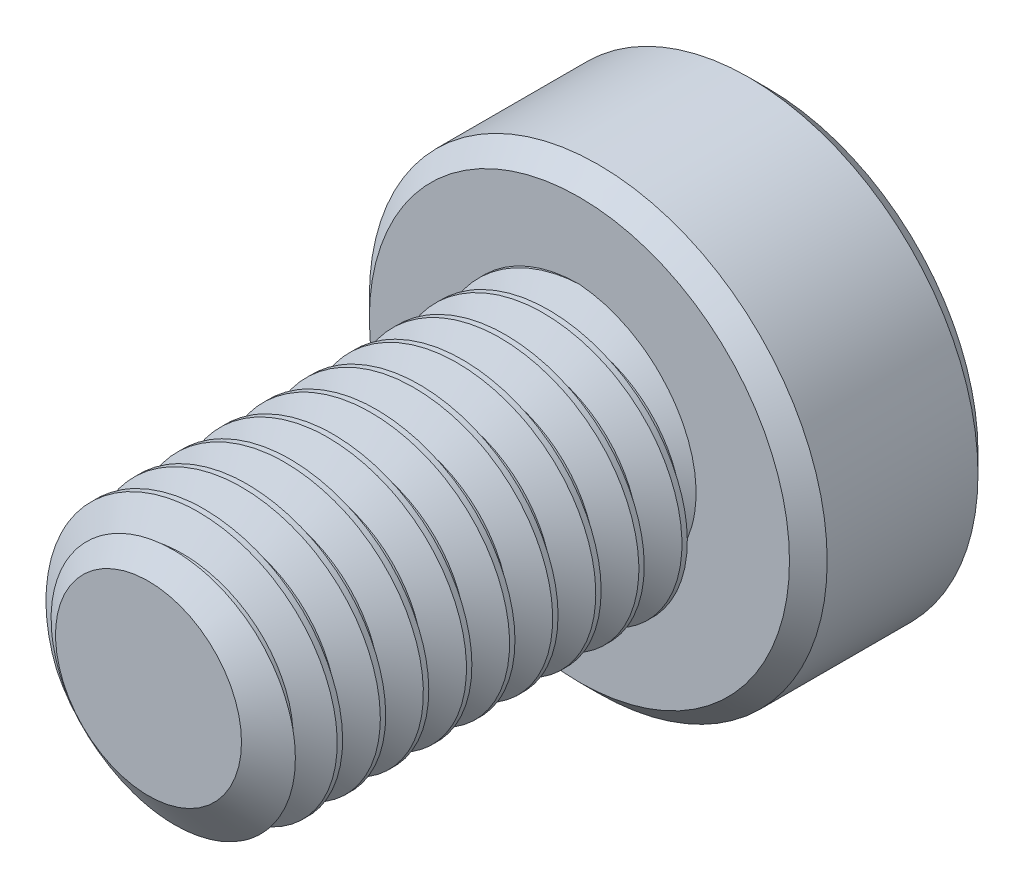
ISO-10303-21;
HEADER;
FILE_DESCRIPTION(('STEP AP214'),'2;1');
FILE_NAME('part.step','',(''),(''),'','','');
FILE_SCHEMA(('AUTOMOTIVE_DESIGN { 1 0 10303 214 1 1 1 1 }'));
ENDSEC;
DATA;
#1=APPLICATION_CONTEXT('core data for automotive mechanical design processes');
#2=APPLICATION_PROTOCOL_DEFINITION('international standard','automotive_design',2000,#1);
#3=PRODUCT_CONTEXT('',#1,'mechanical');
#4=PRODUCT('Part','Part','',(#3));
#5=PRODUCT_RELATED_PRODUCT_CATEGORY('part','',(#4));
#6=PRODUCT_DEFINITION_FORMATION('','',#4);
#7=PRODUCT_DEFINITION_CONTEXT('part definition',#1,'design');
#8=PRODUCT_DEFINITION('design','',#6,#7);
#9=PRODUCT_DEFINITION_SHAPE('','',#8);
#10=(LENGTH_UNIT() NAMED_UNIT(*) SI_UNIT(.MILLI.,.METRE.));
#11=(NAMED_UNIT(*) PLANE_ANGLE_UNIT() SI_UNIT($,.RADIAN.));
#12=(NAMED_UNIT(*) SI_UNIT($,.STERADIAN.) SOLID_ANGLE_UNIT());
#13=UNCERTAINTY_MEASURE_WITH_UNIT(LENGTH_MEASURE(1.E-05),#10,'distance_accuracy_value','');
#14=(GEOMETRIC_REPRESENTATION_CONTEXT(3) GLOBAL_UNCERTAINTY_ASSIGNED_CONTEXT((#13)) GLOBAL_UNIT_ASSIGNED_CONTEXT((#10,
#11,#12)) REPRESENTATION_CONTEXT('',''));
#15=CARTESIAN_POINT('',(0.,0.,0.));
#16=DIRECTION('',(0.,0.,1.));
#17=DIRECTION('',(1.,0.,0.));
#18=AXIS2_PLACEMENT_3D('',#15,#16,#17);
#19=CARTESIAN_POINT('',(0.,0.,-8.));
#20=DIRECTION('',(0.,0.,1.));
#21=DIRECTION('',(1.,0.,0.));
#22=AXIS2_PLACEMENT_3D('',#19,#20,#21);
#23=CYLINDRICAL_SURFACE('',#22,2.5);
#24=CARTESIAN_POINT('',(0.,2.5,1.5));
#25=CARTESIAN_POINT('',(1.44337567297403,2.50000000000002,1.43333333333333));
#26=CARTESIAN_POINT('',(2.16506350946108,1.25000000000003,1.36666666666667));
#27=CARTESIAN_POINT('',(2.88675134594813,0.,1.3));
#28=CARTESIAN_POINT('',(2.16506350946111,-1.24999999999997,1.23333333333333));
#29=CARTESIAN_POINT('',(1.4433756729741,-2.49999999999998,1.16666666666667));
#30=CARTESIAN_POINT('',(0.,-2.5,1.1));
#31=CARTESIAN_POINT('',(-1.44337567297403,-2.50000000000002,1.03333333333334));
#32=CARTESIAN_POINT('',(-2.16506350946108,-1.25000000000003,0.966666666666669));
#33=CARTESIAN_POINT('',(-2.88675134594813,0.,0.900000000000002));
#34=CARTESIAN_POINT('',(-2.16506350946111,1.24999999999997,0.833333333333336));
#35=CARTESIAN_POINT('',(-1.4433756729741,2.49999999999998,0.766666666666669));
#36=CARTESIAN_POINT('',(0.,2.5,0.700000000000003));
#37=CARTESIAN_POINT('',(1.44337567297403,2.50000000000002,0.633333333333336));
#38=CARTESIAN_POINT('',(2.16506350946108,1.25000000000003,0.56666666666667));
#39=CARTESIAN_POINT('',(2.88675134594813,0.,0.500000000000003));
#40=CARTESIAN_POINT('',(2.16506350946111,-1.24999999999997,0.433333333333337));
#41=CARTESIAN_POINT('',(1.4433756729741,-2.49999999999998,0.36666666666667));
#42=CARTESIAN_POINT('',(0.,-2.5,0.300000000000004));
#43=CARTESIAN_POINT('',(-1.44337567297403,-2.50000000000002,0.233333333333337));
#44=CARTESIAN_POINT('',(-2.16506350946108,-1.25000000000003,0.16666666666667));
#45=CARTESIAN_POINT('',(-2.88675134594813,0.,0.100000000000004));
#46=CARTESIAN_POINT('',(-2.16506350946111,1.24999999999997,0.0333333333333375));
#47=CARTESIAN_POINT('',(-1.4433756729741,2.49999999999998,-0.033333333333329));
#48=CARTESIAN_POINT('',(0.,2.5,-0.0999999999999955));
#49=CARTESIAN_POINT('',(1.44337567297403,2.50000000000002,-0.166666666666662));
#50=CARTESIAN_POINT('',(2.16506350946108,1.25000000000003,-0.233333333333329));
#51=CARTESIAN_POINT('',(2.88675134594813,0.,-0.299999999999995));
#52=CARTESIAN_POINT('',(2.16506350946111,-1.24999999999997,-0.366666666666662));
#53=CARTESIAN_POINT('',(1.4433756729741,-2.49999999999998,-0.433333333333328));
#54=CARTESIAN_POINT('',(0.,-2.5,-0.499999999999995));
#55=CARTESIAN_POINT('',(-1.44337567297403,-2.50000000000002,-0.566666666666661));
#56=CARTESIAN_POINT('',(-2.16506350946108,-1.25000000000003,-0.633333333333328));
#57=CARTESIAN_POINT('',(-2.88675134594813,0.,-0.699999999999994));
#58=CARTESIAN_POINT('',(-2.16506350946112,1.24999999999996,-0.766666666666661));
#59=CARTESIAN_POINT('',(-1.44337567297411,2.49999999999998,-0.833333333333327));
#60=CARTESIAN_POINT('',(0.,2.5,-0.899999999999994));
#61=CARTESIAN_POINT('',(1.44337567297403,2.50000000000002,-0.96666666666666));
#62=CARTESIAN_POINT('',(2.16506350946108,1.25000000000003,-1.03333333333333));
#63=CARTESIAN_POINT('',(2.88675134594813,0.,-1.09999999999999));
#64=CARTESIAN_POINT('',(2.16506350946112,-1.24999999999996,-1.16666666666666));
#65=CARTESIAN_POINT('',(1.44337567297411,-2.49999999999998,-1.23333333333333));
#66=CARTESIAN_POINT('',(0.,-2.5,-1.29999999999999));
#67=CARTESIAN_POINT('',(-1.44337567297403,-2.50000000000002,-1.36666666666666));
#68=CARTESIAN_POINT('',(-2.16506350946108,-1.25000000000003,-1.43333333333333));
#69=CARTESIAN_POINT('',(-2.88675134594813,0.,-1.49999999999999));
#70=CARTESIAN_POINT('',(-2.16506350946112,1.24999999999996,-1.56666666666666));
#71=CARTESIAN_POINT('',(-1.44337567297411,2.49999999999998,-1.63333333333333));
#72=CARTESIAN_POINT('',(0.,2.5,-1.69999999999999));
#73=CARTESIAN_POINT('',(1.44337567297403,2.50000000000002,-1.76666666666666));
#74=CARTESIAN_POINT('',(2.16506350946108,1.25000000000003,-1.83333333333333));
#75=CARTESIAN_POINT('',(2.88675134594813,0.,-1.89999999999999));
#76=CARTESIAN_POINT('',(2.16506350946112,-1.24999999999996,-1.96666666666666));
#77=CARTESIAN_POINT('',(1.44337567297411,-2.49999999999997,-2.03333333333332));
#78=CARTESIAN_POINT('',(0.,-2.5,-2.09999999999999));
#79=CARTESIAN_POINT('',(-1.44337567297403,-2.50000000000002,-2.16666666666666));
#80=CARTESIAN_POINT('',(-2.16506350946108,-1.25000000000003,-2.23333333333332));
#81=CARTESIAN_POINT('',(-2.88675134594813,0.,-2.29999999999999));
#82=CARTESIAN_POINT('',(-2.16506350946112,1.24999999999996,-2.36666666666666));
#83=CARTESIAN_POINT('',(-1.44337567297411,2.49999999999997,-2.43333333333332));
#84=CARTESIAN_POINT('',(0.,2.5,-2.49999999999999));
#85=CARTESIAN_POINT('',(1.44337567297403,2.50000000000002,-2.56666666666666));
#86=CARTESIAN_POINT('',(2.16506350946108,1.25000000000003,-2.63333333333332));
#87=CARTESIAN_POINT('',(2.88675134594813,0.,-2.69999999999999));
#88=CARTESIAN_POINT('',(2.16506350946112,-1.24999999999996,-2.76666666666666));
#89=CARTESIAN_POINT('',(1.4433756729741,-2.49999999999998,-2.83333333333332));
#90=CARTESIAN_POINT('',(0.,-2.5,-2.89999999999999));
#91=CARTESIAN_POINT('',(-1.44337567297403,-2.50000000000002,-2.96666666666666));
#92=CARTESIAN_POINT('',(-2.16506350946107,-1.25000000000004,-3.03333333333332));
#93=CARTESIAN_POINT('',(-2.88675134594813,0.,-3.09999999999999));
#94=CARTESIAN_POINT('',(-2.16506350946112,1.24999999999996,-3.16666666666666));
#95=CARTESIAN_POINT('',(-1.44337567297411,2.49999999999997,-3.23333333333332));
#96=CARTESIAN_POINT('',(0.,2.5,-3.29999999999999));
#97=CARTESIAN_POINT('',(1.44337567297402,2.50000000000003,-3.36666666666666));
#98=CARTESIAN_POINT('',(2.16506350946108,1.25000000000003,-3.43333333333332));
#99=CARTESIAN_POINT('',(2.88675134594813,0.,-3.49999999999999));
#100=CARTESIAN_POINT('',(2.16506350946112,-1.24999999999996,-3.56666666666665));
#101=CARTESIAN_POINT('',(1.4433756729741,-2.49999999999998,-3.63333333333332));
#102=CARTESIAN_POINT('',(0.,-2.5,-3.69999999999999));
#103=CARTESIAN_POINT('',(-1.44337567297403,-2.50000000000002,-3.76666666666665));
#104=CARTESIAN_POINT('',(-2.16506350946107,-1.25000000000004,-3.83333333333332));
#105=CARTESIAN_POINT('',(-2.88675134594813,0.,-3.89999999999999));
#106=CARTESIAN_POINT('',(-2.16506350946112,1.24999999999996,-3.96666666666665));
#107=CARTESIAN_POINT('',(-1.44337567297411,2.49999999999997,-4.03333333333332));
#108=CARTESIAN_POINT('',(0.,2.5,-4.09999999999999));
#109=CARTESIAN_POINT('',(1.44337567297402,2.50000000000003,-4.16666666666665));
#110=CARTESIAN_POINT('',(2.16506350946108,1.25000000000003,-4.23333333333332));
#111=CARTESIAN_POINT('',(2.88675134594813,0.,-4.29999999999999));
#112=CARTESIAN_POINT('',(2.16506350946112,-1.24999999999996,-4.36666666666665));
#113=CARTESIAN_POINT('',(1.44337567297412,-2.49999999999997,-4.43333333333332));
#114=CARTESIAN_POINT('',(0.,-2.5,-4.49999999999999));
#115=CARTESIAN_POINT('',(-1.44337567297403,-2.50000000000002,-4.56666666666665));
#116=CARTESIAN_POINT('',(-2.16506350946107,-1.25000000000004,-4.63333333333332));
#117=CARTESIAN_POINT('',(-2.88675134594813,0.,-4.69999999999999));
#118=CARTESIAN_POINT('',(-2.16506350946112,1.24999999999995,-4.76666666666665));
#119=CARTESIAN_POINT('',(-1.44337567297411,2.49999999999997,-4.83333333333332));
#120=CARTESIAN_POINT('',(0.,2.5,-4.89999999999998));
#121=CARTESIAN_POINT('',(1.44337567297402,2.50000000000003,-4.96666666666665));
#122=CARTESIAN_POINT('',(2.16506350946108,1.25000000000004,-5.03333333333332));
#123=CARTESIAN_POINT('',(2.88675134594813,0.,-5.09999999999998));
#124=CARTESIAN_POINT('',(2.16506350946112,-1.24999999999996,-5.16666666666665));
#125=CARTESIAN_POINT('',(1.44337567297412,-2.49999999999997,-5.23333333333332));
#126=CARTESIAN_POINT('',(0.,-2.5,-5.29999999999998));
#127=CARTESIAN_POINT('',(-1.44337567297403,-2.50000000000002,-5.36666666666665));
#128=CARTESIAN_POINT('',(-2.16506350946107,-1.25000000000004,-5.43333333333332));
#129=CARTESIAN_POINT('',(-2.88675134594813,0.,-5.49999999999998));
#130=CARTESIAN_POINT('',(-2.16506350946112,1.24999999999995,-5.56666666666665));
#131=CARTESIAN_POINT('',(-1.44337567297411,2.49999999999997,-5.63333333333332));
#132=CARTESIAN_POINT('',(0.,2.5,-5.69999999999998));
#133=CARTESIAN_POINT('',(1.44337567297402,2.50000000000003,-5.76666666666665));
#134=CARTESIAN_POINT('',(2.16506350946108,1.25000000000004,-5.83333333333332));
#135=CARTESIAN_POINT('',(2.88675134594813,0.,-5.89999999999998));
#136=CARTESIAN_POINT('',(2.16506350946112,-1.24999999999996,-5.96666666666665));
#137=CARTESIAN_POINT('',(1.44337567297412,-2.49999999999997,-6.03333333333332));
#138=CARTESIAN_POINT('',(0.,-2.5,-6.09999999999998));
#139=CARTESIAN_POINT('',(-1.44337567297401,-2.50000000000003,-6.16666666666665));
#140=CARTESIAN_POINT('',(-2.16506350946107,-1.25000000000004,-6.23333333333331));
#141=CARTESIAN_POINT('',(-2.88675134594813,0.,-6.29999999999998));
#142=CARTESIAN_POINT('',(-2.16506350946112,1.24999999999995,-6.36666666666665));
#143=CARTESIAN_POINT('',(-1.44337567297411,2.49999999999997,-6.43333333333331));
#144=CARTESIAN_POINT('',(0.,2.5,-6.49999999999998));
#145=CARTESIAN_POINT('',(1.44337567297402,2.50000000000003,-6.56666666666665));
#146=CARTESIAN_POINT('',(2.16506350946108,1.25000000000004,-6.63333333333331));
#147=CARTESIAN_POINT('',(2.88675134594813,0.,-6.69999999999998));
#148=CARTESIAN_POINT('',(2.16506350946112,-1.24999999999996,-6.76666666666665));
#149=CARTESIAN_POINT('',(1.4433756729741,-2.49999999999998,-6.83333333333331));
#150=CARTESIAN_POINT('',(0.,-2.5,-6.89999999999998));
#151=CARTESIAN_POINT('',(-1.44337567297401,-2.50000000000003,-6.96666666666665));
#152=CARTESIAN_POINT('',(-2.16506350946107,-1.25000000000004,-7.03333333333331));
#153=CARTESIAN_POINT('',(-2.88675134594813,0.,-7.09999999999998));
#154=CARTESIAN_POINT('',(-2.16506350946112,1.24999999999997,-7.16666666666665));
#155=CARTESIAN_POINT('',(-1.44337567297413,2.49999999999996,-7.23333333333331));
#156=CARTESIAN_POINT('',(0.,2.5,-7.29999999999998));
#157=CARTESIAN_POINT('',(1.44337567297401,2.50000000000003,-7.36666666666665));
#158=CARTESIAN_POINT('',(2.16506350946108,1.25000000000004,-7.43333333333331));
#159=CARTESIAN_POINT('',(2.88675134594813,0.,-7.49999999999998));
#160=CARTESIAN_POINT('',(2.16506350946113,-1.24999999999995,-7.56666666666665));
#161=CARTESIAN_POINT('',(1.44337567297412,-2.49999999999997,-7.63333333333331));
#162=CARTESIAN_POINT('',(0.,-2.5,-7.69999999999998));
#163=CARTESIAN_POINT('',(-1.44337567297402,-2.50000000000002,-7.76666666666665));
#164=CARTESIAN_POINT('',(-2.16506350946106,-1.25000000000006,-7.83333333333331));
#165=CARTESIAN_POINT('',(-2.88675134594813,0.,-7.89999999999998));
#166=CARTESIAN_POINT('',(-2.16506350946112,1.24999999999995,-7.96666666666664));
#167=CARTESIAN_POINT('',(-1.44337567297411,2.49999999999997,-8.03333333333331));
#168=CARTESIAN_POINT('',(0.,2.5,-8.09999999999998));
#169=CARTESIAN_POINT('',(1.443375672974,2.50000000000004,-8.16666666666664));
#170=CARTESIAN_POINT('',(2.16506350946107,1.25000000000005,-8.23333333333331));
#171=CARTESIAN_POINT('',(2.88675134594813,0.,-8.29999999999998));
#172=CARTESIAN_POINT('',(2.16506350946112,-1.24999999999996,-8.36666666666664));
#173=CARTESIAN_POINT('',(1.4433756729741,-2.49999999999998,-8.43333333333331));
#174=CARTESIAN_POINT('',(0.,-2.5,-8.49999999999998));
#175=CARTESIAN_POINT('',(-1.443375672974,-2.50000000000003,-8.56666666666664));
#176=CARTESIAN_POINT('',(-2.16506350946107,-1.25000000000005,-8.63333333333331));
#177=CARTESIAN_POINT('',(-2.88675134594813,0.,-8.69999999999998));
#178=CARTESIAN_POINT('',(-2.16506350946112,1.24999999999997,-8.76666666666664));
#179=CARTESIAN_POINT('',(-1.44337567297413,2.49999999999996,-8.83333333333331));
#180=CARTESIAN_POINT('',(0.,2.5,-8.89999999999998));
#181=(BOUNDED_CURVE() B_SPLINE_CURVE(2,(#24,#25,#26,#27,#28,#29,#30,#31,#32,#33,#34,#35,#36,#37,
#38,#39,#40,#41,#42,#43,#44,#45,#46,#47,#48,#49,#50,#51,#52,#53,#54,#55,#56,#57,#58,#59,#60,#61,
#62,#63,#64,#65,#66,#67,#68,#69,#70,#71,#72,#73,#74,#75,#76,#77,#78,#79,#80,#81,#82,#83,#84,#85,
#86,#87,#88,#89,#90,#91,#92,#93,#94,#95,#96,#97,#98,#99,#100,#101,#102,#103,#104,#105,#106,#107,
#108,#109,#110,#111,#112,#113,#114,#115,#116,#117,#118,#119,#120,#121,#122,#123,#124,#125,#126,
#127,#128,#129,#130,#131,#132,#133,#134,#135,#136,#137,#138,#139,#140,#141,#142,#143,#144,#145,
#146,#147,#148,#149,#150,#151,#152,#153,#154,#155,#156,#157,#158,#159,#160,#161,#162,#163,#164,
#165,#166,#167,#168,#169,#170,#171,#172,#173,#174,#175,#176,#177,#178,#179,#180),.UNSPECIFIED.,
.F.,.F.) B_SPLINE_CURVE_WITH_KNOTS((3,2,2,2,2,2,2,2,2,2,2,2,2,2,2,2,2,2,2,2,2,2,2,2,2,2,2,2,2,2,
2,2,2,2,2,2,2,2,2,2,2,2,2,2,2,2,2,2,2,2,2,2,2,2,2,2,2,2,2,2,2,2,2,2,2,2,2,2,2,2,2,2,2,2,2,2,2,2,
3),(0.,0.0128205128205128,0.0256410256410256,0.0384615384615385,0.0512820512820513,
0.0641025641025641,0.0769230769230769,0.0897435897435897,0.102564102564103,0.115384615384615,
0.128205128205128,0.141025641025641,0.153846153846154,0.166666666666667,0.179487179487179,
0.192307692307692,0.205128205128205,0.217948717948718,0.230769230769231,0.243589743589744,
0.256410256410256,0.269230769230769,0.282051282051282,0.294871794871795,0.307692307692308,
0.32051282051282,0.333333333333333,0.346153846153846,0.358974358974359,0.371794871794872,
0.384615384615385,0.397435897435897,0.41025641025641,0.423076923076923,0.435897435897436,
0.448717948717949,0.461538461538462,0.474358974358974,0.487179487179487,0.5,0.512820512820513,
0.525641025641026,0.538461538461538,0.551282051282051,0.564102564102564,0.576923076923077,
0.58974358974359,0.602564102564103,0.615384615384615,0.628205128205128,0.641025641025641,
0.653846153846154,0.666666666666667,0.67948717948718,0.692307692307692,0.705128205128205,
0.717948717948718,0.730769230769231,0.743589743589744,0.756410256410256,0.769230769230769,
0.782051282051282,0.794871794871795,0.807692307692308,0.82051282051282,0.833333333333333,
0.846153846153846,0.858974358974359,0.871794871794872,0.884615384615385,0.897435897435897,
0.91025641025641,0.923076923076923,0.935897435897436,0.948717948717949,0.961538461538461,
0.974358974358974,0.987179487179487,1.),
.UNSPECIFIED.) CURVE() GEOMETRIC_REPRESENTATION_ITEM() RATIONAL_B_SPLINE_CURVE((1.,
0.866025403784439,1.,0.866025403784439,1.,0.866025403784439,1.,0.866025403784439,1.,
0.866025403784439,1.,0.866025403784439,1.,0.866025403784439,1.,0.866025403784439,1.,
0.866025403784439,1.,0.866025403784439,1.,0.866025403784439,1.,0.866025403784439,1.,
0.866025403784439,1.,0.866025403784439,1.,0.866025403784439,1.,0.866025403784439,1.,
0.866025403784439,1.,0.866025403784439,1.,0.866025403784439,1.,0.866025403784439,1.,
0.866025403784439,1.,0.866025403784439,1.,0.866025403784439,1.,0.866025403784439,1.,
0.866025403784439,1.,0.866025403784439,1.,0.866025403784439,1.,0.866025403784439,1.,
0.866025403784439,1.,0.866025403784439,1.,0.866025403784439,1.,0.866025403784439,1.,
0.866025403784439,1.,0.866025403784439,1.,0.866025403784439,1.,0.866025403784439,1.,
0.866025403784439,1.,0.866025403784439,1.,0.866025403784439,1.,0.866025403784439,1.,
0.866025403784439,1.,0.866025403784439,1.,0.866025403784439,1.,0.866025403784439,1.,
0.866025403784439,1.,0.866025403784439,1.,0.866025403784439,1.,0.866025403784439,1.,
0.866025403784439,1.,0.866025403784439,1.,0.866025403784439,1.,0.866025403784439,1.,
0.866025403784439,1.,0.866025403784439,1.,0.866025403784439,1.,0.866025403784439,1.,
0.866025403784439,1.,0.866025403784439,1.,0.866025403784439,1.,0.866025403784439,1.,
0.866025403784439,1.,0.866025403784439,1.,0.866025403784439,1.,0.866025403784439,1.,
0.866025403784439,1.,0.866025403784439,1.,0.866025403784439,1.,0.866025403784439,1.,
0.866025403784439,1.,0.866025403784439,1.,0.866025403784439,1.,0.866025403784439,1.,
0.866025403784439,1.,0.866025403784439,1.,0.866025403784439,1.,0.866025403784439,1.,
0.866025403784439,1.,0.866025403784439,1.)) REPRESENTATION_ITEM(''));
#182=CARTESIAN_POINT('',(-0.822324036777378,-2.36088610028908,-0.541691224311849));
#183=VERTEX_POINT('',#182);
#184=CARTESIAN_POINT('',(-1.7515731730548,1.78381372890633,-8.));
#185=VERTEX_POINT('',#184);
#186=EDGE_CURVE('E274',#183,#185,#181,.T.);
#187=ORIENTED_EDGE('',*,*,#186,.F.);
#188=CARTESIAN_POINT('',(0.,0.,-0.541691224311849));
#189=DIRECTION('',(0.,0.,1.));
#190=DIRECTION('',(1.,0.,0.));
#191=AXIS2_PLACEMENT_3D('',#188,#189,#190);
#192=CIRCLE('',#191,2.5);
#193=CARTESIAN_POINT('',(-2.24826999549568,-1.09328954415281,-0.541691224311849));
#194=VERTEX_POINT('',#193);
#195=EDGE_CURVE('E267',#194,#183,#192,.T.);
#196=ORIENTED_EDGE('',*,*,#195,.F.);
#197=CARTESIAN_POINT('',(0.,2.5,0.8));
#198=CARTESIAN_POINT('',(1.44337567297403,2.50000000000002,0.733333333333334));
#199=CARTESIAN_POINT('',(2.16506350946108,1.25000000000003,0.666666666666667));
#200=CARTESIAN_POINT('',(2.88675134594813,0.,0.600000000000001));
#201=CARTESIAN_POINT('',(2.16506350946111,-1.24999999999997,0.533333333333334));
#202=CARTESIAN_POINT('',(1.4433756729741,-2.49999999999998,0.466666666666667));
#203=CARTESIAN_POINT('',(0.,-2.5,0.400000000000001));
#204=CARTESIAN_POINT('',(-1.44337567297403,-2.50000000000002,0.333333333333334));
#205=CARTESIAN_POINT('',(-2.16506350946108,-1.25000000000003,0.266666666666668));
#206=CARTESIAN_POINT('',(-2.88675134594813,0.,0.200000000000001));
#207=CARTESIAN_POINT('',(-2.16506350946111,1.24999999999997,0.133333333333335));
#208=CARTESIAN_POINT('',(-1.4433756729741,2.49999999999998,0.0666666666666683));
#209=CARTESIAN_POINT('',(0.,2.5,0.));
#210=CARTESIAN_POINT('',(1.44337567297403,2.50000000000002,-0.0666666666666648));
#211=CARTESIAN_POINT('',(2.16506350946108,1.25000000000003,-0.133333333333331));
#212=CARTESIAN_POINT('',(2.88675134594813,0.,-0.199999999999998));
#213=CARTESIAN_POINT('',(2.16506350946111,-1.24999999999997,-0.266666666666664));
#214=CARTESIAN_POINT('',(1.4433756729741,-2.49999999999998,-0.333333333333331));
#215=CARTESIAN_POINT('',(0.,-2.5,-0.399999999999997));
#216=CARTESIAN_POINT('',(-1.44337567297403,-2.50000000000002,-0.466666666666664));
#217=CARTESIAN_POINT('',(-2.16506350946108,-1.25000000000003,-0.53333333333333));
#218=CARTESIAN_POINT('',(-2.88675134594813,0.,-0.599999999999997));
#219=CARTESIAN_POINT('',(-2.16506350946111,1.24999999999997,-0.666666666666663));
#220=CARTESIAN_POINT('',(-1.4433756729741,2.49999999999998,-0.73333333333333));
#221=CARTESIAN_POINT('',(0.,2.5,-0.799999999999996));
#222=CARTESIAN_POINT('',(1.44337567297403,2.50000000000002,-0.866666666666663));
#223=CARTESIAN_POINT('',(2.16506350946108,1.25000000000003,-0.93333333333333));
#224=CARTESIAN_POINT('',(2.88675134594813,0.,-0.999999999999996));
#225=CARTESIAN_POINT('',(2.16506350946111,-1.24999999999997,-1.06666666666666));
#226=CARTESIAN_POINT('',(1.4433756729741,-2.49999999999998,-1.13333333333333));
#227=CARTESIAN_POINT('',(0.,-2.5,-1.2));
#228=CARTESIAN_POINT('',(-1.44337567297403,-2.50000000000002,-1.26666666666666));
#229=CARTESIAN_POINT('',(-2.16506350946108,-1.25000000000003,-1.33333333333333));
#230=CARTESIAN_POINT('',(-2.88675134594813,0.,-1.4));
#231=CARTESIAN_POINT('',(-2.16506350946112,1.24999999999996,-1.46666666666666));
#232=CARTESIAN_POINT('',(-1.44337567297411,2.49999999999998,-1.53333333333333));
#233=CARTESIAN_POINT('',(0.,2.5,-1.59999999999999));
#234=CARTESIAN_POINT('',(1.44337567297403,2.50000000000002,-1.66666666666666));
#235=CARTESIAN_POINT('',(2.16506350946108,1.25000000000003,-1.73333333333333));
#236=CARTESIAN_POINT('',(2.88675134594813,0.,-1.79999999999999));
#237=CARTESIAN_POINT('',(2.16506350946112,-1.24999999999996,-1.86666666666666));
#238=CARTESIAN_POINT('',(1.44337567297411,-2.49999999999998,-1.93333333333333));
#239=CARTESIAN_POINT('',(0.,-2.5,-1.99999999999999));
#240=CARTESIAN_POINT('',(-1.44337567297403,-2.50000000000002,-2.06666666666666));
#241=CARTESIAN_POINT('',(-2.16506350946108,-1.25000000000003,-2.13333333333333));
#242=CARTESIAN_POINT('',(-2.88675134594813,0.,-2.19999999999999));
#243=CARTESIAN_POINT('',(-2.16506350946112,1.24999999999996,-2.26666666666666));
#244=CARTESIAN_POINT('',(-1.44337567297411,2.49999999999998,-2.33333333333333));
#245=CARTESIAN_POINT('',(0.,2.5,-2.39999999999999));
#246=CARTESIAN_POINT('',(1.44337567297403,2.50000000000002,-2.46666666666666));
#247=CARTESIAN_POINT('',(2.16506350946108,1.25000000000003,-2.53333333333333));
#248=CARTESIAN_POINT('',(2.88675134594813,0.,-2.59999999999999));
#249=CARTESIAN_POINT('',(2.16506350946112,-1.24999999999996,-2.66666666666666));
#250=CARTESIAN_POINT('',(1.44337567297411,-2.49999999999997,-2.73333333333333));
#251=CARTESIAN_POINT('',(0.,-2.5,-2.79999999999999));
#252=CARTESIAN_POINT('',(-1.44337567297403,-2.50000000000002,-2.86666666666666));
#253=CARTESIAN_POINT('',(-2.16506350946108,-1.25000000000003,-2.93333333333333));
#254=CARTESIAN_POINT('',(-2.88675134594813,0.,-2.99999999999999));
#255=CARTESIAN_POINT('',(-2.16506350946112,1.24999999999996,-3.06666666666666));
#256=CARTESIAN_POINT('',(-1.44337567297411,2.49999999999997,-3.13333333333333));
#257=CARTESIAN_POINT('',(0.,2.5,-3.19999999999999));
#258=CARTESIAN_POINT('',(1.44337567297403,2.50000000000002,-3.26666666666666));
#259=CARTESIAN_POINT('',(2.16506350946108,1.25000000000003,-3.33333333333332));
#260=CARTESIAN_POINT('',(2.88675134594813,0.,-3.39999999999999));
#261=CARTESIAN_POINT('',(2.16506350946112,-1.24999999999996,-3.46666666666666));
#262=CARTESIAN_POINT('',(1.4433756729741,-2.49999999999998,-3.53333333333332));
#263=CARTESIAN_POINT('',(0.,-2.5,-3.59999999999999));
#264=CARTESIAN_POINT('',(-1.44337567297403,-2.50000000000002,-3.66666666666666));
#265=CARTESIAN_POINT('',(-2.16506350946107,-1.25000000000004,-3.73333333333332));
#266=CARTESIAN_POINT('',(-2.88675134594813,0.,-3.79999999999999));
#267=CARTESIAN_POINT('',(-2.16506350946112,1.24999999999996,-3.86666666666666));
#268=CARTESIAN_POINT('',(-1.44337567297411,2.49999999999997,-3.93333333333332));
#269=CARTESIAN_POINT('',(0.,2.5,-3.99999999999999));
#270=CARTESIAN_POINT('',(1.44337567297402,2.50000000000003,-4.06666666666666));
#271=CARTESIAN_POINT('',(2.16506350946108,1.25000000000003,-4.13333333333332));
#272=CARTESIAN_POINT('',(2.88675134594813,0.,-4.19999999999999));
#273=CARTESIAN_POINT('',(2.16506350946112,-1.24999999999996,-4.26666666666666));
#274=CARTESIAN_POINT('',(1.4433756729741,-2.49999999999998,-4.33333333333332));
#275=CARTESIAN_POINT('',(0.,-2.5,-4.39999999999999));
#276=CARTESIAN_POINT('',(-1.44337567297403,-2.50000000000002,-4.46666666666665));
#277=CARTESIAN_POINT('',(-2.16506350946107,-1.25000000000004,-4.53333333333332));
#278=CARTESIAN_POINT('',(-2.88675134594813,0.,-4.59999999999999));
#279=CARTESIAN_POINT('',(-2.16506350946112,1.24999999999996,-4.66666666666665));
#280=CARTESIAN_POINT('',(-1.44337567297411,2.49999999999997,-4.73333333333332));
#281=CARTESIAN_POINT('',(0.,2.5,-4.79999999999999));
#282=CARTESIAN_POINT('',(1.44337567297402,2.50000000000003,-4.86666666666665));
#283=CARTESIAN_POINT('',(2.16506350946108,1.25000000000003,-4.93333333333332));
#284=CARTESIAN_POINT('',(2.88675134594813,0.,-4.99999999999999));
#285=CARTESIAN_POINT('',(2.16506350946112,-1.24999999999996,-5.06666666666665));
#286=CARTESIAN_POINT('',(1.44337567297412,-2.49999999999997,-5.13333333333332));
#287=CARTESIAN_POINT('',(0.,-2.5,-5.19999999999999));
#288=CARTESIAN_POINT('',(-1.44337567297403,-2.50000000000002,-5.26666666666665));
#289=CARTESIAN_POINT('',(-2.16506350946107,-1.25000000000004,-5.33333333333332));
#290=CARTESIAN_POINT('',(-2.88675134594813,0.,-5.39999999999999));
#291=CARTESIAN_POINT('',(-2.16506350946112,1.24999999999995,-5.46666666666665));
#292=CARTESIAN_POINT('',(-1.44337567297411,2.49999999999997,-5.53333333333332));
#293=CARTESIAN_POINT('',(0.,2.5,-5.59999999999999));
#294=CARTESIAN_POINT('',(1.44337567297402,2.50000000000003,-5.66666666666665));
#295=CARTESIAN_POINT('',(2.16506350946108,1.25000000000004,-5.73333333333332));
#296=CARTESIAN_POINT('',(2.88675134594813,0.,-5.79999999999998));
#297=CARTESIAN_POINT('',(2.16506350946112,-1.24999999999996,-5.86666666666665));
#298=CARTESIAN_POINT('',(1.44337567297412,-2.49999999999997,-5.93333333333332));
#299=CARTESIAN_POINT('',(0.,-2.5,-5.99999999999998));
#300=CARTESIAN_POINT('',(-1.44337567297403,-2.50000000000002,-6.06666666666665));
#301=CARTESIAN_POINT('',(-2.16506350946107,-1.25000000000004,-6.13333333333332));
#302=CARTESIAN_POINT('',(-2.88675134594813,0.,-6.19999999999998));
#303=CARTESIAN_POINT('',(-2.16506350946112,1.24999999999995,-6.26666666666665));
#304=CARTESIAN_POINT('',(-1.44337567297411,2.49999999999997,-6.33333333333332));
#305=CARTESIAN_POINT('',(0.,2.5,-6.39999999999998));
#306=CARTESIAN_POINT('',(1.44337567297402,2.50000000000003,-6.46666666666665));
#307=CARTESIAN_POINT('',(2.16506350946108,1.25000000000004,-6.53333333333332));
#308=CARTESIAN_POINT('',(2.88675134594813,0.,-6.59999999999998));
#309=CARTESIAN_POINT('',(2.16506350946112,-1.24999999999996,-6.66666666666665));
#310=CARTESIAN_POINT('',(1.44337567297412,-2.49999999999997,-6.73333333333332));
#311=CARTESIAN_POINT('',(0.,-2.5,-6.79999999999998));
#312=CARTESIAN_POINT('',(-1.44337567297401,-2.50000000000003,-6.86666666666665));
#313=CARTESIAN_POINT('',(-2.16506350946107,-1.25000000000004,-6.93333333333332));
#314=CARTESIAN_POINT('',(-2.88675134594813,0.,-6.99999999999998));
#315=CARTESIAN_POINT('',(-2.16506350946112,1.24999999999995,-7.06666666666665));
#316=CARTESIAN_POINT('',(-1.44337567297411,2.49999999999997,-7.13333333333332));
#317=CARTESIAN_POINT('',(0.,2.5,-7.19999999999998));
#318=CARTESIAN_POINT('',(1.44337567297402,2.50000000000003,-7.26666666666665));
#319=CARTESIAN_POINT('',(2.16506350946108,1.25000000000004,-7.33333333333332));
#320=CARTESIAN_POINT('',(2.88675134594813,0.,-7.39999999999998));
#321=CARTESIAN_POINT('',(2.16506350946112,-1.24999999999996,-7.46666666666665));
#322=CARTESIAN_POINT('',(1.4433756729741,-2.49999999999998,-7.53333333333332));
#323=CARTESIAN_POINT('',(0.,-2.5,-7.59999999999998));
#324=CARTESIAN_POINT('',(-1.44337567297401,-2.50000000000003,-7.66666666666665));
#325=CARTESIAN_POINT('',(-2.16506350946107,-1.25000000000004,-7.73333333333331));
#326=CARTESIAN_POINT('',(-2.88675134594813,0.,-7.79999999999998));
#327=CARTESIAN_POINT('',(-2.16506350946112,1.24999999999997,-7.86666666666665));
#328=CARTESIAN_POINT('',(-1.44337567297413,2.49999999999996,-7.93333333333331));
#329=CARTESIAN_POINT('',(0.,2.5,-7.99999999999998));
#330=CARTESIAN_POINT('',(1.44337567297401,2.50000000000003,-8.06666666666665));
#331=CARTESIAN_POINT('',(2.16506350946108,1.25000000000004,-8.13333333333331));
#332=CARTESIAN_POINT('',(2.88675134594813,0.,-8.19999999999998));
#333=CARTESIAN_POINT('',(2.16506350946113,-1.24999999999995,-8.26666666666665));
#334=CARTESIAN_POINT('',(1.44337567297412,-2.49999999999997,-8.33333333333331));
#335=CARTESIAN_POINT('',(0.,-2.5,-8.39999999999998));
#336=CARTESIAN_POINT('',(-1.44337567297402,-2.50000000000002,-8.46666666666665));
#337=CARTESIAN_POINT('',(-2.16506350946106,-1.25000000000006,-8.53333333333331));
#338=CARTESIAN_POINT('',(-2.88675134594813,0.,-8.59999999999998));
#339=CARTESIAN_POINT('',(-2.16506350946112,1.24999999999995,-8.66666666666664));
#340=CARTESIAN_POINT('',(-1.44337567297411,2.49999999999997,-8.73333333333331));
#341=CARTESIAN_POINT('',(0.,2.5,-8.79999999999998));
#342=CARTESIAN_POINT('',(1.443375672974,2.50000000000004,-8.86666666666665));
#343=CARTESIAN_POINT('',(2.16506350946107,1.25000000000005,-8.93333333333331));
#344=CARTESIAN_POINT('',(2.88675134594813,0.,-8.99999999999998));
#345=CARTESIAN_POINT('',(2.16506350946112,-1.24999999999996,-9.06666666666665));
#346=CARTESIAN_POINT('',(1.4433756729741,-2.49999999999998,-9.13333333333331));
#347=CARTESIAN_POINT('',(0.,-2.5,-9.19999999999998));
#348=CARTESIAN_POINT('',(-1.443375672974,-2.50000000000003,-9.26666666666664));
#349=CARTESIAN_POINT('',(-2.16506350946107,-1.25000000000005,-9.33333333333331));
#350=CARTESIAN_POINT('',(-2.88675134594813,0.,-9.39999999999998));
#351=CARTESIAN_POINT('',(-2.16506350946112,1.24999999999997,-9.46666666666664));
#352=CARTESIAN_POINT('',(-1.44337567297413,2.49999999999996,-9.53333333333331));
#353=CARTESIAN_POINT('',(0.,2.5,-9.59999999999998));
#354=(BOUNDED_CURVE() B_SPLINE_CURVE(2,(#197,#198,#199,#200,#201,#202,#203,#204,#205,#206,#207,
#208,#209,#210,#211,#212,#213,#214,#215,#216,#217,#218,#219,#220,#221,#222,#223,#224,#225,#226,
#227,#228,#229,#230,#231,#232,#233,#234,#235,#236,#237,#238,#239,#240,#241,#242,#243,#244,#245,
#246,#247,#248,#249,#250,#251,#252,#253,#254,#255,#256,#257,#258,#259,#260,#261,#262,#263,#264,
#265,#266,#267,#268,#269,#270,#271,#272,#273,#274,#275,#276,#277,#278,#279,#280,#281,#282,#283,
#284,#285,#286,#287,#288,#289,#290,#291,#292,#293,#294,#295,#296,#297,#298,#299,#300,#301,#302,
#303,#304,#305,#306,#307,#308,#309,#310,#311,#312,#313,#314,#315,#316,#317,#318,#319,#320,#321,
#322,#323,#324,#325,#326,#327,#328,#329,#330,#331,#332,#333,#334,#335,#336,#337,#338,#339,#340,
#341,#342,#343,#344,#345,#346,#347,#348,#349,#350,#351,#352,#353),.UNSPECIFIED.,.F.,
.F.) B_SPLINE_CURVE_WITH_KNOTS((3,2,2,2,2,2,2,2,2,2,2,2,2,2,2,2,2,2,2,2,2,2,2,2,2,2,2,2,2,2,2,2,
2,2,2,2,2,2,2,2,2,2,2,2,2,2,2,2,2,2,2,2,2,2,2,2,2,2,2,2,2,2,2,2,2,2,2,2,2,2,2,2,2,2,2,2,2,2,3),
(0.,0.0128205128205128,0.0256410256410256,0.0384615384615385,0.0512820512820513,
0.0641025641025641,0.0769230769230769,0.0897435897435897,0.102564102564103,0.115384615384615,
0.128205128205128,0.141025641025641,0.153846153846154,0.166666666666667,0.179487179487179,
0.192307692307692,0.205128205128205,0.217948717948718,0.230769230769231,0.243589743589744,
0.256410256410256,0.269230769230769,0.282051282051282,0.294871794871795,0.307692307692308,
0.32051282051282,0.333333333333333,0.346153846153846,0.358974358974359,0.371794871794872,
0.384615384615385,0.397435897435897,0.41025641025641,0.423076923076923,0.435897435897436,
0.448717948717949,0.461538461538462,0.474358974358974,0.487179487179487,0.5,0.512820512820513,
0.525641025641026,0.538461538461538,0.551282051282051,0.564102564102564,0.576923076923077,
0.58974358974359,0.602564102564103,0.615384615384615,0.628205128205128,0.641025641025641,
0.653846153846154,0.666666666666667,0.67948717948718,0.692307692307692,0.705128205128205,
0.717948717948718,0.730769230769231,0.743589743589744,0.756410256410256,0.769230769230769,
0.782051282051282,0.794871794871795,0.807692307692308,0.82051282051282,0.833333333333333,
0.846153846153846,0.858974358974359,0.871794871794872,0.884615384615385,0.897435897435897,
0.91025641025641,0.923076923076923,0.935897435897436,0.948717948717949,0.961538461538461,
0.974358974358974,0.987179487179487,1.),
.UNSPECIFIED.) CURVE() GEOMETRIC_REPRESENTATION_ITEM() RATIONAL_B_SPLINE_CURVE((1.,
0.866025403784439,1.,0.866025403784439,1.,0.866025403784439,1.,0.866025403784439,1.,
0.866025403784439,1.,0.866025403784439,1.,0.866025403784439,1.,0.866025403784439,1.,
0.866025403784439,1.,0.866025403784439,1.,0.866025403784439,1.,0.866025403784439,1.,
0.866025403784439,1.,0.866025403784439,1.,0.866025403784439,1.,0.866025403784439,1.,
0.866025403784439,1.,0.866025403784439,1.,0.866025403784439,1.,0.866025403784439,1.,
0.866025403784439,1.,0.866025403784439,1.,0.866025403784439,1.,0.866025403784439,1.,
0.866025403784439,1.,0.866025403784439,1.,0.866025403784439,1.,0.866025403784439,1.,
0.866025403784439,1.,0.866025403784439,1.,0.866025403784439,1.,0.866025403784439,1.,
0.866025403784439,1.,0.866025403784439,1.,0.866025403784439,1.,0.866025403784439,1.,
0.866025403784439,1.,0.866025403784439,1.,0.866025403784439,1.,0.866025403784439,1.,
0.866025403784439,1.,0.866025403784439,1.,0.866025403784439,1.,0.866025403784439,1.,
0.866025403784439,1.,0.866025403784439,1.,0.866025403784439,1.,0.866025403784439,1.,
0.866025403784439,1.,0.866025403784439,1.,0.866025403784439,1.,0.866025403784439,1.,
0.866025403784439,1.,0.866025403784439,1.,0.866025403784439,1.,0.866025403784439,1.,
0.866025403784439,1.,0.866025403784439,1.,0.866025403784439,1.,0.866025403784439,1.,
0.866025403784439,1.,0.866025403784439,1.,0.866025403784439,1.,0.866025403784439,1.,
0.866025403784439,1.,0.866025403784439,1.,0.866025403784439,1.,0.866025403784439,1.,
0.866025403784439,1.,0.866025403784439,1.,0.866025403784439,1.,0.866025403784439,1.,
0.866025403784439,1.,0.866025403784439,1.,0.866025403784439,1.,0.866025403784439,1.,
0.866025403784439,1.,0.866025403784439,1.)) REPRESENTATION_ITEM(''));
#355=CARTESIAN_POINT('',(0.,2.5,-7.99999999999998));
#356=VERTEX_POINT('',#355);
#357=EDGE_CURVE('E266',#194,#356,#354,.T.);
#358=ORIENTED_EDGE('',*,*,#357,.T.);
#359=CARTESIAN_POINT('',(0.,0.,-8.));
#360=DIRECTION('',(0.,0.,1.));
#361=DIRECTION('',(1.,0.,0.));
#362=AXIS2_PLACEMENT_3D('',#359,#360,#361);
#363=CIRCLE('',#362,2.5);
#364=EDGE_CURVE('E247',#356,#185,#363,.T.);
#365=ORIENTED_EDGE('',*,*,#364,.T.);
#366=EDGE_LOOP('',(#187,#196,#358,#365));
#367=FACE_BOUND('',#366,.T.);
#368=ADVANCED_FACE('F32',(#367),#23,.T.);
#369=CARTESIAN_POINT('',(0.,2.5,1.5));
#370=CARTESIAN_POINT('',(1.44337567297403,2.50000000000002,1.43333333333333));
#371=CARTESIAN_POINT('',(2.16506350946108,1.25000000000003,1.36666666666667));
#372=CARTESIAN_POINT('',(2.88675134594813,0.,1.3));
#373=CARTESIAN_POINT('',(2.16506350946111,-1.24999999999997,1.23333333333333));
#374=CARTESIAN_POINT('',(1.4433756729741,-2.49999999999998,1.16666666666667));
#375=CARTESIAN_POINT('',(0.,-2.5,1.1));
#376=CARTESIAN_POINT('',(-1.44337567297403,-2.50000000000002,1.03333333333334));
#377=CARTESIAN_POINT('',(-2.16506350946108,-1.25000000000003,0.966666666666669));
#378=CARTESIAN_POINT('',(-2.88675134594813,0.,0.900000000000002));
#379=CARTESIAN_POINT('',(-2.16506350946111,1.24999999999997,0.833333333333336));
#380=CARTESIAN_POINT('',(-1.4433756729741,2.49999999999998,0.766666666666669));
#381=CARTESIAN_POINT('',(0.,2.5,0.700000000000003));
#382=CARTESIAN_POINT('',(1.44337567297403,2.50000000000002,0.633333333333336));
#383=CARTESIAN_POINT('',(2.16506350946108,1.25000000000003,0.56666666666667));
#384=CARTESIAN_POINT('',(2.88675134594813,0.,0.500000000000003));
#385=CARTESIAN_POINT('',(2.16506350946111,-1.24999999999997,0.433333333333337));
#386=CARTESIAN_POINT('',(1.4433756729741,-2.49999999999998,0.36666666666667));
#387=CARTESIAN_POINT('',(0.,-2.5,0.300000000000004));
#388=CARTESIAN_POINT('',(-1.44337567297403,-2.50000000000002,0.233333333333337));
#389=CARTESIAN_POINT('',(-2.16506350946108,-1.25000000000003,0.16666666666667));
#390=CARTESIAN_POINT('',(-2.88675134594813,0.,0.100000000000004));
#391=CARTESIAN_POINT('',(-2.16506350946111,1.24999999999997,0.0333333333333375));
#392=CARTESIAN_POINT('',(-1.4433756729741,2.49999999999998,-0.033333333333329));
#393=CARTESIAN_POINT('',(0.,2.5,-0.0999999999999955));
#394=CARTESIAN_POINT('',(1.44337567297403,2.50000000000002,-0.166666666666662));
#395=CARTESIAN_POINT('',(2.16506350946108,1.25000000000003,-0.233333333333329));
#396=CARTESIAN_POINT('',(2.88675134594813,0.,-0.299999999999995));
#397=CARTESIAN_POINT('',(2.16506350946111,-1.24999999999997,-0.366666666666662));
#398=CARTESIAN_POINT('',(1.4433756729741,-2.49999999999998,-0.433333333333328));
#399=CARTESIAN_POINT('',(0.,-2.5,-0.499999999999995));
#400=CARTESIAN_POINT('',(-1.44337567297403,-2.50000000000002,-0.566666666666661));
#401=CARTESIAN_POINT('',(-2.16506350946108,-1.25000000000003,-0.633333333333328));
#402=CARTESIAN_POINT('',(-2.88675134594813,0.,-0.699999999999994));
#403=CARTESIAN_POINT('',(-2.16506350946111,1.24999999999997,-0.766666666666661));
#404=CARTESIAN_POINT('',(-1.4433756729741,2.49999999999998,-0.833333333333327));
#405=CARTESIAN_POINT('',(0.,2.5,-0.899999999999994));
#406=CARTESIAN_POINT('',(1.44337567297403,2.50000000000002,-0.96666666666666));
#407=CARTESIAN_POINT('',(2.16506350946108,1.25000000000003,-1.03333333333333));
#408=CARTESIAN_POINT('',(2.88675134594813,0.,-1.09999999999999));
#409=CARTESIAN_POINT('',(2.16506350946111,-1.24999999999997,-1.16666666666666));
#410=CARTESIAN_POINT('',(1.4433756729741,-2.49999999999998,-1.23333333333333));
#411=CARTESIAN_POINT('',(0.,-2.5,-1.29999999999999));
#412=CARTESIAN_POINT('',(-1.44337567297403,-2.50000000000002,-1.36666666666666));
#413=CARTESIAN_POINT('',(-2.16506350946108,-1.25000000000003,-1.43333333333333));
#414=CARTESIAN_POINT('',(-2.88675134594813,0.,-1.49999999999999));
#415=CARTESIAN_POINT('',(-2.16506350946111,1.24999999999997,-1.56666666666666));
#416=CARTESIAN_POINT('',(-1.4433756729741,2.49999999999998,-1.63333333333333));
#417=CARTESIAN_POINT('',(0.,2.5,-1.69999999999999));
#418=CARTESIAN_POINT('',(1.44337567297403,2.50000000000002,-1.76666666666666));
#419=CARTESIAN_POINT('',(2.16506350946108,1.25000000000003,-1.83333333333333));
#420=CARTESIAN_POINT('',(2.88675134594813,0.,-1.89999999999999));
#421=CARTESIAN_POINT('',(2.16506350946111,-1.24999999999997,-1.96666666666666));
#422=CARTESIAN_POINT('',(1.4433756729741,-2.49999999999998,-2.03333333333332));
#423=CARTESIAN_POINT('',(0.,-2.5,-2.09999999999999));
#424=CARTESIAN_POINT('',(-1.44337567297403,-2.50000000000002,-2.16666666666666));
#425=CARTESIAN_POINT('',(-2.16506350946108,-1.25000000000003,-2.23333333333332));
#426=CARTESIAN_POINT('',(-2.88675134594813,0.,-2.29999999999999));
#427=CARTESIAN_POINT('',(-2.16506350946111,1.24999999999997,-2.36666666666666));
#428=CARTESIAN_POINT('',(-1.4433756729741,2.49999999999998,-2.43333333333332));
#429=CARTESIAN_POINT('',(0.,2.5,-2.49999999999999));
#430=CARTESIAN_POINT('',(1.44337567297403,2.50000000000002,-2.56666666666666));
#431=CARTESIAN_POINT('',(2.16506350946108,1.25000000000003,-2.63333333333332));
#432=CARTESIAN_POINT('',(2.88675134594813,0.,-2.69999999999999));
#433=CARTESIAN_POINT('',(2.16506350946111,-1.24999999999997,-2.76666666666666));
#434=CARTESIAN_POINT('',(1.4433756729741,-2.49999999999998,-2.83333333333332));
#435=CARTESIAN_POINT('',(0.,-2.5,-2.89999999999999));
#436=CARTESIAN_POINT('',(-1.44337567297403,-2.50000000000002,-2.96666666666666));
#437=CARTESIAN_POINT('',(-2.16506350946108,-1.25000000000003,-3.03333333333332));
#438=CARTESIAN_POINT('',(-2.88675134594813,0.,-3.09999999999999));
#439=CARTESIAN_POINT('',(-2.16506350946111,1.24999999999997,-3.16666666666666));
#440=CARTESIAN_POINT('',(-1.4433756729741,2.49999999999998,-3.23333333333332));
#441=CARTESIAN_POINT('',(0.,2.5,-3.29999999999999));
#442=CARTESIAN_POINT('',(1.44337567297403,2.50000000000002,-3.36666666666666));
#443=CARTESIAN_POINT('',(2.16506350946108,1.25000000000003,-3.43333333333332));
#444=CARTESIAN_POINT('',(2.88675134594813,0.,-3.49999999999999));
#445=CARTESIAN_POINT('',(2.16506350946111,-1.24999999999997,-3.56666666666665));
#446=CARTESIAN_POINT('',(1.4433756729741,-2.49999999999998,-3.63333333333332));
#447=CARTESIAN_POINT('',(0.,-2.5,-3.69999999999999));
#448=CARTESIAN_POINT('',(-1.44337567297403,-2.50000000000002,-3.76666666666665));
#449=CARTESIAN_POINT('',(-2.16506350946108,-1.25000000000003,-3.83333333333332));
#450=CARTESIAN_POINT('',(-2.88675134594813,0.,-3.89999999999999));
#451=CARTESIAN_POINT('',(-2.16506350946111,1.24999999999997,-3.96666666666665));
#452=CARTESIAN_POINT('',(-1.4433756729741,2.49999999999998,-4.03333333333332));
#453=CARTESIAN_POINT('',(0.,2.5,-4.09999999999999));
#454=CARTESIAN_POINT('',(1.44337567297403,2.50000000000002,-4.16666666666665));
#455=CARTESIAN_POINT('',(2.16506350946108,1.25000000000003,-4.23333333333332));
#456=CARTESIAN_POINT('',(2.88675134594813,0.,-4.29999999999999));
#457=CARTESIAN_POINT('',(2.16506350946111,-1.24999999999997,-4.36666666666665));
#458=CARTESIAN_POINT('',(1.4433756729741,-2.49999999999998,-4.43333333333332));
#459=CARTESIAN_POINT('',(0.,-2.5,-4.49999999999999));
#460=CARTESIAN_POINT('',(-1.44337567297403,-2.50000000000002,-4.56666666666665));
#461=CARTESIAN_POINT('',(-2.16506350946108,-1.25000000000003,-4.63333333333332));
#462=CARTESIAN_POINT('',(-2.88675134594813,0.,-4.69999999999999));
#463=CARTESIAN_POINT('',(-2.16506350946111,1.24999999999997,-4.76666666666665));
#464=CARTESIAN_POINT('',(-1.4433756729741,2.49999999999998,-4.83333333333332));
#465=CARTESIAN_POINT('',(0.,2.5,-4.89999999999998));
#466=CARTESIAN_POINT('',(1.44337567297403,2.50000000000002,-4.96666666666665));
#467=CARTESIAN_POINT('',(2.16506350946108,1.25000000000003,-5.03333333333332));
#468=CARTESIAN_POINT('',(2.88675134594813,0.,-5.09999999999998));
#469=CARTESIAN_POINT('',(2.16506350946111,-1.24999999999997,-5.16666666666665));
#470=CARTESIAN_POINT('',(1.4433756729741,-2.49999999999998,-5.23333333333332));
#471=CARTESIAN_POINT('',(0.,-2.5,-5.29999999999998));
#472=CARTESIAN_POINT('',(-1.44337567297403,-2.50000000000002,-5.36666666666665));
#473=CARTESIAN_POINT('',(-2.16506350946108,-1.25000000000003,-5.43333333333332));
#474=CARTESIAN_POINT('',(-2.88675134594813,0.,-5.49999999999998));
#475=CARTESIAN_POINT('',(-2.16506350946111,1.24999999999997,-5.56666666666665));
#476=CARTESIAN_POINT('',(-1.4433756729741,2.49999999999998,-5.63333333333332));
#477=CARTESIAN_POINT('',(0.,2.5,-5.69999999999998));
#478=CARTESIAN_POINT('',(1.44337567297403,2.50000000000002,-5.76666666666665));
#479=CARTESIAN_POINT('',(2.16506350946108,1.25000000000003,-5.83333333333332));
#480=CARTESIAN_POINT('',(2.88675134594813,0.,-5.89999999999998));
#481=CARTESIAN_POINT('',(2.16506350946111,-1.24999999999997,-5.96666666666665));
#482=CARTESIAN_POINT('',(1.4433756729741,-2.49999999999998,-6.03333333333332));
#483=CARTESIAN_POINT('',(0.,-2.5,-6.09999999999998));
#484=CARTESIAN_POINT('',(-1.44337567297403,-2.50000000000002,-6.16666666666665));
#485=CARTESIAN_POINT('',(-2.16506350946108,-1.25000000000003,-6.23333333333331));
#486=CARTESIAN_POINT('',(-2.88675134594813,0.,-6.29999999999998));
#487=CARTESIAN_POINT('',(-2.16506350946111,1.24999999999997,-6.36666666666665));
#488=CARTESIAN_POINT('',(-1.4433756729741,2.49999999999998,-6.43333333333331));
#489=CARTESIAN_POINT('',(0.,2.5,-6.49999999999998));
#490=CARTESIAN_POINT('',(1.44337567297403,2.50000000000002,-6.56666666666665));
#491=CARTESIAN_POINT('',(2.16506350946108,1.25000000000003,-6.63333333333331));
#492=CARTESIAN_POINT('',(2.88675134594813,0.,-6.69999999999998));
#493=CARTESIAN_POINT('',(2.16506350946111,-1.24999999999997,-6.76666666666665));
#494=CARTESIAN_POINT('',(1.4433756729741,-2.49999999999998,-6.83333333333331));
#495=CARTESIAN_POINT('',(0.,-2.5,-6.89999999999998));
#496=CARTESIAN_POINT('',(-1.44337567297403,-2.50000000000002,-6.96666666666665));
#497=CARTESIAN_POINT('',(-2.16506350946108,-1.25000000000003,-7.03333333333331));
#498=CARTESIAN_POINT('',(-2.88675134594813,0.,-7.09999999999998));
#499=CARTESIAN_POINT('',(-2.16506350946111,1.24999999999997,-7.16666666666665));
#500=CARTESIAN_POINT('',(-1.4433756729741,2.49999999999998,-7.23333333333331));
#501=CARTESIAN_POINT('',(0.,2.5,-7.29999999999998));
#502=CARTESIAN_POINT('',(1.44337567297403,2.50000000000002,-7.36666666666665));
#503=CARTESIAN_POINT('',(2.16506350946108,1.25000000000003,-7.43333333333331));
#504=CARTESIAN_POINT('',(2.88675134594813,0.,-7.49999999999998));
#505=CARTESIAN_POINT('',(2.16506350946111,-1.24999999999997,-7.56666666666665));
#506=CARTESIAN_POINT('',(1.4433756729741,-2.49999999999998,-7.63333333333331));
#507=CARTESIAN_POINT('',(0.,-2.5,-7.69999999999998));
#508=CARTESIAN_POINT('',(-1.44337567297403,-2.50000000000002,-7.76666666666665));
#509=CARTESIAN_POINT('',(-2.16506350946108,-1.25000000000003,-7.83333333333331));
#510=CARTESIAN_POINT('',(-2.88675134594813,0.,-7.89999999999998));
#511=CARTESIAN_POINT('',(-2.16506350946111,1.24999999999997,-7.96666666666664));
#512=CARTESIAN_POINT('',(-1.4433756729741,2.49999999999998,-8.03333333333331));
#513=CARTESIAN_POINT('',(0.,2.5,-8.09999999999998));
#514=CARTESIAN_POINT('',(1.44337567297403,2.50000000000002,-8.16666666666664));
#515=CARTESIAN_POINT('',(2.16506350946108,1.25000000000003,-8.23333333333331));
#516=CARTESIAN_POINT('',(2.88675134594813,0.,-8.29999999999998));
#517=CARTESIAN_POINT('',(2.16506350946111,-1.24999999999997,-8.36666666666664));
#518=CARTESIAN_POINT('',(1.4433756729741,-2.49999999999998,-8.43333333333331));
#519=CARTESIAN_POINT('',(0.,-2.5,-8.49999999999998));
#520=CARTESIAN_POINT('',(-1.44337567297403,-2.50000000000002,-8.56666666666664));
#521=CARTESIAN_POINT('',(-2.16506350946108,-1.25000000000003,-8.63333333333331));
#522=CARTESIAN_POINT('',(-2.88675134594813,0.,-8.69999999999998));
#523=CARTESIAN_POINT('',(-2.16506350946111,1.24999999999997,-8.76666666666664));
#524=CARTESIAN_POINT('',(-1.4433756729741,2.49999999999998,-8.83333333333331));
#525=CARTESIAN_POINT('',(0.,2.5,-8.89999999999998));
#526=CARTESIAN_POINT('',(0.,1.98038475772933,1.2));
#527=CARTESIAN_POINT('',(1.14337567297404,1.98038475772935,1.13333333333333));
#528=CARTESIAN_POINT('',(1.71506350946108,0.990192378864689,1.06666666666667));
#529=CARTESIAN_POINT('',(2.28675134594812,0.,1.));
#530=CARTESIAN_POINT('',(1.71506350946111,-0.990192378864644,0.933333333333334));
#531=CARTESIAN_POINT('',(1.14337567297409,-1.98038475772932,0.866666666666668));
#532=CARTESIAN_POINT('',(0.,-1.98038475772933,0.800000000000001));
#533=CARTESIAN_POINT('',(-1.14337567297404,-1.98038475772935,0.733333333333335));
#534=CARTESIAN_POINT('',(-1.71506350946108,-0.99019237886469,0.666666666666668));
#535=CARTESIAN_POINT('',(-2.28675134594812,0.,0.600000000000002));
#536=CARTESIAN_POINT('',(-1.71506350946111,0.990192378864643,0.533333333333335));
#537=CARTESIAN_POINT('',(-1.14337567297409,1.98038475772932,0.466666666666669));
#538=CARTESIAN_POINT('',(0.,1.98038475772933,0.400000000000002));
#539=CARTESIAN_POINT('',(1.14337567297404,1.98038475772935,0.333333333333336));
#540=CARTESIAN_POINT('',(1.71506350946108,0.990192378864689,0.266666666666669));
#541=CARTESIAN_POINT('',(2.28675134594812,0.,0.200000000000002));
#542=CARTESIAN_POINT('',(1.71506350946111,-0.990192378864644,0.133333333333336));
#543=CARTESIAN_POINT('',(1.14337567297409,-1.98038475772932,0.0666666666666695));
#544=CARTESIAN_POINT('',(0.,-1.98038475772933,0.));
#545=CARTESIAN_POINT('',(-1.14337567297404,-1.98038475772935,-0.0666666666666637));
#546=CARTESIAN_POINT('',(-1.71506350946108,-0.99019237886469,-0.13333333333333));
#547=CARTESIAN_POINT('',(-2.28675134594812,0.,-0.199999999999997));
#548=CARTESIAN_POINT('',(-1.71506350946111,0.990192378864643,-0.266666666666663));
#549=CARTESIAN_POINT('',(-1.14337567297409,1.98038475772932,-0.33333333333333));
#550=CARTESIAN_POINT('',(0.,1.98038475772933,-0.399999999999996));
#551=CARTESIAN_POINT('',(1.14337567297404,1.98038475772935,-0.466666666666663));
#552=CARTESIAN_POINT('',(1.71506350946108,0.990192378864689,-0.533333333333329));
#553=CARTESIAN_POINT('',(2.28675134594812,0.,-0.599999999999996));
#554=CARTESIAN_POINT('',(1.71506350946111,-0.990192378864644,-0.666666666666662));
#555=CARTESIAN_POINT('',(1.14337567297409,-1.98038475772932,-0.733333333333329));
#556=CARTESIAN_POINT('',(0.,-1.98038475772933,-0.799999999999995));
#557=CARTESIAN_POINT('',(-1.14337567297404,-1.98038475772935,-0.866666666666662));
#558=CARTESIAN_POINT('',(-1.71506350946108,-0.99019237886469,-0.933333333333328));
#559=CARTESIAN_POINT('',(-2.28675134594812,0.,-0.999999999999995));
#560=CARTESIAN_POINT('',(-1.71506350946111,0.990192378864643,-1.06666666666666));
#561=CARTESIAN_POINT('',(-1.14337567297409,1.98038475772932,-1.13333333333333));
#562=CARTESIAN_POINT('',(0.,1.98038475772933,-1.19999999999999));
#563=CARTESIAN_POINT('',(1.14337567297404,1.98038475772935,-1.26666666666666));
#564=CARTESIAN_POINT('',(1.71506350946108,0.990192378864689,-1.33333333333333));
#565=CARTESIAN_POINT('',(2.28675134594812,0.,-1.39999999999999));
#566=CARTESIAN_POINT('',(1.71506350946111,-0.990192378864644,-1.46666666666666));
#567=CARTESIAN_POINT('',(1.14337567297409,-1.98038475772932,-1.53333333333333));
#568=CARTESIAN_POINT('',(0.,-1.98038475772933,-1.59999999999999));
#569=CARTESIAN_POINT('',(-1.14337567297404,-1.98038475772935,-1.66666666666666));
#570=CARTESIAN_POINT('',(-1.71506350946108,-0.99019237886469,-1.73333333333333));
#571=CARTESIAN_POINT('',(-2.28675134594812,0.,-1.79999999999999));
#572=CARTESIAN_POINT('',(-1.71506350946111,0.990192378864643,-1.86666666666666));
#573=CARTESIAN_POINT('',(-1.14337567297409,1.98038475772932,-1.93333333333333));
#574=CARTESIAN_POINT('',(0.,1.98038475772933,-1.99999999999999));
#575=CARTESIAN_POINT('',(1.14337567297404,1.98038475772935,-2.06666666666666));
#576=CARTESIAN_POINT('',(1.71506350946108,0.990192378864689,-2.13333333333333));
#577=CARTESIAN_POINT('',(2.28675134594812,0.,-2.19999999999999));
#578=CARTESIAN_POINT('',(1.71506350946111,-0.990192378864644,-2.26666666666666));
#579=CARTESIAN_POINT('',(1.14337567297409,-1.98038475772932,-2.33333333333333));
#580=CARTESIAN_POINT('',(0.,-1.98038475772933,-2.39999999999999));
#581=CARTESIAN_POINT('',(-1.14337567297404,-1.98038475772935,-2.46666666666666));
#582=CARTESIAN_POINT('',(-1.71506350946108,-0.99019237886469,-2.53333333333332));
#583=CARTESIAN_POINT('',(-2.28675134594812,0.,-2.59999999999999));
#584=CARTESIAN_POINT('',(-1.71506350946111,0.990192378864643,-2.66666666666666));
#585=CARTESIAN_POINT('',(-1.14337567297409,1.98038475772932,-2.73333333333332));
#586=CARTESIAN_POINT('',(0.,1.98038475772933,-2.79999999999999));
#587=CARTESIAN_POINT('',(1.14337567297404,1.98038475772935,-2.86666666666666));
#588=CARTESIAN_POINT('',(1.71506350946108,0.990192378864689,-2.93333333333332));
#589=CARTESIAN_POINT('',(2.28675134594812,0.,-2.99999999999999));
#590=CARTESIAN_POINT('',(1.71506350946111,-0.990192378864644,-3.06666666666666));
#591=CARTESIAN_POINT('',(1.14337567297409,-1.98038475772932,-3.13333333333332));
#592=CARTESIAN_POINT('',(0.,-1.98038475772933,-3.19999999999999));
#593=CARTESIAN_POINT('',(-1.14337567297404,-1.98038475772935,-3.26666666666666));
#594=CARTESIAN_POINT('',(-1.71506350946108,-0.99019237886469,-3.33333333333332));
#595=CARTESIAN_POINT('',(-2.28675134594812,0.,-3.39999999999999));
#596=CARTESIAN_POINT('',(-1.71506350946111,0.990192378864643,-3.46666666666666));
#597=CARTESIAN_POINT('',(-1.14337567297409,1.98038475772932,-3.53333333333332));
#598=CARTESIAN_POINT('',(0.,1.98038475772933,-3.59999999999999));
#599=CARTESIAN_POINT('',(1.14337567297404,1.98038475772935,-3.66666666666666));
#600=CARTESIAN_POINT('',(1.71506350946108,0.990192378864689,-3.73333333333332));
#601=CARTESIAN_POINT('',(2.28675134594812,0.,-3.79999999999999));
#602=CARTESIAN_POINT('',(1.71506350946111,-0.990192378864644,-3.86666666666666));
#603=CARTESIAN_POINT('',(1.14337567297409,-1.98038475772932,-3.93333333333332));
#604=CARTESIAN_POINT('',(0.,-1.98038475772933,-3.99999999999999));
#605=CARTESIAN_POINT('',(-1.14337567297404,-1.98038475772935,-4.06666666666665));
#606=CARTESIAN_POINT('',(-1.71506350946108,-0.99019237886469,-4.13333333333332));
#607=CARTESIAN_POINT('',(-2.28675134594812,0.,-4.19999999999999));
#608=CARTESIAN_POINT('',(-1.71506350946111,0.990192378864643,-4.26666666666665));
#609=CARTESIAN_POINT('',(-1.14337567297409,1.98038475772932,-4.33333333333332));
#610=CARTESIAN_POINT('',(0.,1.98038475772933,-4.39999999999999));
#611=CARTESIAN_POINT('',(1.14337567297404,1.98038475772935,-4.46666666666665));
#612=CARTESIAN_POINT('',(1.71506350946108,0.990192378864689,-4.53333333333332));
#613=CARTESIAN_POINT('',(2.28675134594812,0.,-4.59999999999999));
#614=CARTESIAN_POINT('',(1.71506350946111,-0.990192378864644,-4.66666666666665));
#615=CARTESIAN_POINT('',(1.14337567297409,-1.98038475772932,-4.73333333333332));
#616=CARTESIAN_POINT('',(0.,-1.98038475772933,-4.79999999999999));
#617=CARTESIAN_POINT('',(-1.14337567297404,-1.98038475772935,-4.86666666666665));
#618=CARTESIAN_POINT('',(-1.71506350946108,-0.99019237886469,-4.93333333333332));
#619=CARTESIAN_POINT('',(-2.28675134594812,0.,-4.99999999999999));
#620=CARTESIAN_POINT('',(-1.71506350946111,0.990192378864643,-5.06666666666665));
#621=CARTESIAN_POINT('',(-1.14337567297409,1.98038475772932,-5.13333333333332));
#622=CARTESIAN_POINT('',(0.,1.98038475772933,-5.19999999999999));
#623=CARTESIAN_POINT('',(1.14337567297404,1.98038475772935,-5.26666666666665));
#624=CARTESIAN_POINT('',(1.71506350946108,0.990192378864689,-5.33333333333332));
#625=CARTESIAN_POINT('',(2.28675134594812,0.,-5.39999999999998));
#626=CARTESIAN_POINT('',(1.71506350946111,-0.990192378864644,-5.46666666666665));
#627=CARTESIAN_POINT('',(1.14337567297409,-1.98038475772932,-5.53333333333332));
#628=CARTESIAN_POINT('',(0.,-1.98038475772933,-5.59999999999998));
#629=CARTESIAN_POINT('',(-1.14337567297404,-1.98038475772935,-5.66666666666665));
#630=CARTESIAN_POINT('',(-1.71506350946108,-0.99019237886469,-5.73333333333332));
#631=CARTESIAN_POINT('',(-2.28675134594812,0.,-5.79999999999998));
#632=CARTESIAN_POINT('',(-1.71506350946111,0.990192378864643,-5.86666666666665));
#633=CARTESIAN_POINT('',(-1.14337567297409,1.98038475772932,-5.93333333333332));
#634=CARTESIAN_POINT('',(0.,1.98038475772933,-5.99999999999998));
#635=CARTESIAN_POINT('',(1.14337567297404,1.98038475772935,-6.06666666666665));
#636=CARTESIAN_POINT('',(1.71506350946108,0.990192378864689,-6.13333333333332));
#637=CARTESIAN_POINT('',(2.28675134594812,0.,-6.19999999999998));
#638=CARTESIAN_POINT('',(1.71506350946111,-0.990192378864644,-6.26666666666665));
#639=CARTESIAN_POINT('',(1.14337567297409,-1.98038475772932,-6.33333333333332));
#640=CARTESIAN_POINT('',(0.,-1.98038475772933,-6.39999999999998));
#641=CARTESIAN_POINT('',(-1.14337567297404,-1.98038475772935,-6.46666666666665));
#642=CARTESIAN_POINT('',(-1.71506350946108,-0.99019237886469,-6.53333333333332));
#643=CARTESIAN_POINT('',(-2.28675134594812,0.,-6.59999999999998));
#644=CARTESIAN_POINT('',(-1.71506350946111,0.990192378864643,-6.66666666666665));
#645=CARTESIAN_POINT('',(-1.14337567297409,1.98038475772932,-6.73333333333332));
#646=CARTESIAN_POINT('',(0.,1.98038475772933,-6.79999999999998));
#647=CARTESIAN_POINT('',(1.14337567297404,1.98038475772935,-6.86666666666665));
#648=CARTESIAN_POINT('',(1.71506350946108,0.990192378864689,-6.93333333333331));
#649=CARTESIAN_POINT('',(2.28675134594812,0.,-6.99999999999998));
#650=CARTESIAN_POINT('',(1.71506350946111,-0.990192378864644,-7.06666666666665));
#651=CARTESIAN_POINT('',(1.14337567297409,-1.98038475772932,-7.13333333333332));
#652=CARTESIAN_POINT('',(0.,-1.98038475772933,-7.19999999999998));
#653=CARTESIAN_POINT('',(-1.14337567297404,-1.98038475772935,-7.26666666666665));
#654=CARTESIAN_POINT('',(-1.71506350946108,-0.99019237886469,-7.33333333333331));
#655=CARTESIAN_POINT('',(-2.28675134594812,0.,-7.39999999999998));
#656=CARTESIAN_POINT('',(-1.71506350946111,0.990192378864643,-7.46666666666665));
#657=CARTESIAN_POINT('',(-1.14337567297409,1.98038475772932,-7.53333333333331));
#658=CARTESIAN_POINT('',(0.,1.98038475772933,-7.59999999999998));
#659=CARTESIAN_POINT('',(1.14337567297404,1.98038475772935,-7.66666666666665));
#660=CARTESIAN_POINT('',(1.71506350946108,0.990192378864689,-7.73333333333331));
#661=CARTESIAN_POINT('',(2.28675134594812,0.,-7.79999999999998));
#662=CARTESIAN_POINT('',(1.71506350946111,-0.990192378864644,-7.86666666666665));
#663=CARTESIAN_POINT('',(1.14337567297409,-1.98038475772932,-7.93333333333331));
#664=CARTESIAN_POINT('',(0.,-1.98038475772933,-7.99999999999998));
#665=CARTESIAN_POINT('',(-1.14337567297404,-1.98038475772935,-8.06666666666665));
#666=CARTESIAN_POINT('',(-1.71506350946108,-0.99019237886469,-8.13333333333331));
#667=CARTESIAN_POINT('',(-2.28675134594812,0.,-8.19999999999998));
#668=CARTESIAN_POINT('',(-1.71506350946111,0.990192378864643,-8.26666666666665));
#669=CARTESIAN_POINT('',(-1.14337567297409,1.98038475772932,-8.33333333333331));
#670=CARTESIAN_POINT('',(0.,1.98038475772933,-8.39999999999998));
#671=CARTESIAN_POINT('',(1.14337567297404,1.98038475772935,-8.46666666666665));
#672=CARTESIAN_POINT('',(1.71506350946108,0.990192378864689,-8.53333333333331));
#673=CARTESIAN_POINT('',(2.28675134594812,0.,-8.59999999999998));
#674=CARTESIAN_POINT('',(1.71506350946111,-0.990192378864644,-8.66666666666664));
#675=CARTESIAN_POINT('',(1.14337567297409,-1.98038475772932,-8.73333333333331));
#676=CARTESIAN_POINT('',(0.,-1.98038475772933,-8.79999999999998));
#677=CARTESIAN_POINT('',(-1.14337567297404,-1.98038475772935,-8.86666666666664));
#678=CARTESIAN_POINT('',(-1.71506350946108,-0.99019237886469,-8.93333333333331));
#679=CARTESIAN_POINT('',(-2.28675134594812,0.,-8.99999999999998));
#680=CARTESIAN_POINT('',(-1.71506350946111,0.990192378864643,-9.06666666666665));
#681=CARTESIAN_POINT('',(-1.14337567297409,1.98038475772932,-9.13333333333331));
#682=CARTESIAN_POINT('',(0.,1.98038475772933,-9.19999999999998));
#683=(BOUNDED_SURFACE() B_SPLINE_SURFACE(1,2,((#369,#370,#371,#372,#373,#374,#375,#376,#377,
#378,#379,#380,#381,#382,#383,#384,#385,#386,#387,#388,#389,#390,#391,#392,#393,#394,#395,#396,
#397,#398,#399,#400,#401,#402,#403,#404,#405,#406,#407,#408,#409,#410,#411,#412,#413,#414,#415,
#416,#417,#418,#419,#420,#421,#422,#423,#424,#425,#426,#427,#428,#429,#430,#431,#432,#433,#434,
#435,#436,#437,#438,#439,#440,#441,#442,#443,#444,#445,#446,#447,#448,#449,#450,#451,#452,#453,
#454,#455,#456,#457,#458,#459,#460,#461,#462,#463,#464,#465,#466,#467,#468,#469,#470,#471,#472,
#473,#474,#475,#476,#477,#478,#479,#480,#481,#482,#483,#484,#485,#486,#487,#488,#489,#490,#491,
#492,#493,#494,#495,#496,#497,#498,#499,#500,#501,#502,#503,#504,#505,#506,#507,#508,#509,#510,
#511,#512,#513,#514,#515,#516,#517,#518,#519,#520,#521,#522,#523,#524,#525),(#526,#527,#528,
#529,#530,#531,#532,#533,#534,#535,#536,#537,#538,#539,#540,#541,#542,#543,#544,#545,#546,#547,
#548,#549,#550,#551,#552,#553,#554,#555,#556,#557,#558,#559,#560,#561,#562,#563,#564,#565,#566,
#567,#568,#569,#570,#571,#572,#573,#574,#575,#576,#577,#578,#579,#580,#581,#582,#583,#584,#585,
#586,#587,#588,#589,#590,#591,#592,#593,#594,#595,#596,#597,#598,#599,#600,#601,#602,#603,#604,
#605,#606,#607,#608,#609,#610,#611,#612,#613,#614,#615,#616,#617,#618,#619,#620,#621,#622,#623,
#624,#625,#626,#627,#628,#629,#630,#631,#632,#633,#634,#635,#636,#637,#638,#639,#640,#641,#642,
#643,#644,#645,#646,#647,#648,#649,#650,#651,#652,#653,#654,#655,#656,#657,#658,#659,#660,#661,
#662,#663,#664,#665,#666,#667,#668,#669,#670,#671,#672,#673,#674,#675,#676,#677,#678,#679,#680,
#681,#682)),.UNSPECIFIED.,.F.,.F.,.F.) B_SPLINE_SURFACE_WITH_KNOTS((2,2),(3,2,2,2,2,2,2,2,2,2,2,
2,2,2,2,2,2,2,2,2,2,2,2,2,2,2,2,2,2,2,2,2,2,2,2,2,2,2,2,2,2,2,2,2,2,2,2,2,2,2,2,2,2,2,2,2,2,2,2,
2,2,2,2,2,2,2,2,2,2,2,2,2,2,2,2,2,2,2,3),(0.,1.),(0.,0.0128205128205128,0.0256410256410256,
0.0384615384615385,0.0512820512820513,0.0641025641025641,0.0769230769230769,0.0897435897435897,
0.102564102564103,0.115384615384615,0.128205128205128,0.141025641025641,0.153846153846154,
0.166666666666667,0.179487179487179,0.192307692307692,0.205128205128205,0.217948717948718,
0.230769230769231,0.243589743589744,0.256410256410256,0.269230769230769,0.282051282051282,
0.294871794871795,0.307692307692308,0.32051282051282,0.333333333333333,0.346153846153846,
0.358974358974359,0.371794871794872,0.384615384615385,0.397435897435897,0.41025641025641,
0.423076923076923,0.435897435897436,0.448717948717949,0.461538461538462,0.474358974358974,
0.487179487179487,0.5,0.512820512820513,0.525641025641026,0.538461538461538,0.551282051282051,
0.564102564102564,0.576923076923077,0.58974358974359,0.602564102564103,0.615384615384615,
0.628205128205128,0.641025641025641,0.653846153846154,0.666666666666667,0.67948717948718,
0.692307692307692,0.705128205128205,0.717948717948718,0.730769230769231,0.743589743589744,
0.756410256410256,0.769230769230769,0.782051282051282,0.794871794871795,0.807692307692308,
0.82051282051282,0.833333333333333,0.846153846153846,0.858974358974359,0.871794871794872,
0.884615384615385,0.897435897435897,0.91025641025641,0.923076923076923,0.935897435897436,
0.948717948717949,0.961538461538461,0.974358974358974,0.987179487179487,1.),
.UNSPECIFIED.) GEOMETRIC_REPRESENTATION_ITEM() RATIONAL_B_SPLINE_SURFACE(((1.,0.866025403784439,
1.,0.866025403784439,1.,0.866025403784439,1.,0.866025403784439,1.,0.866025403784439,1.,
0.866025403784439,1.,0.866025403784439,1.,0.866025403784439,1.,0.866025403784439,1.,
0.866025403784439,1.,0.866025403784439,1.,0.866025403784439,1.,0.866025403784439,1.,
0.866025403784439,1.,0.866025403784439,1.,0.866025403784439,1.,0.866025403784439,1.,
0.866025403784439,1.,0.866025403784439,1.,0.866025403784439,1.,0.866025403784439,1.,
0.866025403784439,1.,0.866025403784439,1.,0.866025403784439,1.,0.866025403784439,1.,
0.866025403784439,1.,0.866025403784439,1.,0.866025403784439,1.,0.866025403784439,1.,
0.866025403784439,1.,0.866025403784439,1.,0.866025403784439,1.,0.866025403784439,1.,
0.866025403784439,1.,0.866025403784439,1.,0.866025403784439,1.,0.866025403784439,1.,
0.866025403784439,1.,0.866025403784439,1.,0.866025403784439,1.,0.866025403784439,1.,
0.866025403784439,1.,0.866025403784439,1.,0.866025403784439,1.,0.866025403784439,1.,
0.866025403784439,1.,0.866025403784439,1.,0.866025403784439,1.,0.866025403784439,1.,
0.866025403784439,1.,0.866025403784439,1.,0.866025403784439,1.,0.866025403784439,1.,
0.866025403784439,1.,0.866025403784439,1.,0.866025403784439,1.,0.866025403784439,1.,
0.866025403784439,1.,0.866025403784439,1.,0.866025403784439,1.,0.866025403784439,1.,
0.866025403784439,1.,0.866025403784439,1.,0.866025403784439,1.,0.866025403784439,1.,
0.866025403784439,1.,0.866025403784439,1.,0.866025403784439,1.,0.866025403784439,1.,
0.866025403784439,1.,0.866025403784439,1.,0.866025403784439,1.,0.866025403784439,1.,
0.866025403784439,1.,0.866025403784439,1.,0.866025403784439,1.,0.866025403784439,1.,
0.866025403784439,1.),(1.,0.866025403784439,1.,0.866025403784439,1.,0.866025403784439,1.,
0.866025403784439,1.,0.866025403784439,1.,0.866025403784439,1.,0.866025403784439,1.,
0.866025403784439,1.,0.866025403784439,1.,0.866025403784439,1.,0.866025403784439,1.,
0.866025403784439,1.,0.866025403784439,1.,0.866025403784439,1.,0.866025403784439,1.,
0.866025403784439,1.,0.866025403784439,1.,0.866025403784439,1.,0.866025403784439,1.,
0.866025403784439,1.,0.866025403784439,1.,0.866025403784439,1.,0.866025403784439,1.,
0.866025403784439,1.,0.866025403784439,1.,0.866025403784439,1.,0.866025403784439,1.,
0.866025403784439,1.,0.866025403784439,1.,0.866025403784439,1.,0.866025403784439,1.,
0.866025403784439,1.,0.866025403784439,1.,0.866025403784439,1.,0.866025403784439,1.,
0.866025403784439,1.,0.866025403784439,1.,0.866025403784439,1.,0.866025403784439,1.,
0.866025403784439,1.,0.866025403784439,1.,0.866025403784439,1.,0.866025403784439,1.,
0.866025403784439,1.,0.866025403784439,1.,0.866025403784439,1.,0.866025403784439,1.,
0.866025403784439,1.,0.866025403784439,1.,0.866025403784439,1.,0.866025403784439,1.,
0.866025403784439,1.,0.866025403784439,1.,0.866025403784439,1.,0.866025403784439,1.,
0.866025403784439,1.,0.866025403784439,1.,0.866025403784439,1.,0.866025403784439,1.,
0.866025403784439,1.,0.866025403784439,1.,0.866025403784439,1.,0.866025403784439,1.,
0.866025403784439,1.,0.866025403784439,1.,0.866025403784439,1.,0.866025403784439,1.,
0.866025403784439,1.,0.866025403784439,1.,0.866025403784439,1.,0.866025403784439,1.,
0.866025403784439,1.,0.866025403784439,1.,0.866025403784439,1.,0.866025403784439,1.,
0.866025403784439,1.,0.866025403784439,1.,0.866025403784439,1.))) REPRESENTATION_ITEM('') SURFACE());
#684=CARTESIAN_POINT('',(-0.822324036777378,-2.36088610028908,-0.541691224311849));
#685=CARTESIAN_POINT('',(-0.754578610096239,-2.38141923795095,-0.539660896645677));
#686=CARTESIAN_POINT('',(-0.685968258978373,-2.39907954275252,-0.537642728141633));
#687=CARTESIAN_POINT('',(-0.547492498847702,-2.42856672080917,-0.533646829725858));
#688=CARTESIAN_POINT('',(-0.477626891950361,-2.44039266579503,-0.531669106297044));
#689=CARTESIAN_POINT('',(-0.337097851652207,-2.45812174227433,-0.527769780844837));
#690=CARTESIAN_POINT('',(-0.266433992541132,-2.46402154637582,-0.525848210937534));
#691=CARTESIAN_POINT('',(-0.160272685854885,-2.46838264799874,-0.523014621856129));
#692=CARTESIAN_POINT('',(-0.124855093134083,-2.46908812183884,-0.522078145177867));
#693=CARTESIAN_POINT('',(-0.0540208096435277,-2.46901824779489,-0.52023367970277));
#694=CARTESIAN_POINT('',(-0.018604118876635,-2.46824289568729,-0.519325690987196));
#695=CARTESIAN_POINT('',(0.0876227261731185,-2.46359101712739,-0.516575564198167));
#696=CARTESIAN_POINT('',(0.158348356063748,-2.45738599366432,-0.514708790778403));
#697=CARTESIAN_POINT('',(0.298943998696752,-2.43877581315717,-0.510885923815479));
#698=CARTESIAN_POINT('',(0.368814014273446,-2.42637067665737,-0.508929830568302));
#699=CARTESIAN_POINT('',(0.576236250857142,-2.38000831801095,-0.502964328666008));
#700=CARTESIAN_POINT('',(0.71186872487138,-2.336892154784,-0.498850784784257));
#701=CARTESIAN_POINT('',(0.967876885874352,-2.22990301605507,-0.49064461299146));
#702=CARTESIAN_POINT('',(1.08865365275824,-2.16697505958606,-0.486558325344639));
#703=CARTESIAN_POINT('',(1.31804344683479,-2.02163431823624,-0.478349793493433));
#704=CARTESIAN_POINT('',(1.42665160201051,-1.93921376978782,-0.474227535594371));
#705=CARTESIAN_POINT('',(1.57790526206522,-1.80291001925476,-0.468114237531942));
#706=CARTESIAN_POINT('',(1.62639171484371,-1.75534854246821,-0.466087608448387));
#707=CARTESIAN_POINT('',(1.71920188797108,-1.65629532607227,-0.462070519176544));
#708=CARTESIAN_POINT('',(1.76352553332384,-1.60480351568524,-0.4600800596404));
#709=CARTESIAN_POINT('',(1.84766491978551,-1.49827913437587,-0.45615113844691));
#710=CARTESIAN_POINT('',(1.88748131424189,-1.44324707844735,-0.454212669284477));
#711=CARTESIAN_POINT('',(1.96234351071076,-1.33001485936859,-0.450403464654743));
#712=CARTESIAN_POINT('',(1.99738930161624,-1.27181468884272,-0.448532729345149));
#713=CARTESIAN_POINT('',(2.04621146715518,-1.18240460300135,-0.445783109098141));
#714=CARTESIAN_POINT('',(2.06187692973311,-1.15221371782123,-0.444874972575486));
#715=CARTESIAN_POINT('',(2.09185027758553,-1.09116660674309,-0.443028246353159));
#716=CARTESIAN_POINT('',(2.10615819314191,-1.06031039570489,-0.442089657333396));
#717=CARTESIAN_POINT('',(2.14701638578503,-0.96684619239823,-0.439243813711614));
#718=CARTESIAN_POINT('',(2.17151013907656,-0.903326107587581,-0.437305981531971));
#719=CARTESIAN_POINT('',(2.21478551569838,-0.774396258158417,-0.433356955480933));
#720=CARTESIAN_POINT('',(2.23356878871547,-0.708987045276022,-0.431345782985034));
#721=CARTESIAN_POINT('',(2.26529542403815,-0.576784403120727,-0.427266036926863));
#722=CARTESIAN_POINT('',(2.27823866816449,-0.50999094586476,-0.425197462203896));
#723=CARTESIAN_POINT('',(2.3072757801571,-0.314048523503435,-0.419105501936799));
#724=CARTESIAN_POINT('',(2.31546126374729,-0.183633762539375,-0.415021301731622));
#725=CARTESIAN_POINT('',(2.30976407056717,0.0766440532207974,-0.406807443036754));
#726=CARTESIAN_POINT('',(2.29587846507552,0.206507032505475,-0.402677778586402));
#727=CARTESIAN_POINT('',(2.24646742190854,0.4618331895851,-0.394495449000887));
#728=CARTESIAN_POINT('',(2.21099128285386,0.587305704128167,-0.390442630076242));
#729=CARTESIAN_POINT('',(2.14242336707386,0.76958729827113,-0.384512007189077));
#730=CARTESIAN_POINT('',(2.11699406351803,0.829384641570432,-0.382559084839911));
#731=CARTESIAN_POINT('',(2.06118085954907,0.946643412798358,-0.378714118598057));
#732=CARTESIAN_POINT('',(2.0307967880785,1.00410475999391,-0.3768220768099));
#733=CARTESIAN_POINT('',(1.96523595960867,1.11637674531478,-0.373117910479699));
#734=CARTESIAN_POINT('',(1.93005015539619,1.17118210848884,-0.371305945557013));
#735=CARTESIAN_POINT('',(1.85494732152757,1.27744455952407,-0.367567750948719));
#736=CARTESIAN_POINT('',(1.81503065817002,1.32890190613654,-0.365641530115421));
#737=CARTESIAN_POINT('',(1.73082561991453,1.42807437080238,-0.361719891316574));
#738=CARTESIAN_POINT('',(1.68653881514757,1.47579082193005,-0.359724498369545));
#739=CARTESIAN_POINT('',(1.5939357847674,1.56711413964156,-0.355670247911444));
#740=CARTESIAN_POINT('',(1.54561939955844,1.6107208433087,-0.35361138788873));
#741=CARTESIAN_POINT('',(1.39934565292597,1.73140664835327,-0.347537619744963));
#742=CARTESIAN_POINT('',(1.29641902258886,1.80260372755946,-0.343456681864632));
#743=CARTESIAN_POINT('',(1.08007845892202,1.92656330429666,-0.335232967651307));
#744=CARTESIAN_POINT('',(0.966663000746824,1.97932311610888,-0.331090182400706));
#745=CARTESIAN_POINT('',(0.733094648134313,2.06471720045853,-0.322878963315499));
#746=CARTESIAN_POINT('',(0.612981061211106,2.09745767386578,-0.318810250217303));
#747=CARTESIAN_POINT('',(0.430093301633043,2.13109128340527,-0.312843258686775));
#748=CARTESIAN_POINT('',(0.36864365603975,2.13972344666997,-0.310875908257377));
#749=CARTESIAN_POINT('',(0.245229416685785,2.15178034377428,-0.306999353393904));
#750=CARTESIAN_POINT('',(0.183265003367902,2.15520683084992,-0.305090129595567));
#751=CARTESIAN_POINT('',(0.0902201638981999,2.15642633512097,-0.302282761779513));
#752=CARTESIAN_POINT('',(0.0591526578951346,2.15617688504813,-0.30135533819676));
#753=CARTESIAN_POINT('',(-0.00293852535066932,2.15436083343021,-0.299517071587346));
#754=CARTESIAN_POINT('',(-0.0339622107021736,2.15279452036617,-0.298606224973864));
#755=CARTESIAN_POINT('',(-0.126879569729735,2.14602301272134,-0.295830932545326));
#756=CARTESIAN_POINT('',(-0.188633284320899,2.13874547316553,-0.293923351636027));
#757=CARTESIAN_POINT('',(-0.311223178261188,2.11875979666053,-0.290034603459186));
#758=CARTESIAN_POINT('',(-0.372059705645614,2.10605377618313,-0.288053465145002));
#759=CARTESIAN_POINT('',(-0.492356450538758,2.07531119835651,-0.284024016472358));
#760=CARTESIAN_POINT('',(-0.551816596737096,2.05727436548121,-0.281975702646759));
#761=CARTESIAN_POINT('',(-0.722684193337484,1.9970273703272,-0.275922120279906));
#762=CARTESIAN_POINT('',(-0.831714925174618,1.94781926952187,-0.271845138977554));
#763=CARTESIAN_POINT('',(-1.03980977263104,1.83167325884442,-0.263613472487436));
#764=CARTESIAN_POINT('',(-1.13887233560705,1.76473259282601,-0.259458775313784));
#765=CARTESIAN_POINT('',(-1.32347919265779,1.61561759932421,-0.251222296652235));
#766=CARTESIAN_POINT('',(-1.4091322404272,1.53357898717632,-0.247140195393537));
#767=CARTESIAN_POINT('',(-1.52630011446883,1.40071065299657,-0.241140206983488));
#768=CARTESIAN_POINT('',(-1.56348722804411,1.35475961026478,-0.239159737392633));
#769=CARTESIAN_POINT('',(-1.63386463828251,1.25988341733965,-0.235255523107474));
#770=CARTESIAN_POINT('',(-1.66705621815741,1.2109592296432,-0.233331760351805));
#771=CARTESIAN_POINT('',(-1.71367682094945,1.13557305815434,-0.230493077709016));
#772=CARTESIAN_POINT('',(-1.7287030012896,1.11008386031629,-0.22955373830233));
#773=CARTESIAN_POINT('',(-1.75767426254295,1.05850365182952,-0.227703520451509));
#774=CARTESIAN_POINT('',(-1.77161963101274,1.03241280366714,-0.226792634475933));
#775=CARTESIAN_POINT('',(-1.81170251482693,0.953262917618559,-0.224030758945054));
#776=CARTESIAN_POINT('',(-1.83609302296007,0.899316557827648,-0.222150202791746));
#777=CARTESIAN_POINT('',(-1.90189921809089,0.734555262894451,-0.216378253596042));
#778=CARTESIAN_POINT('',(-1.93601074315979,0.620719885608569,-0.212353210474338));
#779=CARTESIAN_POINT('',(-1.98262940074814,0.393405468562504,-0.204247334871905));
#780=CARTESIAN_POINT('',(-1.99591964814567,0.280082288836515,-0.200174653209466));
#781=CARTESIAN_POINT('',(-2.00300214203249,0.05290992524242,-0.191936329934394));
#782=CARTESIAN_POINT('',(-1.99682754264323,-0.0609380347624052,-0.187770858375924));
#783=CARTESIAN_POINT('',(-1.97739635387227,-0.199406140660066,-0.182659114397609));
#784=CARTESIAN_POINT('',(-1.97320739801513,-0.225471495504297,-0.181694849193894));
#785=CARTESIAN_POINT('',(-1.96380569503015,-0.277375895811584,-0.179770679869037));
#786=CARTESIAN_POINT('',(-1.95859452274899,-0.303215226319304,-0.17881077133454));
#787=CARTESIAN_POINT('',(-1.95287351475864,-0.328951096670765,-0.177852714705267));
#788=B_SPLINE_CURVE_WITH_KNOTS('',3,(#684,#685,#686,#687,#688,#689,#690,#691,#692,#693,#694,
#695,#696,#697,#698,#699,#700,#701,#702,#703,#704,#705,#706,#707,#708,#709,#710,#711,#712,#713,
#714,#715,#716,#717,#718,#719,#720,#721,#722,#723,#724,#725,#726,#727,#728,#729,#730,#731,#732,
#733,#734,#735,#736,#737,#738,#739,#740,#741,#742,#743,#744,#745,#746,#747,#748,#749,#750,#751,
#752,#753,#754,#755,#756,#757,#758,#759,#760,#761,#762,#763,#764,#765,#766,#767,#768,#769,#770,
#771,#772,#773,#774,#775,#776,#777,#778,#779,#780,#781,#782,#783,#784,#785,#786,#787),
.UNSPECIFIED.,.F.,.F.,(4,2,2,2,2,2,2,2,2,2,2,2,2,2,2,2,2,2,2,2,2,2,2,2,2,2,2,2,2,2,2,2,2,2,2,2,
2,2,2,2,2,2,2,2,2,2,2,2,2,2,2,4),(0.,0.212379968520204,0.424793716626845,0.637326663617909,
0.743610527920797,0.849894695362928,1.06264654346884,1.27539768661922,1.70010563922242,
2.107025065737,2.51410683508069,2.71775911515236,2.92141506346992,3.12504145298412,
3.3286683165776,3.43071638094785,3.53276216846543,3.73679743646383,3.9407737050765,
4.14475410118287,4.53492693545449,4.92515154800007,5.31448846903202,5.50932619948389,
5.70417065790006,5.89938743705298,6.09458911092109,6.28972090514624,6.48486043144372,
6.8585553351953,7.23230465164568,7.60405365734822,7.79013068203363,7.9761450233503,
8.06936929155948,8.16257314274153,8.34893975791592,8.53523377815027,8.72153742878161,
9.07872397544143,9.4359660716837,9.79014122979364,9.9674138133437,10.1446293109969,
10.2334192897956,10.3221855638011,10.4996829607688,10.8543353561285,11.1952979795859,
11.5356801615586,11.6149213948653,11.6940414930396),.UNSPECIFIED.);
#789=CARTESIAN_POINT('',(-1.95287351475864,-0.328951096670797,-0.177852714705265));
#790=VERTEX_POINT('',#789);
#791=EDGE_CURVE('E256',#183,#790,#788,.T.);
#792=CARTESIAN_POINT('',(0.,-1.98038475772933,-7.99999999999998));
#793=CARTESIAN_POINT('',(-0.0566462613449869,-1.98610544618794,-7.99999999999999));
#794=CARTESIAN_POINT('',(-0.113501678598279,-1.98950766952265,-8.));
#795=CARTESIAN_POINT('',(-0.227297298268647,-1.99165966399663,-8.));
#796=CARTESIAN_POINT('',(-0.28423749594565,-1.99040968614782,-8.));
#797=CARTESIAN_POINT('',(-0.454586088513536,-1.9796655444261,-8.));
#798=CARTESIAN_POINT('',(-0.567631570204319,-1.96318811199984,-7.99999999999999));
#799=CARTESIAN_POINT('',(-0.79287151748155,-1.91122463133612,-8.));
#800=CARTESIAN_POINT('',(-0.904933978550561,-1.87517208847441,-8.00000000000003));
#801=CARTESIAN_POINT('',(-1.12138386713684,-1.78474688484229,-7.99999999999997));
#802=CARTESIAN_POINT('',(-1.22577364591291,-1.73037986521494,-7.9999999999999));
#803=CARTESIAN_POINT('',(-1.42382268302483,-1.60497474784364,-7.9999999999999));
#804=CARTESIAN_POINT('',(-1.51749267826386,-1.53395355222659,-7.99999999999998));
#805=CARTESIAN_POINT('',(-1.69167125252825,-1.37715197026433,-8.00000000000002));
#806=CARTESIAN_POINT('',(-1.77217970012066,-1.29137143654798,-8.));
#807=CARTESIAN_POINT('',(-1.86302984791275,-1.17665736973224,-8.));
#808=CARTESIAN_POINT('',(-1.88071769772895,-1.15333006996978,-8.));
#809=CARTESIAN_POINT('',(-1.91510620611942,-1.10595977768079,-8.));
#810=CARTESIAN_POINT('',(-1.93180699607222,-1.08191688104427,-8.));
#811=CARTESIAN_POINT('',(-1.98054764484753,-1.00887067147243,-8.));
#812=CARTESIAN_POINT('',(-2.0112249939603,-0.958950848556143,-8.));
#813=CARTESIAN_POINT('',(-2.06871701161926,-0.856894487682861,-8.));
#814=CARTESIAN_POINT('',(-2.09552945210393,-0.804756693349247,-8.));
#815=CARTESIAN_POINT('',(-2.1451268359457,-0.698623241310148,-8.));
#816=CARTESIAN_POINT('',(-2.16791192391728,-0.644627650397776,-8.));
#817=CARTESIAN_POINT('',(-2.23382754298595,-0.470154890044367,-8.00000000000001));
#818=CARTESIAN_POINT('',(-2.26915261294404,-0.346571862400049,-8.));
#819=CARTESIAN_POINT('',(-2.3064414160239,-0.158341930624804,-8.));
#820=CARTESIAN_POINT('',(-2.31625471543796,-0.0951172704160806,-8.));
#821=CARTESIAN_POINT('',(-2.33063307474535,0.0319963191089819,-8.));
#822=CARTESIAN_POINT('',(-2.33519297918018,0.0958858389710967,-8.));
#823=CARTESIAN_POINT('',(-2.34095915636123,0.289958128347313,-7.99999999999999));
#824=CARTESIAN_POINT('',(-2.33384122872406,0.420476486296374,-8.));
#825=CARTESIAN_POINT('',(-2.29779472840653,0.678436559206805,-8.));
#826=CARTESIAN_POINT('',(-2.26887013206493,0.805878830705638,-8.));
#827=CARTESIAN_POINT('',(-2.20984349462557,0.992021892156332,-8.));
#828=CARTESIAN_POINT('',(-2.18753560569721,1.0532829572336,-8.));
#829=CARTESIAN_POINT('',(-2.15027560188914,1.14358172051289,-8.));
#830=CARTESIAN_POINT('',(-2.13722639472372,1.17340841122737,-8.));
#831=CARTESIAN_POINT('',(-2.10990942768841,1.23249909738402,-8.));
#832=CARTESIAN_POINT('',(-2.09564156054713,1.26176304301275,-8.));
#833=CARTESIAN_POINT('',(-2.05121136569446,1.34868015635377,-8.));
#834=CARTESIAN_POINT('',(-2.01940409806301,1.40550235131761,-8.));
#835=CARTESIAN_POINT('',(-1.95153257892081,1.51652370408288,-8.));
#836=CARTESIAN_POINT('',(-1.91546955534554,1.5707236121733,-8.));
#837=CARTESIAN_POINT('',(-1.85748587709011,1.65103556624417,-8.));
#838=CARTESIAN_POINT('',(-1.83702554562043,1.67821248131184,-8.));
#839=CARTESIAN_POINT('',(-1.79507302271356,1.73167578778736,-8.));
#840=CARTESIAN_POINT('',(-1.77358283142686,1.75796374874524,-8.));
#841=CARTESIAN_POINT('',(-1.75157317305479,1.78381372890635,-8.));
#842=B_SPLINE_CURVE_WITH_KNOTS('',3,(#792,#793,#794,#795,#796,#797,#798,#799,#800,#801,#802,
#803,#804,#805,#806,#807,#808,#809,#810,#811,#812,#813,#814,#815,#816,#817,#818,#819,#820,#821,
#822,#823,#824,#825,#826,#827,#828,#829,#830,#831,#832,#833,#834,#835,#836,#837,#838,#839,#840,
#841),.UNSPECIFIED.,.F.,.F.,(4,2,2,2,2,2,2,2,2,2,2,2,2,2,2,2,2,2,2,2,2,2,2,2,4),(0.,
0.170705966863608,0.341402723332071,0.682471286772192,1.03398147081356,1.38538348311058,
1.73643039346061,2.08748080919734,2.17529262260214,2.2630927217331,2.43869675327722,
2.61440161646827,2.79010016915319,3.17358015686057,3.3653524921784,3.55731286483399,
3.94747925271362,4.33757451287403,4.53295571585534,4.63059638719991,4.72824566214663,
4.92340225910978,5.11850268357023,5.22053202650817,5.32237066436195),.UNSPECIFIED.);
#843=CARTESIAN_POINT('',(0.,-1.98038475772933,-7.99999999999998));
#844=VERTEX_POINT('',#843);
#845=EDGE_CURVE('E242',#844,#185,#842,.T.);
#846=CARTESIAN_POINT('',(0.,1.98038475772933,1.2));
#847=CARTESIAN_POINT('',(1.14337567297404,1.98038475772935,1.13333333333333));
#848=CARTESIAN_POINT('',(1.71506350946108,0.990192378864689,1.06666666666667));
#849=CARTESIAN_POINT('',(2.28675134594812,0.,1.));
#850=CARTESIAN_POINT('',(1.71506350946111,-0.990192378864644,0.933333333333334));
#851=CARTESIAN_POINT('',(1.14337567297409,-1.98038475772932,0.866666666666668));
#852=CARTESIAN_POINT('',(0.,-1.98038475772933,0.800000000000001));
#853=CARTESIAN_POINT('',(-1.14337567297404,-1.98038475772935,0.733333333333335));
#854=CARTESIAN_POINT('',(-1.71506350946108,-0.99019237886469,0.666666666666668));
#855=CARTESIAN_POINT('',(-2.28675134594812,0.,0.600000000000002));
#856=CARTESIAN_POINT('',(-1.71506350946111,0.990192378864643,0.533333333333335));
#857=CARTESIAN_POINT('',(-1.14337567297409,1.98038475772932,0.466666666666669));
#858=CARTESIAN_POINT('',(0.,1.98038475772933,0.400000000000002));
#859=CARTESIAN_POINT('',(1.14337567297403,1.98038475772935,0.333333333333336));
#860=CARTESIAN_POINT('',(1.71506350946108,0.99019237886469,0.266666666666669));
#861=CARTESIAN_POINT('',(2.28675134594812,0.,0.200000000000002));
#862=CARTESIAN_POINT('',(1.71506350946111,-0.990192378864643,0.133333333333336));
#863=CARTESIAN_POINT('',(1.14337567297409,-1.98038475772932,0.0666666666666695));
#864=CARTESIAN_POINT('',(0.,-1.98038475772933,0.));
#865=CARTESIAN_POINT('',(-1.14337567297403,-1.98038475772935,-0.0666666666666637));
#866=CARTESIAN_POINT('',(-1.71506350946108,-0.990192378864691,-0.13333333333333));
#867=CARTESIAN_POINT('',(-2.28675134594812,0.,-0.199999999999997));
#868=CARTESIAN_POINT('',(-1.71506350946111,0.990192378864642,-0.266666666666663));
#869=CARTESIAN_POINT('',(-1.14337567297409,1.98038475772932,-0.33333333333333));
#870=CARTESIAN_POINT('',(0.,1.98038475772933,-0.399999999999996));
#871=CARTESIAN_POINT('',(1.14337567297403,1.98038475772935,-0.466666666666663));
#872=CARTESIAN_POINT('',(1.71506350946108,0.990192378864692,-0.533333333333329));
#873=CARTESIAN_POINT('',(2.28675134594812,0.,-0.599999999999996));
#874=CARTESIAN_POINT('',(1.71506350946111,-0.990192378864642,-0.666666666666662));
#875=CARTESIAN_POINT('',(1.14337567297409,-1.98038475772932,-0.733333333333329));
#876=CARTESIAN_POINT('',(0.,-1.98038475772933,-0.799999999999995));
#877=CARTESIAN_POINT('',(-1.14337567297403,-1.98038475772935,-0.866666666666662));
#878=CARTESIAN_POINT('',(-1.71506350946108,-0.990192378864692,-0.933333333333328));
#879=CARTESIAN_POINT('',(-2.28675134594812,0.,-0.999999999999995));
#880=CARTESIAN_POINT('',(-1.71506350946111,0.990192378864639,-1.06666666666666));
#881=CARTESIAN_POINT('',(-1.1433756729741,1.98038475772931,-1.13333333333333));
#882=CARTESIAN_POINT('',(0.,1.98038475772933,-1.19999999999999));
#883=CARTESIAN_POINT('',(1.14337567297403,1.98038475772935,-1.26666666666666));
#884=CARTESIAN_POINT('',(1.71506350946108,0.990192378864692,-1.33333333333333));
#885=CARTESIAN_POINT('',(2.28675134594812,0.,-1.39999999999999));
#886=CARTESIAN_POINT('',(1.71506350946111,-0.990192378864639,-1.46666666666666));
#887=CARTESIAN_POINT('',(1.1433756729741,-1.98038475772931,-1.53333333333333));
#888=CARTESIAN_POINT('',(0.,-1.98038475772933,-1.59999999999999));
#889=CARTESIAN_POINT('',(-1.14337567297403,-1.98038475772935,-1.66666666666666));
#890=CARTESIAN_POINT('',(-1.71506350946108,-0.990192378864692,-1.73333333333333));
#891=CARTESIAN_POINT('',(-2.28675134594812,0.,-1.79999999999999));
#892=CARTESIAN_POINT('',(-1.71506350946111,0.990192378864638,-1.86666666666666));
#893=CARTESIAN_POINT('',(-1.1433756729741,1.98038475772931,-1.93333333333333));
#894=CARTESIAN_POINT('',(0.,1.98038475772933,-1.99999999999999));
#895=CARTESIAN_POINT('',(1.14337567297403,1.98038475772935,-2.06666666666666));
#896=CARTESIAN_POINT('',(1.71506350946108,0.990192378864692,-2.13333333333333));
#897=CARTESIAN_POINT('',(2.28675134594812,0.,-2.19999999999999));
#898=CARTESIAN_POINT('',(1.71506350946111,-0.990192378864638,-2.26666666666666));
#899=CARTESIAN_POINT('',(1.1433756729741,-1.98038475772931,-2.33333333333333));
#900=CARTESIAN_POINT('',(0.,-1.98038475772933,-2.39999999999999));
#901=CARTESIAN_POINT('',(-1.14337567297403,-1.98038475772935,-2.46666666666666));
#902=CARTESIAN_POINT('',(-1.71506350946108,-0.990192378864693,-2.53333333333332));
#903=CARTESIAN_POINT('',(-2.28675134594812,0.,-2.59999999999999));
#904=CARTESIAN_POINT('',(-1.71506350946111,0.990192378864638,-2.66666666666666));
#905=CARTESIAN_POINT('',(-1.1433756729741,1.98038475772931,-2.73333333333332));
#906=CARTESIAN_POINT('',(0.,1.98038475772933,-2.79999999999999));
#907=CARTESIAN_POINT('',(1.14337567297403,1.98038475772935,-2.86666666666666));
#908=CARTESIAN_POINT('',(1.71506350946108,0.990192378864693,-2.93333333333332));
#909=CARTESIAN_POINT('',(2.28675134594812,0.,-2.99999999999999));
#910=CARTESIAN_POINT('',(1.71506350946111,-0.990192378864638,-3.06666666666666));
#911=CARTESIAN_POINT('',(1.14337567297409,-1.98038475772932,-3.13333333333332));
#912=CARTESIAN_POINT('',(0.,-1.98038475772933,-3.19999999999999));
#913=CARTESIAN_POINT('',(-1.14337567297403,-1.98038475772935,-3.26666666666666));
#914=CARTESIAN_POINT('',(-1.71506350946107,-0.990192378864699,-3.33333333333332));
#915=CARTESIAN_POINT('',(-2.28675134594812,0.,-3.39999999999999));
#916=CARTESIAN_POINT('',(-1.71506350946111,0.990192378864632,-3.46666666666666));
#917=CARTESIAN_POINT('',(-1.1433756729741,1.98038475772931,-3.53333333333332));
#918=CARTESIAN_POINT('',(0.,1.98038475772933,-3.59999999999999));
#919=CARTESIAN_POINT('',(1.14337567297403,1.98038475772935,-3.66666666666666));
#920=CARTESIAN_POINT('',(1.71506350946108,0.990192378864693,-3.73333333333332));
#921=CARTESIAN_POINT('',(2.28675134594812,0.,-3.79999999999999));
#922=CARTESIAN_POINT('',(1.71506350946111,-0.990192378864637,-3.86666666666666));
#923=CARTESIAN_POINT('',(1.14337567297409,-1.98038475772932,-3.93333333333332));
#924=CARTESIAN_POINT('',(0.,-1.98038475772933,-3.99999999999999));
#925=CARTESIAN_POINT('',(-1.14337567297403,-1.98038475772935,-4.06666666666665));
#926=CARTESIAN_POINT('',(-1.71506350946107,-0.9901923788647,-4.13333333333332));
#927=CARTESIAN_POINT('',(-2.28675134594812,0.,-4.19999999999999));
#928=CARTESIAN_POINT('',(-1.71506350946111,0.990192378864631,-4.26666666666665));
#929=CARTESIAN_POINT('',(-1.1433756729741,1.98038475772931,-4.33333333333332));
#930=CARTESIAN_POINT('',(0.,1.98038475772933,-4.39999999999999));
#931=CARTESIAN_POINT('',(1.14337567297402,1.98038475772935,-4.46666666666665));
#932=CARTESIAN_POINT('',(1.71506350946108,0.990192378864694,-4.53333333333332));
#933=CARTESIAN_POINT('',(2.28675134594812,0.,-4.59999999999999));
#934=CARTESIAN_POINT('',(1.71506350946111,-0.990192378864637,-4.66666666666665));
#935=CARTESIAN_POINT('',(1.1433756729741,-1.98038475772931,-4.73333333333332));
#936=CARTESIAN_POINT('',(0.,-1.98038475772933,-4.79999999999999));
#937=CARTESIAN_POINT('',(-1.14337567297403,-1.98038475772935,-4.86666666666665));
#938=CARTESIAN_POINT('',(-1.71506350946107,-0.9901923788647,-4.93333333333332));
#939=CARTESIAN_POINT('',(-2.28675134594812,0.,-4.99999999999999));
#940=CARTESIAN_POINT('',(-1.71506350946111,0.990192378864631,-5.06666666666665));
#941=CARTESIAN_POINT('',(-1.1433756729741,1.98038475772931,-5.13333333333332));
#942=CARTESIAN_POINT('',(0.,1.98038475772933,-5.19999999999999));
#943=CARTESIAN_POINT('',(1.14337567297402,1.98038475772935,-5.26666666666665));
#944=CARTESIAN_POINT('',(1.71506350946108,0.990192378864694,-5.33333333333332));
#945=CARTESIAN_POINT('',(2.28675134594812,0.,-5.39999999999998));
#946=CARTESIAN_POINT('',(1.71506350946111,-0.990192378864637,-5.46666666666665));
#947=CARTESIAN_POINT('',(1.1433756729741,-1.98038475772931,-5.53333333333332));
#948=CARTESIAN_POINT('',(0.,-1.98038475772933,-5.59999999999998));
#949=CARTESIAN_POINT('',(-1.14337567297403,-1.98038475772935,-5.66666666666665));
#950=CARTESIAN_POINT('',(-1.71506350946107,-0.990192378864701,-5.73333333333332));
#951=CARTESIAN_POINT('',(-2.28675134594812,0.,-5.79999999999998));
#952=CARTESIAN_POINT('',(-1.71506350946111,0.99019237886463,-5.86666666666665));
#953=CARTESIAN_POINT('',(-1.1433756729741,1.98038475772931,-5.93333333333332));
#954=CARTESIAN_POINT('',(0.,1.98038475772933,-5.99999999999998));
#955=CARTESIAN_POINT('',(1.14337567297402,1.98038475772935,-6.06666666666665));
#956=CARTESIAN_POINT('',(1.71506350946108,0.990192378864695,-6.13333333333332));
#957=CARTESIAN_POINT('',(2.28675134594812,0.,-6.19999999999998));
#958=CARTESIAN_POINT('',(1.71506350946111,-0.990192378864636,-6.26666666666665));
#959=CARTESIAN_POINT('',(1.14337567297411,-1.98038475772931,-6.33333333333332));
#960=CARTESIAN_POINT('',(0.,-1.98038475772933,-6.39999999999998));
#961=CARTESIAN_POINT('',(-1.14337567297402,-1.98038475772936,-6.46666666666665));
#962=CARTESIAN_POINT('',(-1.71506350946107,-0.990192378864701,-6.53333333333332));
#963=CARTESIAN_POINT('',(-2.28675134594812,0.,-6.59999999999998));
#964=CARTESIAN_POINT('',(-1.71506350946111,0.99019237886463,-6.66666666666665));
#965=CARTESIAN_POINT('',(-1.1433756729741,1.98038475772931,-6.73333333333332));
#966=CARTESIAN_POINT('',(0.,1.98038475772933,-6.79999999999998));
#967=CARTESIAN_POINT('',(1.14337567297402,1.98038475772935,-6.86666666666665));
#968=CARTESIAN_POINT('',(1.71506350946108,0.990192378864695,-6.93333333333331));
#969=CARTESIAN_POINT('',(2.28675134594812,0.,-6.99999999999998));
#970=CARTESIAN_POINT('',(1.71506350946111,-0.990192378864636,-7.06666666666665));
#971=CARTESIAN_POINT('',(1.14337567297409,-1.98038475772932,-7.13333333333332));
#972=CARTESIAN_POINT('',(0.,-1.98038475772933,-7.19999999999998));
#973=CARTESIAN_POINT('',(-1.14337567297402,-1.98038475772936,-7.26666666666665));
#974=CARTESIAN_POINT('',(-1.71506350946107,-0.990192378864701,-7.33333333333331));
#975=CARTESIAN_POINT('',(-2.28675134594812,0.,-7.39999999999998));
#976=CARTESIAN_POINT('',(-1.71506350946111,0.990192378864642,-7.46666666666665));
#977=CARTESIAN_POINT('',(-1.14337567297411,1.9803847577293,-7.53333333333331));
#978=CARTESIAN_POINT('',(0.,1.98038475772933,-7.59999999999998));
#979=CARTESIAN_POINT('',(1.14337567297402,1.98038475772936,-7.66666666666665));
#980=CARTESIAN_POINT('',(1.71506350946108,0.990192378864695,-7.73333333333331));
#981=CARTESIAN_POINT('',(2.28675134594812,0.,-7.79999999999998));
#982=CARTESIAN_POINT('',(1.71506350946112,-0.990192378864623,-7.86666666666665));
#983=CARTESIAN_POINT('',(1.14337567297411,-1.98038475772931,-7.93333333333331));
#984=CARTESIAN_POINT('',(0.,-1.98038475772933,-7.99999999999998));
#985=CARTESIAN_POINT('',(-1.14337567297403,-1.98038475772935,-8.06666666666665));
#986=CARTESIAN_POINT('',(-1.71506350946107,-0.990192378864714,-8.13333333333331));
#987=CARTESIAN_POINT('',(-2.28675134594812,0.,-8.19999999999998));
#988=CARTESIAN_POINT('',(-1.71506350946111,0.990192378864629,-8.26666666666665));
#989=CARTESIAN_POINT('',(-1.1433756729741,1.98038475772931,-8.33333333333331));
#990=CARTESIAN_POINT('',(0.,1.98038475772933,-8.39999999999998));
#991=CARTESIAN_POINT('',(1.14337567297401,1.98038475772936,-8.46666666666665));
#992=CARTESIAN_POINT('',(1.71506350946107,0.990192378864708,-8.53333333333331));
#993=CARTESIAN_POINT('',(2.28675134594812,0.,-8.59999999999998));
#994=CARTESIAN_POINT('',(1.71506350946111,-0.990192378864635,-8.66666666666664));
#995=CARTESIAN_POINT('',(1.14337567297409,-1.98038475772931,-8.73333333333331));
#996=CARTESIAN_POINT('',(0.,-1.98038475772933,-8.79999999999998));
#997=CARTESIAN_POINT('',(-1.14337567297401,-1.98038475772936,-8.86666666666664));
#998=CARTESIAN_POINT('',(-1.71506350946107,-0.990192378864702,-8.93333333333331));
#999=CARTESIAN_POINT('',(-2.28675134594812,0.,-8.99999999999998));
#1000=CARTESIAN_POINT('',(-1.71506350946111,0.990192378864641,-9.06666666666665));
#1001=CARTESIAN_POINT('',(-1.14337567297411,1.9803847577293,-9.13333333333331));
#1002=CARTESIAN_POINT('',(0.,1.98038475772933,-9.19999999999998));
#1003=(BOUNDED_CURVE() B_SPLINE_CURVE(2,(#846,#847,#848,#849,#850,#851,#852,#853,#854,#855,#856,
#857,#858,#859,#860,#861,#862,#863,#864,#865,#866,#867,#868,#869,#870,#871,#872,#873,#874,#875,
#876,#877,#878,#879,#880,#881,#882,#883,#884,#885,#886,#887,#888,#889,#890,#891,#892,#893,#894,
#895,#896,#897,#898,#899,#900,#901,#902,#903,#904,#905,#906,#907,#908,#909,#910,#911,#912,#913,
#914,#915,#916,#917,#918,#919,#920,#921,#922,#923,#924,#925,#926,#927,#928,#929,#930,#931,#932,
#933,#934,#935,#936,#937,#938,#939,#940,#941,#942,#943,#944,#945,#946,#947,#948,#949,#950,#951,
#952,#953,#954,#955,#956,#957,#958,#959,#960,#961,#962,#963,#964,#965,#966,#967,#968,#969,#970,
#971,#972,#973,#974,#975,#976,#977,#978,#979,#980,#981,#982,#983,#984,#985,#986,#987,#988,#989,
#990,#991,#992,#993,#994,#995,#996,#997,#998,#999,#1000,#1001,#1002),.UNSPECIFIED.,.F.,
.F.) B_SPLINE_CURVE_WITH_KNOTS((3,2,2,2,2,2,2,2,2,2,2,2,2,2,2,2,2,2,2,2,2,2,2,2,2,2,2,2,2,2,2,2,
2,2,2,2,2,2,2,2,2,2,2,2,2,2,2,2,2,2,2,2,2,2,2,2,2,2,2,2,2,2,2,2,2,2,2,2,2,2,2,2,2,2,2,2,2,2,3),
(0.,0.0128205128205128,0.0256410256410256,0.0384615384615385,0.0512820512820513,
0.0641025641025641,0.0769230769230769,0.0897435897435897,0.102564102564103,0.115384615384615,
0.128205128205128,0.141025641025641,0.153846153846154,0.166666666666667,0.179487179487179,
0.192307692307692,0.205128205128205,0.217948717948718,0.230769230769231,0.243589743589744,
0.256410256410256,0.269230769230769,0.282051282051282,0.294871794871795,0.307692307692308,
0.32051282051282,0.333333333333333,0.346153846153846,0.358974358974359,0.371794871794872,
0.384615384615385,0.397435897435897,0.41025641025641,0.423076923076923,0.435897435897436,
0.448717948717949,0.461538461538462,0.474358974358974,0.487179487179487,0.5,0.512820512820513,
0.525641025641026,0.538461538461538,0.551282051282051,0.564102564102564,0.576923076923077,
0.58974358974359,0.602564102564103,0.615384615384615,0.628205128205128,0.641025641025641,
0.653846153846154,0.666666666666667,0.67948717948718,0.692307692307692,0.705128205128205,
0.717948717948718,0.730769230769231,0.743589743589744,0.756410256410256,0.769230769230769,
0.782051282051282,0.794871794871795,0.807692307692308,0.82051282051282,0.833333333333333,
0.846153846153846,0.858974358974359,0.871794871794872,0.884615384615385,0.897435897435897,
0.91025641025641,0.923076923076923,0.935897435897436,0.948717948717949,0.961538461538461,
0.974358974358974,0.987179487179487,1.),
.UNSPECIFIED.) CURVE() GEOMETRIC_REPRESENTATION_ITEM() RATIONAL_B_SPLINE_CURVE((1.,
0.866025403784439,1.,0.866025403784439,1.,0.866025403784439,1.,0.866025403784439,1.,
0.866025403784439,1.,0.866025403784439,1.,0.866025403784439,1.,0.866025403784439,1.,
0.866025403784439,1.,0.866025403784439,1.,0.866025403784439,1.,0.866025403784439,1.,
0.866025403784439,1.,0.866025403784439,1.,0.866025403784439,1.,0.866025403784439,1.,
0.866025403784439,1.,0.866025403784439,1.,0.866025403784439,1.,0.866025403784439,1.,
0.866025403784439,1.,0.866025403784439,1.,0.866025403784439,1.,0.866025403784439,1.,
0.866025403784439,1.,0.866025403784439,1.,0.866025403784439,1.,0.866025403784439,1.,
0.866025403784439,1.,0.866025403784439,1.,0.866025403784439,1.,0.866025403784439,1.,
0.866025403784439,1.,0.866025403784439,1.,0.866025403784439,1.,0.866025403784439,1.,
0.866025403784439,1.,0.866025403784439,1.,0.866025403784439,1.,0.866025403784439,1.,
0.866025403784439,1.,0.866025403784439,1.,0.866025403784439,1.,0.866025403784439,1.,
0.866025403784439,1.,0.866025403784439,1.,0.866025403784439,1.,0.866025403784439,1.,
0.866025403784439,1.,0.866025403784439,1.,0.866025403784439,1.,0.866025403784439,1.,
0.866025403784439,1.,0.866025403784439,1.,0.866025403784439,1.,0.866025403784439,1.,
0.866025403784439,1.,0.866025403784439,1.,0.866025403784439,1.,0.866025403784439,1.,
0.866025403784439,1.,0.866025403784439,1.,0.866025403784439,1.,0.866025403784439,1.,
0.866025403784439,1.,0.866025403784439,1.,0.866025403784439,1.,0.866025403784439,1.,
0.866025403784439,1.,0.866025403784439,1.,0.866025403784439,1.,0.866025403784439,1.,
0.866025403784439,1.,0.866025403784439,1.,0.866025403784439,1.,0.866025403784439,1.,
0.866025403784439,1.,0.866025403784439,1.)) REPRESENTATION_ITEM(''));
#1004=EDGE_CURVE('E282',#790,#844,#1003,.T.);
#1005=ORIENTED_EDGE('',*,*,#791,.F.);
#1006=ORIENTED_EDGE('',*,*,#186,.T.);
#1007=ORIENTED_EDGE('',*,*,#845,.F.);
#1008=ORIENTED_EDGE('',*,*,#1004,.F.);
#1009=EDGE_LOOP('',(#1005,#1006,#1007,#1008));
#1010=FACE_BOUND('',#1009,.T.);
#1011=ADVANCED_FACE('F214',(#1010),#683,.F.);
#1012=CARTESIAN_POINT('',(0.,1.98038475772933,1.1));
#1013=CARTESIAN_POINT('',(1.14337567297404,1.98038475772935,1.03333333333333));
#1014=CARTESIAN_POINT('',(1.71506350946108,0.990192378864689,0.966666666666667));
#1015=CARTESIAN_POINT('',(2.28675134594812,0.,0.900000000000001));
#1016=CARTESIAN_POINT('',(1.71506350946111,-0.990192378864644,0.833333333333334));
#1017=CARTESIAN_POINT('',(1.14337567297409,-1.98038475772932,0.766666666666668));
#1018=CARTESIAN_POINT('',(0.,-1.98038475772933,0.700000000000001));
#1019=CARTESIAN_POINT('',(-1.14337567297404,-1.98038475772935,0.633333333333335));
#1020=CARTESIAN_POINT('',(-1.71506350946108,-0.99019237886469,0.566666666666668));
#1021=CARTESIAN_POINT('',(-2.28675134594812,0.,0.500000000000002));
#1022=CARTESIAN_POINT('',(-1.71506350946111,0.990192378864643,0.433333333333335));
#1023=CARTESIAN_POINT('',(-1.14337567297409,1.98038475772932,0.366666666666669));
#1024=CARTESIAN_POINT('',(0.,1.98038475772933,0.300000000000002));
#1025=CARTESIAN_POINT('',(1.14337567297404,1.98038475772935,0.233333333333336));
#1026=CARTESIAN_POINT('',(1.71506350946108,0.990192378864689,0.166666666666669));
#1027=CARTESIAN_POINT('',(2.28675134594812,0.,0.100000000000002));
#1028=CARTESIAN_POINT('',(1.71506350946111,-0.990192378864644,0.0333333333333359));
#1029=CARTESIAN_POINT('',(1.14337567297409,-1.98038475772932,-0.0333333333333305));
#1030=CARTESIAN_POINT('',(0.,-1.98038475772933,-0.099999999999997));
#1031=CARTESIAN_POINT('',(-1.14337567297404,-1.98038475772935,-0.166666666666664));
#1032=CARTESIAN_POINT('',(-1.71506350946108,-0.99019237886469,-0.23333333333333));
#1033=CARTESIAN_POINT('',(-2.28675134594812,0.,-0.299999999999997));
#1034=CARTESIAN_POINT('',(-1.71506350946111,0.990192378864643,-0.366666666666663));
#1035=CARTESIAN_POINT('',(-1.14337567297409,1.98038475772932,-0.43333333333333));
#1036=CARTESIAN_POINT('',(0.,1.98038475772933,-0.499999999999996));
#1037=CARTESIAN_POINT('',(1.14337567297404,1.98038475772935,-0.566666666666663));
#1038=CARTESIAN_POINT('',(1.71506350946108,0.990192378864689,-0.633333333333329));
#1039=CARTESIAN_POINT('',(2.28675134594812,0.,-0.699999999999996));
#1040=CARTESIAN_POINT('',(1.71506350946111,-0.990192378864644,-0.766666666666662));
#1041=CARTESIAN_POINT('',(1.14337567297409,-1.98038475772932,-0.833333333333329));
#1042=CARTESIAN_POINT('',(0.,-1.98038475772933,-0.899999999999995));
#1043=CARTESIAN_POINT('',(-1.14337567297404,-1.98038475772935,-0.966666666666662));
#1044=CARTESIAN_POINT('',(-1.71506350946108,-0.99019237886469,-1.03333333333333));
#1045=CARTESIAN_POINT('',(-2.28675134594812,0.,-1.09999999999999));
#1046=CARTESIAN_POINT('',(-1.71506350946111,0.990192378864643,-1.16666666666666));
#1047=CARTESIAN_POINT('',(-1.14337567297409,1.98038475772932,-1.23333333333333));
#1048=CARTESIAN_POINT('',(0.,1.98038475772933,-1.29999999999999));
#1049=CARTESIAN_POINT('',(1.14337567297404,1.98038475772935,-1.36666666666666));
#1050=CARTESIAN_POINT('',(1.71506350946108,0.990192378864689,-1.43333333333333));
#1051=CARTESIAN_POINT('',(2.28675134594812,0.,-1.49999999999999));
#1052=CARTESIAN_POINT('',(1.71506350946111,-0.990192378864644,-1.56666666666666));
#1053=CARTESIAN_POINT('',(1.14337567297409,-1.98038475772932,-1.63333333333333));
#1054=CARTESIAN_POINT('',(0.,-1.98038475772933,-1.69999999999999));
#1055=CARTESIAN_POINT('',(-1.14337567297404,-1.98038475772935,-1.76666666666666));
#1056=CARTESIAN_POINT('',(-1.71506350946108,-0.99019237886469,-1.83333333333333));
#1057=CARTESIAN_POINT('',(-2.28675134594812,0.,-1.89999999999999));
#1058=CARTESIAN_POINT('',(-1.71506350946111,0.990192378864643,-1.96666666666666));
#1059=CARTESIAN_POINT('',(-1.14337567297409,1.98038475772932,-2.03333333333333));
#1060=CARTESIAN_POINT('',(0.,1.98038475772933,-2.09999999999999));
#1061=CARTESIAN_POINT('',(1.14337567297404,1.98038475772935,-2.16666666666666));
#1062=CARTESIAN_POINT('',(1.71506350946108,0.990192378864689,-2.23333333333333));
#1063=CARTESIAN_POINT('',(2.28675134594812,0.,-2.29999999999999));
#1064=CARTESIAN_POINT('',(1.71506350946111,-0.990192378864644,-2.36666666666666));
#1065=CARTESIAN_POINT('',(1.14337567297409,-1.98038475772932,-2.43333333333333));
#1066=CARTESIAN_POINT('',(0.,-1.98038475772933,-2.49999999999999));
#1067=CARTESIAN_POINT('',(-1.14337567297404,-1.98038475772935,-2.56666666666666));
#1068=CARTESIAN_POINT('',(-1.71506350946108,-0.99019237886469,-2.63333333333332));
#1069=CARTESIAN_POINT('',(-2.28675134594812,0.,-2.69999999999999));
#1070=CARTESIAN_POINT('',(-1.71506350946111,0.990192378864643,-2.76666666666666));
#1071=CARTESIAN_POINT('',(-1.14337567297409,1.98038475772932,-2.83333333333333));
#1072=CARTESIAN_POINT('',(0.,1.98038475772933,-2.89999999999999));
#1073=CARTESIAN_POINT('',(1.14337567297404,1.98038475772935,-2.96666666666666));
#1074=CARTESIAN_POINT('',(1.71506350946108,0.990192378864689,-3.03333333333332));
#1075=CARTESIAN_POINT('',(2.28675134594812,0.,-3.09999999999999));
#1076=CARTESIAN_POINT('',(1.71506350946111,-0.990192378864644,-3.16666666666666));
#1077=CARTESIAN_POINT('',(1.14337567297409,-1.98038475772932,-3.23333333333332));
#1078=CARTESIAN_POINT('',(0.,-1.98038475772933,-3.29999999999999));
#1079=CARTESIAN_POINT('',(-1.14337567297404,-1.98038475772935,-3.36666666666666));
#1080=CARTESIAN_POINT('',(-1.71506350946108,-0.99019237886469,-3.43333333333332));
#1081=CARTESIAN_POINT('',(-2.28675134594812,0.,-3.49999999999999));
#1082=CARTESIAN_POINT('',(-1.71506350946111,0.990192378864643,-3.56666666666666));
#1083=CARTESIAN_POINT('',(-1.14337567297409,1.98038475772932,-3.63333333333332));
#1084=CARTESIAN_POINT('',(0.,1.98038475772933,-3.69999999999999));
#1085=CARTESIAN_POINT('',(1.14337567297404,1.98038475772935,-3.76666666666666));
#1086=CARTESIAN_POINT('',(1.71506350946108,0.990192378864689,-3.83333333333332));
#1087=CARTESIAN_POINT('',(2.28675134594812,0.,-3.89999999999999));
#1088=CARTESIAN_POINT('',(1.71506350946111,-0.990192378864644,-3.96666666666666));
#1089=CARTESIAN_POINT('',(1.14337567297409,-1.98038475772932,-4.03333333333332));
#1090=CARTESIAN_POINT('',(0.,-1.98038475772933,-4.09999999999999));
#1091=CARTESIAN_POINT('',(-1.14337567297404,-1.98038475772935,-4.16666666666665));
#1092=CARTESIAN_POINT('',(-1.71506350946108,-0.99019237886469,-4.23333333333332));
#1093=CARTESIAN_POINT('',(-2.28675134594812,0.,-4.29999999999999));
#1094=CARTESIAN_POINT('',(-1.71506350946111,0.990192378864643,-4.36666666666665));
#1095=CARTESIAN_POINT('',(-1.14337567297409,1.98038475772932,-4.43333333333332));
#1096=CARTESIAN_POINT('',(0.,1.98038475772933,-4.49999999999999));
#1097=CARTESIAN_POINT('',(1.14337567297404,1.98038475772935,-4.56666666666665));
#1098=CARTESIAN_POINT('',(1.71506350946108,0.990192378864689,-4.63333333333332));
#1099=CARTESIAN_POINT('',(2.28675134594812,0.,-4.69999999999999));
#1100=CARTESIAN_POINT('',(1.71506350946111,-0.990192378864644,-4.76666666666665));
#1101=CARTESIAN_POINT('',(1.14337567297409,-1.98038475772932,-4.83333333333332));
#1102=CARTESIAN_POINT('',(0.,-1.98038475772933,-4.89999999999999));
#1103=CARTESIAN_POINT('',(-1.14337567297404,-1.98038475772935,-4.96666666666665));
#1104=CARTESIAN_POINT('',(-1.71506350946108,-0.99019237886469,-5.03333333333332));
#1105=CARTESIAN_POINT('',(-2.28675134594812,0.,-5.09999999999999));
#1106=CARTESIAN_POINT('',(-1.71506350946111,0.990192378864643,-5.16666666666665));
#1107=CARTESIAN_POINT('',(-1.14337567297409,1.98038475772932,-5.23333333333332));
#1108=CARTESIAN_POINT('',(0.,1.98038475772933,-5.29999999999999));
#1109=CARTESIAN_POINT('',(1.14337567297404,1.98038475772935,-5.36666666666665));
#1110=CARTESIAN_POINT('',(1.71506350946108,0.990192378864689,-5.43333333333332));
#1111=CARTESIAN_POINT('',(2.28675134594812,0.,-5.49999999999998));
#1112=CARTESIAN_POINT('',(1.71506350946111,-0.990192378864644,-5.56666666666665));
#1113=CARTESIAN_POINT('',(1.14337567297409,-1.98038475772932,-5.63333333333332));
#1114=CARTESIAN_POINT('',(0.,-1.98038475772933,-5.69999999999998));
#1115=CARTESIAN_POINT('',(-1.14337567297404,-1.98038475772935,-5.76666666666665));
#1116=CARTESIAN_POINT('',(-1.71506350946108,-0.99019237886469,-5.83333333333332));
#1117=CARTESIAN_POINT('',(-2.28675134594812,0.,-5.89999999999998));
#1118=CARTESIAN_POINT('',(-1.71506350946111,0.990192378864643,-5.96666666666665));
#1119=CARTESIAN_POINT('',(-1.14337567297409,1.98038475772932,-6.03333333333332));
#1120=CARTESIAN_POINT('',(0.,1.98038475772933,-6.09999999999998));
#1121=CARTESIAN_POINT('',(1.14337567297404,1.98038475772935,-6.16666666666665));
#1122=CARTESIAN_POINT('',(1.71506350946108,0.990192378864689,-6.23333333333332));
#1123=CARTESIAN_POINT('',(2.28675134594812,0.,-6.29999999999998));
#1124=CARTESIAN_POINT('',(1.71506350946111,-0.990192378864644,-6.36666666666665));
#1125=CARTESIAN_POINT('',(1.14337567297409,-1.98038475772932,-6.43333333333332));
#1126=CARTESIAN_POINT('',(0.,-1.98038475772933,-6.49999999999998));
#1127=CARTESIAN_POINT('',(-1.14337567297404,-1.98038475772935,-6.56666666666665));
#1128=CARTESIAN_POINT('',(-1.71506350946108,-0.99019237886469,-6.63333333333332));
#1129=CARTESIAN_POINT('',(-2.28675134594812,0.,-6.69999999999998));
#1130=CARTESIAN_POINT('',(-1.71506350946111,0.990192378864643,-6.76666666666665));
#1131=CARTESIAN_POINT('',(-1.14337567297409,1.98038475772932,-6.83333333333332));
#1132=CARTESIAN_POINT('',(0.,1.98038475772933,-6.89999999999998));
#1133=CARTESIAN_POINT('',(1.14337567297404,1.98038475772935,-6.96666666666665));
#1134=CARTESIAN_POINT('',(1.71506350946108,0.990192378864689,-7.03333333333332));
#1135=CARTESIAN_POINT('',(2.28675134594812,0.,-7.09999999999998));
#1136=CARTESIAN_POINT('',(1.71506350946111,-0.990192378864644,-7.16666666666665));
#1137=CARTESIAN_POINT('',(1.14337567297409,-1.98038475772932,-7.23333333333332));
#1138=CARTESIAN_POINT('',(0.,-1.98038475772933,-7.29999999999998));
#1139=CARTESIAN_POINT('',(-1.14337567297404,-1.98038475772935,-7.36666666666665));
#1140=CARTESIAN_POINT('',(-1.71506350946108,-0.99019237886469,-7.43333333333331));
#1141=CARTESIAN_POINT('',(-2.28675134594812,0.,-7.49999999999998));
#1142=CARTESIAN_POINT('',(-1.71506350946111,0.990192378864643,-7.56666666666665));
#1143=CARTESIAN_POINT('',(-1.14337567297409,1.98038475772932,-7.63333333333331));
#1144=CARTESIAN_POINT('',(0.,1.98038475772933,-7.69999999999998));
#1145=CARTESIAN_POINT('',(1.14337567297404,1.98038475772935,-7.76666666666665));
#1146=CARTESIAN_POINT('',(1.71506350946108,0.990192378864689,-7.83333333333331));
#1147=CARTESIAN_POINT('',(2.28675134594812,0.,-7.89999999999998));
#1148=CARTESIAN_POINT('',(1.71506350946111,-0.990192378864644,-7.96666666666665));
#1149=CARTESIAN_POINT('',(1.14337567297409,-1.98038475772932,-8.03333333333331));
#1150=CARTESIAN_POINT('',(0.,-1.98038475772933,-8.09999999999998));
#1151=CARTESIAN_POINT('',(-1.14337567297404,-1.98038475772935,-8.16666666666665));
#1152=CARTESIAN_POINT('',(-1.71506350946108,-0.99019237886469,-8.23333333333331));
#1153=CARTESIAN_POINT('',(-2.28675134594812,0.,-8.29999999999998));
#1154=CARTESIAN_POINT('',(-1.71506350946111,0.990192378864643,-8.36666666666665));
#1155=CARTESIAN_POINT('',(-1.14337567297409,1.98038475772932,-8.43333333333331));
#1156=CARTESIAN_POINT('',(0.,1.98038475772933,-8.49999999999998));
#1157=CARTESIAN_POINT('',(1.14337567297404,1.98038475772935,-8.56666666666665));
#1158=CARTESIAN_POINT('',(1.71506350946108,0.990192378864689,-8.63333333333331));
#1159=CARTESIAN_POINT('',(2.28675134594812,0.,-8.69999999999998));
#1160=CARTESIAN_POINT('',(1.71506350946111,-0.990192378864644,-8.76666666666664));
#1161=CARTESIAN_POINT('',(1.14337567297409,-1.98038475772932,-8.83333333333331));
#1162=CARTESIAN_POINT('',(0.,-1.98038475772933,-8.89999999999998));
#1163=CARTESIAN_POINT('',(-1.14337567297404,-1.98038475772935,-8.96666666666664));
#1164=CARTESIAN_POINT('',(-1.71506350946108,-0.99019237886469,-9.03333333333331));
#1165=CARTESIAN_POINT('',(-2.28675134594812,0.,-9.09999999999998));
#1166=CARTESIAN_POINT('',(-1.71506350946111,0.990192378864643,-9.16666666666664));
#1167=CARTESIAN_POINT('',(-1.14337567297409,1.98038475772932,-9.23333333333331));
#1168=CARTESIAN_POINT('',(0.,1.98038475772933,-9.29999999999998));
#1169=CARTESIAN_POINT('',(0.,2.5,0.8));
#1170=CARTESIAN_POINT('',(1.44337567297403,2.50000000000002,0.733333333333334));
#1171=CARTESIAN_POINT('',(2.16506350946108,1.25000000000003,0.666666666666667));
#1172=CARTESIAN_POINT('',(2.88675134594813,0.,0.600000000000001));
#1173=CARTESIAN_POINT('',(2.16506350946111,-1.24999999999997,0.533333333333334));
#1174=CARTESIAN_POINT('',(1.4433756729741,-2.49999999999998,0.466666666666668));
#1175=CARTESIAN_POINT('',(0.,-2.5,0.400000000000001));
#1176=CARTESIAN_POINT('',(-1.44337567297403,-2.50000000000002,0.333333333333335));
#1177=CARTESIAN_POINT('',(-2.16506350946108,-1.25000000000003,0.266666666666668));
#1178=CARTESIAN_POINT('',(-2.88675134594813,0.,0.200000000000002));
#1179=CARTESIAN_POINT('',(-2.16506350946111,1.24999999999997,0.133333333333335));
#1180=CARTESIAN_POINT('',(-1.4433756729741,2.49999999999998,0.0666666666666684));
#1181=CARTESIAN_POINT('',(0.,2.5,0.));
#1182=CARTESIAN_POINT('',(1.44337567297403,2.50000000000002,-0.0666666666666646));
#1183=CARTESIAN_POINT('',(2.16506350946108,1.25000000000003,-0.133333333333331));
#1184=CARTESIAN_POINT('',(2.88675134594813,0.,-0.199999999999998));
#1185=CARTESIAN_POINT('',(2.16506350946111,-1.24999999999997,-0.266666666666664));
#1186=CARTESIAN_POINT('',(1.4433756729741,-2.49999999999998,-0.333333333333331));
#1187=CARTESIAN_POINT('',(0.,-2.5,-0.399999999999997));
#1188=CARTESIAN_POINT('',(-1.44337567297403,-2.50000000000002,-0.466666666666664));
#1189=CARTESIAN_POINT('',(-2.16506350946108,-1.25000000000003,-0.53333333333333));
#1190=CARTESIAN_POINT('',(-2.88675134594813,0.,-0.599999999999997));
#1191=CARTESIAN_POINT('',(-2.16506350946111,1.24999999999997,-0.666666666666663));
#1192=CARTESIAN_POINT('',(-1.4433756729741,2.49999999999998,-0.73333333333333));
#1193=CARTESIAN_POINT('',(0.,2.5,-0.799999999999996));
#1194=CARTESIAN_POINT('',(1.44337567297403,2.50000000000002,-0.866666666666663));
#1195=CARTESIAN_POINT('',(2.16506350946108,1.25000000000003,-0.933333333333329));
#1196=CARTESIAN_POINT('',(2.88675134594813,0.,-0.999999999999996));
#1197=CARTESIAN_POINT('',(2.16506350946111,-1.24999999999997,-1.06666666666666));
#1198=CARTESIAN_POINT('',(1.4433756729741,-2.49999999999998,-1.13333333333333));
#1199=CARTESIAN_POINT('',(0.,-2.5,-1.2));
#1200=CARTESIAN_POINT('',(-1.44337567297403,-2.50000000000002,-1.26666666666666));
#1201=CARTESIAN_POINT('',(-2.16506350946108,-1.25000000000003,-1.33333333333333));
#1202=CARTESIAN_POINT('',(-2.88675134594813,0.,-1.4));
#1203=CARTESIAN_POINT('',(-2.16506350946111,1.24999999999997,-1.46666666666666));
#1204=CARTESIAN_POINT('',(-1.4433756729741,2.49999999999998,-1.53333333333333));
#1205=CARTESIAN_POINT('',(0.,2.5,-1.59999999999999));
#1206=CARTESIAN_POINT('',(1.44337567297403,2.50000000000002,-1.66666666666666));
#1207=CARTESIAN_POINT('',(2.16506350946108,1.25000000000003,-1.73333333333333));
#1208=CARTESIAN_POINT('',(2.88675134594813,0.,-1.79999999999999));
#1209=CARTESIAN_POINT('',(2.16506350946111,-1.24999999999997,-1.86666666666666));
#1210=CARTESIAN_POINT('',(1.4433756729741,-2.49999999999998,-1.93333333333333));
#1211=CARTESIAN_POINT('',(0.,-2.5,-1.99999999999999));
#1212=CARTESIAN_POINT('',(-1.44337567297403,-2.50000000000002,-2.06666666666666));
#1213=CARTESIAN_POINT('',(-2.16506350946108,-1.25000000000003,-2.13333333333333));
#1214=CARTESIAN_POINT('',(-2.88675134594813,0.,-2.19999999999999));
#1215=CARTESIAN_POINT('',(-2.16506350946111,1.24999999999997,-2.26666666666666));
#1216=CARTESIAN_POINT('',(-1.4433756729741,2.49999999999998,-2.33333333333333));
#1217=CARTESIAN_POINT('',(0.,2.5,-2.39999999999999));
#1218=CARTESIAN_POINT('',(1.44337567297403,2.50000000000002,-2.46666666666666));
#1219=CARTESIAN_POINT('',(2.16506350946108,1.25000000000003,-2.53333333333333));
#1220=CARTESIAN_POINT('',(2.88675134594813,0.,-2.59999999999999));
#1221=CARTESIAN_POINT('',(2.16506350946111,-1.24999999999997,-2.66666666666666));
#1222=CARTESIAN_POINT('',(1.4433756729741,-2.49999999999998,-2.73333333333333));
#1223=CARTESIAN_POINT('',(0.,-2.5,-2.79999999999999));
#1224=CARTESIAN_POINT('',(-1.44337567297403,-2.50000000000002,-2.86666666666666));
#1225=CARTESIAN_POINT('',(-2.16506350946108,-1.25000000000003,-2.93333333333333));
#1226=CARTESIAN_POINT('',(-2.88675134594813,0.,-2.99999999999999));
#1227=CARTESIAN_POINT('',(-2.16506350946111,1.24999999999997,-3.06666666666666));
#1228=CARTESIAN_POINT('',(-1.4433756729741,2.49999999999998,-3.13333333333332));
#1229=CARTESIAN_POINT('',(0.,2.5,-3.19999999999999));
#1230=CARTESIAN_POINT('',(1.44337567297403,2.50000000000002,-3.26666666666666));
#1231=CARTESIAN_POINT('',(2.16506350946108,1.25000000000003,-3.33333333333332));
#1232=CARTESIAN_POINT('',(2.88675134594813,0.,-3.39999999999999));
#1233=CARTESIAN_POINT('',(2.16506350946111,-1.24999999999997,-3.46666666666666));
#1234=CARTESIAN_POINT('',(1.4433756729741,-2.49999999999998,-3.53333333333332));
#1235=CARTESIAN_POINT('',(0.,-2.5,-3.59999999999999));
#1236=CARTESIAN_POINT('',(-1.44337567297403,-2.50000000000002,-3.66666666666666));
#1237=CARTESIAN_POINT('',(-2.16506350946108,-1.25000000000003,-3.73333333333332));
#1238=CARTESIAN_POINT('',(-2.88675134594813,0.,-3.79999999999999));
#1239=CARTESIAN_POINT('',(-2.16506350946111,1.24999999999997,-3.86666666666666));
#1240=CARTESIAN_POINT('',(-1.4433756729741,2.49999999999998,-3.93333333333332));
#1241=CARTESIAN_POINT('',(0.,2.5,-3.99999999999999));
#1242=CARTESIAN_POINT('',(1.44337567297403,2.50000000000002,-4.06666666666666));
#1243=CARTESIAN_POINT('',(2.16506350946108,1.25000000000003,-4.13333333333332));
#1244=CARTESIAN_POINT('',(2.88675134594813,0.,-4.19999999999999));
#1245=CARTESIAN_POINT('',(2.16506350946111,-1.24999999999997,-4.26666666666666));
#1246=CARTESIAN_POINT('',(1.4433756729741,-2.49999999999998,-4.33333333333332));
#1247=CARTESIAN_POINT('',(0.,-2.5,-4.39999999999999));
#1248=CARTESIAN_POINT('',(-1.44337567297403,-2.50000000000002,-4.46666666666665));
#1249=CARTESIAN_POINT('',(-2.16506350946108,-1.25000000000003,-4.53333333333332));
#1250=CARTESIAN_POINT('',(-2.88675134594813,0.,-4.59999999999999));
#1251=CARTESIAN_POINT('',(-2.16506350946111,1.24999999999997,-4.66666666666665));
#1252=CARTESIAN_POINT('',(-1.4433756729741,2.49999999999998,-4.73333333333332));
#1253=CARTESIAN_POINT('',(0.,2.5,-4.79999999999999));
#1254=CARTESIAN_POINT('',(1.44337567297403,2.50000000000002,-4.86666666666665));
#1255=CARTESIAN_POINT('',(2.16506350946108,1.25000000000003,-4.93333333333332));
#1256=CARTESIAN_POINT('',(2.88675134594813,0.,-4.99999999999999));
#1257=CARTESIAN_POINT('',(2.16506350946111,-1.24999999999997,-5.06666666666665));
#1258=CARTESIAN_POINT('',(1.4433756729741,-2.49999999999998,-5.13333333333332));
#1259=CARTESIAN_POINT('',(0.,-2.5,-5.19999999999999));
#1260=CARTESIAN_POINT('',(-1.44337567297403,-2.50000000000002,-5.26666666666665));
#1261=CARTESIAN_POINT('',(-2.16506350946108,-1.25000000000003,-5.33333333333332));
#1262=CARTESIAN_POINT('',(-2.88675134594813,0.,-5.39999999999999));
#1263=CARTESIAN_POINT('',(-2.16506350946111,1.24999999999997,-5.46666666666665));
#1264=CARTESIAN_POINT('',(-1.4433756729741,2.49999999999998,-5.53333333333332));
#1265=CARTESIAN_POINT('',(0.,2.5,-5.59999999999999));
#1266=CARTESIAN_POINT('',(1.44337567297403,2.50000000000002,-5.66666666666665));
#1267=CARTESIAN_POINT('',(2.16506350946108,1.25000000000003,-5.73333333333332));
#1268=CARTESIAN_POINT('',(2.88675134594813,0.,-5.79999999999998));
#1269=CARTESIAN_POINT('',(2.16506350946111,-1.24999999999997,-5.86666666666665));
#1270=CARTESIAN_POINT('',(1.4433756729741,-2.49999999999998,-5.93333333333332));
#1271=CARTESIAN_POINT('',(0.,-2.5,-5.99999999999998));
#1272=CARTESIAN_POINT('',(-1.44337567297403,-2.50000000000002,-6.06666666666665));
#1273=CARTESIAN_POINT('',(-2.16506350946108,-1.25000000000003,-6.13333333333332));
#1274=CARTESIAN_POINT('',(-2.88675134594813,0.,-6.19999999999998));
#1275=CARTESIAN_POINT('',(-2.16506350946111,1.24999999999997,-6.26666666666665));
#1276=CARTESIAN_POINT('',(-1.4433756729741,2.49999999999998,-6.33333333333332));
#1277=CARTESIAN_POINT('',(0.,2.5,-6.39999999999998));
#1278=CARTESIAN_POINT('',(1.44337567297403,2.50000000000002,-6.46666666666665));
#1279=CARTESIAN_POINT('',(2.16506350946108,1.25000000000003,-6.53333333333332));
#1280=CARTESIAN_POINT('',(2.88675134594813,0.,-6.59999999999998));
#1281=CARTESIAN_POINT('',(2.16506350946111,-1.24999999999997,-6.66666666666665));
#1282=CARTESIAN_POINT('',(1.4433756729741,-2.49999999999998,-6.73333333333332));
#1283=CARTESIAN_POINT('',(0.,-2.5,-6.79999999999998));
#1284=CARTESIAN_POINT('',(-1.44337567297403,-2.50000000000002,-6.86666666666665));
#1285=CARTESIAN_POINT('',(-2.16506350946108,-1.25000000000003,-6.93333333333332));
#1286=CARTESIAN_POINT('',(-2.88675134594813,0.,-6.99999999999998));
#1287=CARTESIAN_POINT('',(-2.16506350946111,1.24999999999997,-7.06666666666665));
#1288=CARTESIAN_POINT('',(-1.4433756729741,2.49999999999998,-7.13333333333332));
#1289=CARTESIAN_POINT('',(0.,2.5,-7.19999999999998));
#1290=CARTESIAN_POINT('',(1.44337567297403,2.50000000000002,-7.26666666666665));
#1291=CARTESIAN_POINT('',(2.16506350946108,1.25000000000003,-7.33333333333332));
#1292=CARTESIAN_POINT('',(2.88675134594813,0.,-7.39999999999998));
#1293=CARTESIAN_POINT('',(2.16506350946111,-1.24999999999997,-7.46666666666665));
#1294=CARTESIAN_POINT('',(1.4433756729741,-2.49999999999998,-7.53333333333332));
#1295=CARTESIAN_POINT('',(0.,-2.5,-7.59999999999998));
#1296=CARTESIAN_POINT('',(-1.44337567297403,-2.50000000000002,-7.66666666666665));
#1297=CARTESIAN_POINT('',(-2.16506350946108,-1.25000000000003,-7.73333333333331));
#1298=CARTESIAN_POINT('',(-2.88675134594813,0.,-7.79999999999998));
#1299=CARTESIAN_POINT('',(-2.16506350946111,1.24999999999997,-7.86666666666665));
#1300=CARTESIAN_POINT('',(-1.4433756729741,2.49999999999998,-7.93333333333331));
#1301=CARTESIAN_POINT('',(0.,2.5,-7.99999999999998));
#1302=CARTESIAN_POINT('',(1.44337567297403,2.50000000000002,-8.06666666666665));
#1303=CARTESIAN_POINT('',(2.16506350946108,1.25000000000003,-8.13333333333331));
#1304=CARTESIAN_POINT('',(2.88675134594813,0.,-8.19999999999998));
#1305=CARTESIAN_POINT('',(2.16506350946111,-1.24999999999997,-8.26666666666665));
#1306=CARTESIAN_POINT('',(1.4433756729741,-2.49999999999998,-8.33333333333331));
#1307=CARTESIAN_POINT('',(0.,-2.5,-8.39999999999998));
#1308=CARTESIAN_POINT('',(-1.44337567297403,-2.50000000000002,-8.46666666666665));
#1309=CARTESIAN_POINT('',(-2.16506350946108,-1.25000000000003,-8.53333333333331));
#1310=CARTESIAN_POINT('',(-2.88675134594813,0.,-8.59999999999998));
#1311=CARTESIAN_POINT('',(-2.16506350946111,1.24999999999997,-8.66666666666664));
#1312=CARTESIAN_POINT('',(-1.4433756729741,2.49999999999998,-8.73333333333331));
#1313=CARTESIAN_POINT('',(0.,2.5,-8.79999999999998));
#1314=CARTESIAN_POINT('',(1.44337567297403,2.50000000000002,-8.86666666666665));
#1315=CARTESIAN_POINT('',(2.16506350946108,1.25000000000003,-8.93333333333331));
#1316=CARTESIAN_POINT('',(2.88675134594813,0.,-8.99999999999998));
#1317=CARTESIAN_POINT('',(2.16506350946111,-1.24999999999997,-9.06666666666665));
#1318=CARTESIAN_POINT('',(1.4433756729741,-2.49999999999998,-9.13333333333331));
#1319=CARTESIAN_POINT('',(0.,-2.5,-9.19999999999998));
#1320=CARTESIAN_POINT('',(-1.44337567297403,-2.50000000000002,-9.26666666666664));
#1321=CARTESIAN_POINT('',(-2.16506350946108,-1.25000000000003,-9.33333333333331));
#1322=CARTESIAN_POINT('',(-2.88675134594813,0.,-9.39999999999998));
#1323=CARTESIAN_POINT('',(-2.16506350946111,1.24999999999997,-9.46666666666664));
#1324=CARTESIAN_POINT('',(-1.4433756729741,2.49999999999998,-9.53333333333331));
#1325=CARTESIAN_POINT('',(0.,2.5,-9.59999999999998));
#1326=(BOUNDED_SURFACE() B_SPLINE_SURFACE(1,2,((#1012,#1013,#1014,#1015,#1016,#1017,#1018,#1019,
#1020,#1021,#1022,#1023,#1024,#1025,#1026,#1027,#1028,#1029,#1030,#1031,#1032,#1033,#1034,#1035,
#1036,#1037,#1038,#1039,#1040,#1041,#1042,#1043,#1044,#1045,#1046,#1047,#1048,#1049,#1050,#1051,
#1052,#1053,#1054,#1055,#1056,#1057,#1058,#1059,#1060,#1061,#1062,#1063,#1064,#1065,#1066,#1067,
#1068,#1069,#1070,#1071,#1072,#1073,#1074,#1075,#1076,#1077,#1078,#1079,#1080,#1081,#1082,#1083,
#1084,#1085,#1086,#1087,#1088,#1089,#1090,#1091,#1092,#1093,#1094,#1095,#1096,#1097,#1098,#1099,
#1100,#1101,#1102,#1103,#1104,#1105,#1106,#1107,#1108,#1109,#1110,#1111,#1112,#1113,#1114,#1115,
#1116,#1117,#1118,#1119,#1120,#1121,#1122,#1123,#1124,#1125,#1126,#1127,#1128,#1129,#1130,#1131,
#1132,#1133,#1134,#1135,#1136,#1137,#1138,#1139,#1140,#1141,#1142,#1143,#1144,#1145,#1146,#1147,
#1148,#1149,#1150,#1151,#1152,#1153,#1154,#1155,#1156,#1157,#1158,#1159,#1160,#1161,#1162,#1163,
#1164,#1165,#1166,#1167,#1168),(#1169,#1170,#1171,#1172,#1173,#1174,#1175,#1176,#1177,#1178,
#1179,#1180,#1181,#1182,#1183,#1184,#1185,#1186,#1187,#1188,#1189,#1190,#1191,#1192,#1193,#1194,
#1195,#1196,#1197,#1198,#1199,#1200,#1201,#1202,#1203,#1204,#1205,#1206,#1207,#1208,#1209,#1210,
#1211,#1212,#1213,#1214,#1215,#1216,#1217,#1218,#1219,#1220,#1221,#1222,#1223,#1224,#1225,#1226,
#1227,#1228,#1229,#1230,#1231,#1232,#1233,#1234,#1235,#1236,#1237,#1238,#1239,#1240,#1241,#1242,
#1243,#1244,#1245,#1246,#1247,#1248,#1249,#1250,#1251,#1252,#1253,#1254,#1255,#1256,#1257,#1258,
#1259,#1260,#1261,#1262,#1263,#1264,#1265,#1266,#1267,#1268,#1269,#1270,#1271,#1272,#1273,#1274,
#1275,#1276,#1277,#1278,#1279,#1280,#1281,#1282,#1283,#1284,#1285,#1286,#1287,#1288,#1289,#1290,
#1291,#1292,#1293,#1294,#1295,#1296,#1297,#1298,#1299,#1300,#1301,#1302,#1303,#1304,#1305,#1306,
#1307,#1308,#1309,#1310,#1311,#1312,#1313,#1314,#1315,#1316,#1317,#1318,#1319,#1320,#1321,#1322,
#1323,#1324,#1325)),.UNSPECIFIED.,.F.,.F.,.F.) B_SPLINE_SURFACE_WITH_KNOTS((2,2),(3,2,2,2,2,2,2,
2,2,2,2,2,2,2,2,2,2,2,2,2,2,2,2,2,2,2,2,2,2,2,2,2,2,2,2,2,2,2,2,2,2,2,2,2,2,2,2,2,2,2,2,2,2,2,2,
2,2,2,2,2,2,2,2,2,2,2,2,2,2,2,2,2,2,2,2,2,2,2,3),(0.,1.),(0.,0.0128205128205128,
0.0256410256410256,0.0384615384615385,0.0512820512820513,0.0641025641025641,0.0769230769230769,
0.0897435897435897,0.102564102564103,0.115384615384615,0.128205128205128,0.141025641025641,
0.153846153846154,0.166666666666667,0.179487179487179,0.192307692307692,0.205128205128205,
0.217948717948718,0.230769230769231,0.243589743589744,0.256410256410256,0.269230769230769,
0.282051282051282,0.294871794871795,0.307692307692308,0.32051282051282,0.333333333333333,
0.346153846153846,0.358974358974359,0.371794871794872,0.384615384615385,0.397435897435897,
0.41025641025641,0.423076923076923,0.435897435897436,0.448717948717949,0.461538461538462,
0.474358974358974,0.487179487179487,0.5,0.512820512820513,0.525641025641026,0.538461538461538,
0.551282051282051,0.564102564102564,0.576923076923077,0.58974358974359,0.602564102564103,
0.615384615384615,0.628205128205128,0.641025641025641,0.653846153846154,0.666666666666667,
0.67948717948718,0.692307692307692,0.705128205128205,0.717948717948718,0.730769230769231,
0.743589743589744,0.756410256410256,0.769230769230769,0.782051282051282,0.794871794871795,
0.807692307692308,0.82051282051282,0.833333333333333,0.846153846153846,0.858974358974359,
0.871794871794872,0.884615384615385,0.897435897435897,0.91025641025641,0.923076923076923,
0.935897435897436,0.948717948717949,0.961538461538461,0.974358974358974,0.987179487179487,1.),
.UNSPECIFIED.) GEOMETRIC_REPRESENTATION_ITEM() RATIONAL_B_SPLINE_SURFACE(((1.,0.866025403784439,
1.,0.866025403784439,1.,0.866025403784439,1.,0.866025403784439,1.,0.866025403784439,1.,
0.866025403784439,1.,0.866025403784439,1.,0.866025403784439,1.,0.866025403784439,1.,
0.866025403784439,1.,0.866025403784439,1.,0.866025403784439,1.,0.866025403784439,1.,
0.866025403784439,1.,0.866025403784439,1.,0.866025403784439,1.,0.866025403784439,1.,
0.866025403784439,1.,0.866025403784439,1.,0.866025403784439,1.,0.866025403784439,1.,
0.866025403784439,1.,0.866025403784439,1.,0.866025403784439,1.,0.866025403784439,1.,
0.866025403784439,1.,0.866025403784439,1.,0.866025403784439,1.,0.866025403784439,1.,
0.866025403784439,1.,0.866025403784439,1.,0.866025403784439,1.,0.866025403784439,1.,
0.866025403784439,1.,0.866025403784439,1.,0.866025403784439,1.,0.866025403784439,1.,
0.866025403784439,1.,0.866025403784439,1.,0.866025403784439,1.,0.866025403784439,1.,
0.866025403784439,1.,0.866025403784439,1.,0.866025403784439,1.,0.866025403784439,1.,
0.866025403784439,1.,0.866025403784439,1.,0.866025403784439,1.,0.866025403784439,1.,
0.866025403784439,1.,0.866025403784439,1.,0.866025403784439,1.,0.866025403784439,1.,
0.866025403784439,1.,0.866025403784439,1.,0.866025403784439,1.,0.866025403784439,1.,
0.866025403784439,1.,0.866025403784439,1.,0.866025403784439,1.,0.866025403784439,1.,
0.866025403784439,1.,0.866025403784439,1.,0.866025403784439,1.,0.866025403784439,1.,
0.866025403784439,1.,0.866025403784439,1.,0.866025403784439,1.,0.866025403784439,1.,
0.866025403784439,1.,0.866025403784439,1.,0.866025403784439,1.,0.866025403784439,1.,
0.866025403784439,1.,0.866025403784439,1.,0.866025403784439,1.,0.866025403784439,1.,
0.866025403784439,1.),(1.,0.866025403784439,1.,0.866025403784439,1.,0.866025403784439,1.,
0.866025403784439,1.,0.866025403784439,1.,0.866025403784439,1.,0.866025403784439,1.,
0.866025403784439,1.,0.866025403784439,1.,0.866025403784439,1.,0.866025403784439,1.,
0.866025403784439,1.,0.866025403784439,1.,0.866025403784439,1.,0.866025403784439,1.,
0.866025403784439,1.,0.866025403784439,1.,0.866025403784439,1.,0.866025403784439,1.,
0.866025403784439,1.,0.866025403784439,1.,0.866025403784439,1.,0.866025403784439,1.,
0.866025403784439,1.,0.866025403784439,1.,0.866025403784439,1.,0.866025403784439,1.,
0.866025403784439,1.,0.866025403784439,1.,0.866025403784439,1.,0.866025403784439,1.,
0.866025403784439,1.,0.866025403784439,1.,0.866025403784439,1.,0.866025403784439,1.,
0.866025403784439,1.,0.866025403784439,1.,0.866025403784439,1.,0.866025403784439,1.,
0.866025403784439,1.,0.866025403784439,1.,0.866025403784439,1.,0.866025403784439,1.,
0.866025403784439,1.,0.866025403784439,1.,0.866025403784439,1.,0.866025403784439,1.,
0.866025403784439,1.,0.866025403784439,1.,0.866025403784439,1.,0.866025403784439,1.,
0.866025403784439,1.,0.866025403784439,1.,0.866025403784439,1.,0.866025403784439,1.,
0.866025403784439,1.,0.866025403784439,1.,0.866025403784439,1.,0.866025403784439,1.,
0.866025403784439,1.,0.866025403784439,1.,0.866025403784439,1.,0.866025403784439,1.,
0.866025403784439,1.,0.866025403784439,1.,0.866025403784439,1.,0.866025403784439,1.,
0.866025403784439,1.,0.866025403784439,1.,0.866025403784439,1.,0.866025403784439,1.,
0.866025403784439,1.,0.866025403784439,1.,0.866025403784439,1.,0.866025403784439,1.,
0.866025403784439,1.,0.866025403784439,1.,0.866025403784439,1.))) REPRESENTATION_ITEM('') SURFACE());
#1327=CARTESIAN_POINT('',(-1.13058739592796,-1.62594462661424,-0.17785271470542));
#1328=CARTESIAN_POINT('',(-1.18256054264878,-1.62032707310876,-0.195395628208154));
#1329=CARTESIAN_POINT('',(-1.23436939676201,-1.6124055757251,-0.212671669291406));
#1330=CARTESIAN_POINT('',(-1.33723245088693,-1.59207713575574,-0.246652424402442));
#1331=CARTESIAN_POINT('',(-1.38828733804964,-1.57967457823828,-0.263357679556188));
#1332=CARTESIAN_POINT('',(-1.48931930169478,-1.55049505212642,-0.296193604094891));
#1333=CARTESIAN_POINT('',(-1.53929637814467,-1.53371808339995,-0.312324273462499));
#1334=CARTESIAN_POINT('',(-1.63785106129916,-1.49592325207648,-0.344002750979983));
#1335=CARTESIAN_POINT('',(-1.68642768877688,-1.47490250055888,-0.359550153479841));
#1336=CARTESIAN_POINT('',(-1.78100449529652,-1.42918105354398,-0.389775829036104));
#1337=CARTESIAN_POINT('',(-1.82703440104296,-1.40454882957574,-0.404464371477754));
#1338=CARTESIAN_POINT('',(-1.89457498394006,-1.3647869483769,-0.426045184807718));
#1339=CARTESIAN_POINT('',(-1.91684757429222,-1.35105718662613,-0.433166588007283));
#1340=CARTESIAN_POINT('',(-1.96084966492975,-1.32268154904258,-0.447253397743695));
#1341=CARTESIAN_POINT('',(-1.98257922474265,-1.30803577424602,-0.454218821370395));
#1342=CARTESIAN_POINT('',(-2.02551404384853,-1.27783521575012,-0.468016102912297));
#1343=CARTESIAN_POINT('',(-2.04671811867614,-1.26227860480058,-0.474847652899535));
#1344=CARTESIAN_POINT('',(-2.08849362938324,-1.23025683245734,-0.488325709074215));
#1345=CARTESIAN_POINT('',(-2.10906493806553,-1.21379149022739,-0.49497217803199));
#1346=CARTESIAN_POINT('',(-2.14970315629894,-1.18030719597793,-0.508286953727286));
#1347=CARTESIAN_POINT('',(-2.16977056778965,-1.1632888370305,-0.514955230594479));
#1348=CARTESIAN_POINT('',(-2.20939988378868,-1.12870138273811,-0.52831026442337));
#1349=CARTESIAN_POINT('',(-2.22896203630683,-1.11113256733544,-0.534997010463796));
#1350=CARTESIAN_POINT('',(-2.2482699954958,-1.09328954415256,-0.541691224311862));
#1351=B_SPLINE_CURVE_WITH_KNOTS('',3,(#1327,#1328,#1329,#1330,#1331,#1332,#1333,#1334,#1335,
#1336,#1337,#1338,#1339,#1340,#1341,#1342,#1343,#1344,#1345,#1346,#1347,#1348,#1349,#1350),
.UNSPECIFIED.,.F.,.F.,(4,2,2,2,2,2,2,2,2,2,2,4),(0.,0.165366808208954,0.330572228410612,
0.495777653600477,0.661095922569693,0.823609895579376,0.904940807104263,0.986262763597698,
1.06775385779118,1.14926122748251,1.23068389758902,1.31206581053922),.UNSPECIFIED.);
#1352=CARTESIAN_POINT('',(-1.13058739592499,-1.62594462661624,-0.177852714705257));
#1353=VERTEX_POINT('',#1352);
#1354=EDGE_CURVE('E253',#1353,#194,#1351,.T.);
#1355=CARTESIAN_POINT('',(0.,1.98038475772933,1.1));
#1356=CARTESIAN_POINT('',(1.14337567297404,1.98038475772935,1.03333333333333));
#1357=CARTESIAN_POINT('',(1.71506350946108,0.990192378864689,0.966666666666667));
#1358=CARTESIAN_POINT('',(2.28675134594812,0.,0.900000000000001));
#1359=CARTESIAN_POINT('',(1.71506350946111,-0.990192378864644,0.833333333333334));
#1360=CARTESIAN_POINT('',(1.14337567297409,-1.98038475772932,0.766666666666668));
#1361=CARTESIAN_POINT('',(0.,-1.98038475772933,0.700000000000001));
#1362=CARTESIAN_POINT('',(-1.14337567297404,-1.98038475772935,0.633333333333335));
#1363=CARTESIAN_POINT('',(-1.71506350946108,-0.99019237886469,0.566666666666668));
#1364=CARTESIAN_POINT('',(-2.28675134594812,0.,0.500000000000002));
#1365=CARTESIAN_POINT('',(-1.71506350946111,0.990192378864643,0.433333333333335));
#1366=CARTESIAN_POINT('',(-1.14337567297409,1.98038475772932,0.366666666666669));
#1367=CARTESIAN_POINT('',(0.,1.98038475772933,0.300000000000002));
#1368=CARTESIAN_POINT('',(1.14337567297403,1.98038475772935,0.233333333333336));
#1369=CARTESIAN_POINT('',(1.71506350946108,0.99019237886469,0.166666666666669));
#1370=CARTESIAN_POINT('',(2.28675134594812,0.,0.100000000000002));
#1371=CARTESIAN_POINT('',(1.71506350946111,-0.990192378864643,0.0333333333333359));
#1372=CARTESIAN_POINT('',(1.14337567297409,-1.98038475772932,-0.0333333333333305));
#1373=CARTESIAN_POINT('',(0.,-1.98038475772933,-0.099999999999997));
#1374=CARTESIAN_POINT('',(-1.14337567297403,-1.98038475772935,-0.166666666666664));
#1375=CARTESIAN_POINT('',(-1.71506350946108,-0.990192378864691,-0.23333333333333));
#1376=CARTESIAN_POINT('',(-2.28675134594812,0.,-0.299999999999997));
#1377=CARTESIAN_POINT('',(-1.71506350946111,0.990192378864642,-0.366666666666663));
#1378=CARTESIAN_POINT('',(-1.14337567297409,1.98038475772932,-0.43333333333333));
#1379=CARTESIAN_POINT('',(0.,1.98038475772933,-0.499999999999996));
#1380=CARTESIAN_POINT('',(1.14337567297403,1.98038475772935,-0.566666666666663));
#1381=CARTESIAN_POINT('',(1.71506350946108,0.990192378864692,-0.633333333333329));
#1382=CARTESIAN_POINT('',(2.28675134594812,0.,-0.699999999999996));
#1383=CARTESIAN_POINT('',(1.71506350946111,-0.990192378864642,-0.766666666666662));
#1384=CARTESIAN_POINT('',(1.14337567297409,-1.98038475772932,-0.833333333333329));
#1385=CARTESIAN_POINT('',(0.,-1.98038475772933,-0.899999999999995));
#1386=CARTESIAN_POINT('',(-1.14337567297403,-1.98038475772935,-0.966666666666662));
#1387=CARTESIAN_POINT('',(-1.71506350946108,-0.990192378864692,-1.03333333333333));
#1388=CARTESIAN_POINT('',(-2.28675134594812,0.,-1.09999999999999));
#1389=CARTESIAN_POINT('',(-1.71506350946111,0.990192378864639,-1.16666666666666));
#1390=CARTESIAN_POINT('',(-1.1433756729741,1.98038475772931,-1.23333333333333));
#1391=CARTESIAN_POINT('',(0.,1.98038475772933,-1.29999999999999));
#1392=CARTESIAN_POINT('',(1.14337567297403,1.98038475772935,-1.36666666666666));
#1393=CARTESIAN_POINT('',(1.71506350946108,0.990192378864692,-1.43333333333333));
#1394=CARTESIAN_POINT('',(2.28675134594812,0.,-1.49999999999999));
#1395=CARTESIAN_POINT('',(1.71506350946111,-0.990192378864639,-1.56666666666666));
#1396=CARTESIAN_POINT('',(1.1433756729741,-1.98038475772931,-1.63333333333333));
#1397=CARTESIAN_POINT('',(0.,-1.98038475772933,-1.69999999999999));
#1398=CARTESIAN_POINT('',(-1.14337567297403,-1.98038475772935,-1.76666666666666));
#1399=CARTESIAN_POINT('',(-1.71506350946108,-0.990192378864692,-1.83333333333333));
#1400=CARTESIAN_POINT('',(-2.28675134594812,0.,-1.89999999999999));
#1401=CARTESIAN_POINT('',(-1.71506350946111,0.990192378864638,-1.96666666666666));
#1402=CARTESIAN_POINT('',(-1.1433756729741,1.98038475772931,-2.03333333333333));
#1403=CARTESIAN_POINT('',(0.,1.98038475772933,-2.09999999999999));
#1404=CARTESIAN_POINT('',(1.14337567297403,1.98038475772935,-2.16666666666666));
#1405=CARTESIAN_POINT('',(1.71506350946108,0.990192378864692,-2.23333333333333));
#1406=CARTESIAN_POINT('',(2.28675134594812,0.,-2.29999999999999));
#1407=CARTESIAN_POINT('',(1.71506350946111,-0.990192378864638,-2.36666666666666));
#1408=CARTESIAN_POINT('',(1.1433756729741,-1.98038475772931,-2.43333333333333));
#1409=CARTESIAN_POINT('',(0.,-1.98038475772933,-2.49999999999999));
#1410=CARTESIAN_POINT('',(-1.14337567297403,-1.98038475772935,-2.56666666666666));
#1411=CARTESIAN_POINT('',(-1.71506350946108,-0.990192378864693,-2.63333333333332));
#1412=CARTESIAN_POINT('',(-2.28675134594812,0.,-2.69999999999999));
#1413=CARTESIAN_POINT('',(-1.71506350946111,0.990192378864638,-2.76666666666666));
#1414=CARTESIAN_POINT('',(-1.1433756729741,1.98038475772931,-2.83333333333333));
#1415=CARTESIAN_POINT('',(0.,1.98038475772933,-2.89999999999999));
#1416=CARTESIAN_POINT('',(1.14337567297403,1.98038475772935,-2.96666666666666));
#1417=CARTESIAN_POINT('',(1.71506350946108,0.990192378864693,-3.03333333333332));
#1418=CARTESIAN_POINT('',(2.28675134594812,0.,-3.09999999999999));
#1419=CARTESIAN_POINT('',(1.71506350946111,-0.990192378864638,-3.16666666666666));
#1420=CARTESIAN_POINT('',(1.14337567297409,-1.98038475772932,-3.23333333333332));
#1421=CARTESIAN_POINT('',(0.,-1.98038475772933,-3.29999999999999));
#1422=CARTESIAN_POINT('',(-1.14337567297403,-1.98038475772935,-3.36666666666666));
#1423=CARTESIAN_POINT('',(-1.71506350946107,-0.990192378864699,-3.43333333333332));
#1424=CARTESIAN_POINT('',(-2.28675134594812,0.,-3.49999999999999));
#1425=CARTESIAN_POINT('',(-1.71506350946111,0.990192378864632,-3.56666666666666));
#1426=CARTESIAN_POINT('',(-1.1433756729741,1.98038475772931,-3.63333333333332));
#1427=CARTESIAN_POINT('',(0.,1.98038475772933,-3.69999999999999));
#1428=CARTESIAN_POINT('',(1.14337567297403,1.98038475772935,-3.76666666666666));
#1429=CARTESIAN_POINT('',(1.71506350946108,0.990192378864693,-3.83333333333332));
#1430=CARTESIAN_POINT('',(2.28675134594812,0.,-3.89999999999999));
#1431=CARTESIAN_POINT('',(1.71506350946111,-0.990192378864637,-3.96666666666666));
#1432=CARTESIAN_POINT('',(1.14337567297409,-1.98038475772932,-4.03333333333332));
#1433=CARTESIAN_POINT('',(0.,-1.98038475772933,-4.09999999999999));
#1434=CARTESIAN_POINT('',(-1.14337567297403,-1.98038475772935,-4.16666666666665));
#1435=CARTESIAN_POINT('',(-1.71506350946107,-0.9901923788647,-4.23333333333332));
#1436=CARTESIAN_POINT('',(-2.28675134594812,0.,-4.29999999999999));
#1437=CARTESIAN_POINT('',(-1.71506350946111,0.990192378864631,-4.36666666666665));
#1438=CARTESIAN_POINT('',(-1.1433756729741,1.98038475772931,-4.43333333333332));
#1439=CARTESIAN_POINT('',(0.,1.98038475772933,-4.49999999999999));
#1440=CARTESIAN_POINT('',(1.14337567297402,1.98038475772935,-4.56666666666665));
#1441=CARTESIAN_POINT('',(1.71506350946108,0.990192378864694,-4.63333333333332));
#1442=CARTESIAN_POINT('',(2.28675134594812,0.,-4.69999999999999));
#1443=CARTESIAN_POINT('',(1.71506350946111,-0.990192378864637,-4.76666666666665));
#1444=CARTESIAN_POINT('',(1.1433756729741,-1.98038475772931,-4.83333333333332));
#1445=CARTESIAN_POINT('',(0.,-1.98038475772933,-4.89999999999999));
#1446=CARTESIAN_POINT('',(-1.14337567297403,-1.98038475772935,-4.96666666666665));
#1447=CARTESIAN_POINT('',(-1.71506350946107,-0.9901923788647,-5.03333333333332));
#1448=CARTESIAN_POINT('',(-2.28675134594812,0.,-5.09999999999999));
#1449=CARTESIAN_POINT('',(-1.71506350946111,0.990192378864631,-5.16666666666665));
#1450=CARTESIAN_POINT('',(-1.1433756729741,1.98038475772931,-5.23333333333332));
#1451=CARTESIAN_POINT('',(0.,1.98038475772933,-5.29999999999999));
#1452=CARTESIAN_POINT('',(1.14337567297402,1.98038475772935,-5.36666666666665));
#1453=CARTESIAN_POINT('',(1.71506350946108,0.990192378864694,-5.43333333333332));
#1454=CARTESIAN_POINT('',(2.28675134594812,0.,-5.49999999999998));
#1455=CARTESIAN_POINT('',(1.71506350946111,-0.990192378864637,-5.56666666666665));
#1456=CARTESIAN_POINT('',(1.1433756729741,-1.98038475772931,-5.63333333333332));
#1457=CARTESIAN_POINT('',(0.,-1.98038475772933,-5.69999999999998));
#1458=CARTESIAN_POINT('',(-1.14337567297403,-1.98038475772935,-5.76666666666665));
#1459=CARTESIAN_POINT('',(-1.71506350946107,-0.990192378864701,-5.83333333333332));
#1460=CARTESIAN_POINT('',(-2.28675134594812,0.,-5.89999999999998));
#1461=CARTESIAN_POINT('',(-1.71506350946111,0.99019237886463,-5.96666666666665));
#1462=CARTESIAN_POINT('',(-1.1433756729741,1.98038475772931,-6.03333333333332));
#1463=CARTESIAN_POINT('',(0.,1.98038475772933,-6.09999999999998));
#1464=CARTESIAN_POINT('',(1.14337567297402,1.98038475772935,-6.16666666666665));
#1465=CARTESIAN_POINT('',(1.71506350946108,0.990192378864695,-6.23333333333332));
#1466=CARTESIAN_POINT('',(2.28675134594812,0.,-6.29999999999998));
#1467=CARTESIAN_POINT('',(1.71506350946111,-0.990192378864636,-6.36666666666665));
#1468=CARTESIAN_POINT('',(1.14337567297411,-1.98038475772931,-6.43333333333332));
#1469=CARTESIAN_POINT('',(0.,-1.98038475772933,-6.49999999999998));
#1470=CARTESIAN_POINT('',(-1.14337567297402,-1.98038475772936,-6.56666666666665));
#1471=CARTESIAN_POINT('',(-1.71506350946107,-0.990192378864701,-6.63333333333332));
#1472=CARTESIAN_POINT('',(-2.28675134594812,0.,-6.69999999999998));
#1473=CARTESIAN_POINT('',(-1.71506350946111,0.99019237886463,-6.76666666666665));
#1474=CARTESIAN_POINT('',(-1.1433756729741,1.98038475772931,-6.83333333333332));
#1475=CARTESIAN_POINT('',(0.,1.98038475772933,-6.89999999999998));
#1476=CARTESIAN_POINT('',(1.14337567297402,1.98038475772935,-6.96666666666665));
#1477=CARTESIAN_POINT('',(1.71506350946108,0.990192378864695,-7.03333333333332));
#1478=CARTESIAN_POINT('',(2.28675134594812,0.,-7.09999999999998));
#1479=CARTESIAN_POINT('',(1.71506350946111,-0.990192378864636,-7.16666666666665));
#1480=CARTESIAN_POINT('',(1.14337567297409,-1.98038475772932,-7.23333333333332));
#1481=CARTESIAN_POINT('',(0.,-1.98038475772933,-7.29999999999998));
#1482=CARTESIAN_POINT('',(-1.14337567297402,-1.98038475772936,-7.36666666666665));
#1483=CARTESIAN_POINT('',(-1.71506350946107,-0.990192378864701,-7.43333333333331));
#1484=CARTESIAN_POINT('',(-2.28675134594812,0.,-7.49999999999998));
#1485=CARTESIAN_POINT('',(-1.71506350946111,0.990192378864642,-7.56666666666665));
#1486=CARTESIAN_POINT('',(-1.14337567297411,1.9803847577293,-7.63333333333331));
#1487=CARTESIAN_POINT('',(0.,1.98038475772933,-7.69999999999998));
#1488=CARTESIAN_POINT('',(1.14337567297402,1.98038475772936,-7.76666666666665));
#1489=CARTESIAN_POINT('',(1.71506350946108,0.990192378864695,-7.83333333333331));
#1490=CARTESIAN_POINT('',(2.28675134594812,0.,-7.89999999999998));
#1491=CARTESIAN_POINT('',(1.71506350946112,-0.990192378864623,-7.96666666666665));
#1492=CARTESIAN_POINT('',(1.14337567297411,-1.98038475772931,-8.03333333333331));
#1493=CARTESIAN_POINT('',(0.,-1.98038475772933,-8.09999999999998));
#1494=CARTESIAN_POINT('',(-1.14337567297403,-1.98038475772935,-8.16666666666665));
#1495=CARTESIAN_POINT('',(-1.71506350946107,-0.990192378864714,-8.23333333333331));
#1496=CARTESIAN_POINT('',(-2.28675134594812,0.,-8.29999999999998));
#1497=CARTESIAN_POINT('',(-1.71506350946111,0.990192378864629,-8.36666666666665));
#1498=CARTESIAN_POINT('',(-1.1433756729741,1.98038475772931,-8.43333333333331));
#1499=CARTESIAN_POINT('',(0.,1.98038475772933,-8.49999999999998));
#1500=CARTESIAN_POINT('',(1.14337567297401,1.98038475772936,-8.56666666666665));
#1501=CARTESIAN_POINT('',(1.71506350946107,0.990192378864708,-8.63333333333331));
#1502=CARTESIAN_POINT('',(2.28675134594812,0.,-8.69999999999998));
#1503=CARTESIAN_POINT('',(1.71506350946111,-0.990192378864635,-8.76666666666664));
#1504=CARTESIAN_POINT('',(1.14337567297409,-1.98038475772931,-8.83333333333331));
#1505=CARTESIAN_POINT('',(0.,-1.98038475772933,-8.89999999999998));
#1506=CARTESIAN_POINT('',(-1.14337567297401,-1.98038475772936,-8.96666666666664));
#1507=CARTESIAN_POINT('',(-1.71506350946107,-0.990192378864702,-9.03333333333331));
#1508=CARTESIAN_POINT('',(-2.28675134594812,0.,-9.09999999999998));
#1509=CARTESIAN_POINT('',(-1.71506350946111,0.990192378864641,-9.16666666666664));
#1510=CARTESIAN_POINT('',(-1.14337567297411,1.9803847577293,-9.23333333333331));
#1511=CARTESIAN_POINT('',(0.,1.98038475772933,-9.29999999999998));
#1512=(BOUNDED_CURVE() B_SPLINE_CURVE(2,(#1355,#1356,#1357,#1358,#1359,#1360,#1361,#1362,#1363,
#1364,#1365,#1366,#1367,#1368,#1369,#1370,#1371,#1372,#1373,#1374,#1375,#1376,#1377,#1378,#1379,
#1380,#1381,#1382,#1383,#1384,#1385,#1386,#1387,#1388,#1389,#1390,#1391,#1392,#1393,#1394,#1395,
#1396,#1397,#1398,#1399,#1400,#1401,#1402,#1403,#1404,#1405,#1406,#1407,#1408,#1409,#1410,#1411,
#1412,#1413,#1414,#1415,#1416,#1417,#1418,#1419,#1420,#1421,#1422,#1423,#1424,#1425,#1426,#1427,
#1428,#1429,#1430,#1431,#1432,#1433,#1434,#1435,#1436,#1437,#1438,#1439,#1440,#1441,#1442,#1443,
#1444,#1445,#1446,#1447,#1448,#1449,#1450,#1451,#1452,#1453,#1454,#1455,#1456,#1457,#1458,#1459,
#1460,#1461,#1462,#1463,#1464,#1465,#1466,#1467,#1468,#1469,#1470,#1471,#1472,#1473,#1474,#1475,
#1476,#1477,#1478,#1479,#1480,#1481,#1482,#1483,#1484,#1485,#1486,#1487,#1488,#1489,#1490,#1491,
#1492,#1493,#1494,#1495,#1496,#1497,#1498,#1499,#1500,#1501,#1502,#1503,#1504,#1505,#1506,#1507,
#1508,#1509,#1510,#1511),.UNSPECIFIED.,.F.,.F.) B_SPLINE_CURVE_WITH_KNOTS((3,2,2,2,2,2,2,2,2,2,
2,2,2,2,2,2,2,2,2,2,2,2,2,2,2,2,2,2,2,2,2,2,2,2,2,2,2,2,2,2,2,2,2,2,2,2,2,2,2,2,2,2,2,2,2,2,2,2,
2,2,2,2,2,2,2,2,2,2,2,2,2,2,2,2,2,2,2,2,3),(0.,0.0128205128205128,0.0256410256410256,
0.0384615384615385,0.0512820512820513,0.0641025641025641,0.0769230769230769,0.0897435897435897,
0.102564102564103,0.115384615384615,0.128205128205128,0.141025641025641,0.153846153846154,
0.166666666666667,0.179487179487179,0.192307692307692,0.205128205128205,0.217948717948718,
0.230769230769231,0.243589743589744,0.256410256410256,0.269230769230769,0.282051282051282,
0.294871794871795,0.307692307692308,0.32051282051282,0.333333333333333,0.346153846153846,
0.358974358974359,0.371794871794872,0.384615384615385,0.397435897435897,0.41025641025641,
0.423076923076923,0.435897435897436,0.448717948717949,0.461538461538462,0.474358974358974,
0.487179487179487,0.5,0.512820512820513,0.525641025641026,0.538461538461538,0.551282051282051,
0.564102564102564,0.576923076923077,0.58974358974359,0.602564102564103,0.615384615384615,
0.628205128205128,0.641025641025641,0.653846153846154,0.666666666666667,0.67948717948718,
0.692307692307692,0.705128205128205,0.717948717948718,0.730769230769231,0.743589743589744,
0.756410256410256,0.769230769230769,0.782051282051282,0.794871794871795,0.807692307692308,
0.82051282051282,0.833333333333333,0.846153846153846,0.858974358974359,0.871794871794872,
0.884615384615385,0.897435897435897,0.91025641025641,0.923076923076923,0.935897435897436,
0.948717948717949,0.961538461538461,0.974358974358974,0.987179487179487,1.),
.UNSPECIFIED.) CURVE() GEOMETRIC_REPRESENTATION_ITEM() RATIONAL_B_SPLINE_CURVE((1.,
0.866025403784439,1.,0.866025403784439,1.,0.866025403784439,1.,0.866025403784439,1.,
0.866025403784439,1.,0.866025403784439,1.,0.866025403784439,1.,0.866025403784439,1.,
0.866025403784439,1.,0.866025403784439,1.,0.866025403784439,1.,0.866025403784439,1.,
0.866025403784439,1.,0.866025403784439,1.,0.866025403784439,1.,0.866025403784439,1.,
0.866025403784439,1.,0.866025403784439,1.,0.866025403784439,1.,0.866025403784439,1.,
0.866025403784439,1.,0.866025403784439,1.,0.866025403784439,1.,0.866025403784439,1.,
0.866025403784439,1.,0.866025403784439,1.,0.866025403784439,1.,0.866025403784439,1.,
0.866025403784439,1.,0.866025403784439,1.,0.866025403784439,1.,0.866025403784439,1.,
0.866025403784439,1.,0.866025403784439,1.,0.866025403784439,1.,0.866025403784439,1.,
0.866025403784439,1.,0.866025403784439,1.,0.866025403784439,1.,0.866025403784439,1.,
0.866025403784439,1.,0.866025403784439,1.,0.866025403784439,1.,0.866025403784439,1.,
0.866025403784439,1.,0.866025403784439,1.,0.866025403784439,1.,0.866025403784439,1.,
0.866025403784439,1.,0.866025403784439,1.,0.866025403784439,1.,0.866025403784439,1.,
0.866025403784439,1.,0.866025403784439,1.,0.866025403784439,1.,0.866025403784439,1.,
0.866025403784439,1.,0.866025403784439,1.,0.866025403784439,1.,0.866025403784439,1.,
0.866025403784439,1.,0.866025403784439,1.,0.866025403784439,1.,0.866025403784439,1.,
0.866025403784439,1.,0.866025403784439,1.,0.866025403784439,1.,0.866025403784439,1.,
0.866025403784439,1.,0.866025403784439,1.,0.866025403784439,1.,0.866025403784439,1.,
0.866025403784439,1.,0.866025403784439,1.,0.866025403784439,1.,0.866025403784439,1.,
0.866025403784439,1.,0.866025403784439,1.)) REPRESENTATION_ITEM(''));
#1513=CARTESIAN_POINT('',(1.38751552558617,-1.41305500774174,-8.));
#1514=VERTEX_POINT('',#1513);
#1515=EDGE_CURVE('E264',#1353,#1514,#1512,.T.);
#1516=CARTESIAN_POINT('',(0.,2.5,-7.99999999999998));
#1517=CARTESIAN_POINT('',(0.0564881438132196,2.49548160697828,-7.99999999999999));
#1518=CARTESIAN_POINT('',(0.112798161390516,2.4889480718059,-8.));
#1519=CARTESIAN_POINT('',(0.224802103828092,2.47188647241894,-8.));
#1520=CARTESIAN_POINT('',(0.280496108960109,2.46135893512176,-8.));
#1521=CARTESIAN_POINT('',(0.446283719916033,2.42383703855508,-8.));
#1522=CARTESIAN_POINT('',(0.555086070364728,2.39090314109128,-8.));
#1523=CARTESIAN_POINT('',(0.785978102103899,2.30252506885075,-8.));
#1524=CARTESIAN_POINT('',(0.906930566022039,2.24409456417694,-8.));
#1525=CARTESIAN_POINT('',(1.13725749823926,2.10773042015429,-8.));
#1526=CARTESIAN_POINT('',(1.24663204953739,2.02979692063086,-8.));
#1527=CARTESIAN_POINT('',(1.45047020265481,1.85679022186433,-8.));
#1528=CARTESIAN_POINT('',(1.54497224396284,1.76176261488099,-8.));
#1529=CARTESIAN_POINT('',(1.67370096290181,1.60844042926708,-8.));
#1530=CARTESIAN_POINT('',(1.71446358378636,1.55549571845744,-8.));
#1531=CARTESIAN_POINT('',(1.79141000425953,1.44633093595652,-8.));
#1532=CARTESIAN_POINT('',(1.82759299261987,1.3901102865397,-8.00000000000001));
#1533=CARTESIAN_POINT('',(1.87825330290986,1.30358288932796,-8.));
#1534=CARTESIAN_POINT('',(1.8945592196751,1.27432928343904,-8.));
#1535=CARTESIAN_POINT('',(1.92592702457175,1.21516334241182,-8.));
#1536=CARTESIAN_POINT('',(1.94098902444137,1.18525106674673,-8.));
#1537=CARTESIAN_POINT('',(1.96981095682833,1.12481450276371,-8.));
#1538=CARTESIAN_POINT('',(1.98357127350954,1.0942903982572,-8.));
#1539=CARTESIAN_POINT('',(2.00963161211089,1.03261660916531,-8.));
#1540=CARTESIAN_POINT('',(2.02193122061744,1.00146675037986,-8.));
#1541=CARTESIAN_POINT('',(2.05660339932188,0.907289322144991,-8.));
#1542=CARTESIAN_POINT('',(2.07679316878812,0.843442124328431,-8.));
#1543=CARTESIAN_POINT('',(2.11112402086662,0.714136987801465,-8.));
#1544=CARTESIAN_POINT('',(2.12526390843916,0.648678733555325,-8.));
#1545=CARTESIAN_POINT('',(2.14659329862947,0.521369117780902,-8.));
#1546=CARTESIAN_POINT('',(2.15420156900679,0.459587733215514,-8.));
#1547=CARTESIAN_POINT('',(2.16401884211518,0.335617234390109,-8.));
#1548=CARTESIAN_POINT('',(2.16622950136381,0.27342825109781,-8.));
#1549=CARTESIAN_POINT('',(2.16523314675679,0.149071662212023,-8.));
#1550=CARTESIAN_POINT('',(2.16202473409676,0.0869040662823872,-8.));
#1551=CARTESIAN_POINT('',(2.15021589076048,-0.0369489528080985,-8.));
#1552=CARTESIAN_POINT('',(2.14161068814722,-0.0986339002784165,-8.));
#1553=CARTESIAN_POINT('',(2.10847796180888,-0.278287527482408,-8.));
#1554=CARTESIAN_POINT('',(2.07658576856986,-0.395022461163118,-8.));
#1555=CARTESIAN_POINT('',(2.01445548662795,-0.564713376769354,-8.));
#1556=CARTESIAN_POINT('',(1.99134058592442,-0.620415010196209,-8.));
#1557=CARTESIAN_POINT('',(1.94050085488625,-0.729679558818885,-8.));
#1558=CARTESIAN_POINT('',(1.91277790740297,-0.783243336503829,-8.));
#1559=CARTESIAN_POINT('',(1.86702598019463,-0.863193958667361,-8.));
#1560=CARTESIAN_POINT('',(1.85057922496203,-0.89050133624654,-8.));
#1561=CARTESIAN_POINT('',(1.81649138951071,-0.944356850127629,-8.));
#1562=CARTESIAN_POINT('',(1.79885049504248,-0.970905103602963,-8.));
#1563=CARTESIAN_POINT('',(1.76241959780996,-1.02313937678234,-8.));
#1564=CARTESIAN_POINT('',(1.74363151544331,-1.0488267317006,-8.));
#1565=CARTESIAN_POINT('',(1.70478191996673,-1.09921770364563,-8.));
#1566=CARTESIAN_POINT('',(1.68472041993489,-1.12392133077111,-8.));
#1567=CARTESIAN_POINT('',(1.62259410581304,-1.19665607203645,-8.));
#1568=CARTESIAN_POINT('',(1.57870205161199,-1.24314630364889,-8.));
#1569=CARTESIAN_POINT('',(1.48638329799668,-1.33164017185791,-8.));
#1570=CARTESIAN_POINT('',(1.43794486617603,-1.37363156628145,-8.));
#1571=CARTESIAN_POINT('',(1.38751552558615,-1.41305500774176,-8.));
#1572=B_SPLINE_CURVE_WITH_KNOTS('',3,(#1516,#1517,#1518,#1519,#1520,#1521,#1522,#1523,#1524,
#1525,#1526,#1527,#1528,#1529,#1530,#1531,#1532,#1533,#1534,#1535,#1536,#1537,#1538,#1539,#1540,
#1541,#1542,#1543,#1544,#1545,#1546,#1547,#1548,#1549,#1550,#1551,#1552,#1553,#1554,#1555,#1556,
#1557,#1558,#1559,#1560,#1561,#1562,#1563,#1564,#1565,#1566,#1567,#1568,#1569,#1570,#1571),
.UNSPECIFIED.,.F.,.F.,(4,2,2,2,2,2,2,2,2,2,2,2,2,2,2,2,2,2,2,2,2,2,2,2,2,2,2,4),(0.,
0.169935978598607,0.339849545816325,0.679667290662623,1.08070131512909,1.4817324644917,
1.88170945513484,2.08197628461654,2.28227853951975,2.38272836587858,2.48316915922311,
2.58358021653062,2.68401962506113,2.88459449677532,3.08520896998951,3.27171877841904,
3.45817134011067,3.64467203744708,3.83133787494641,4.19232273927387,4.37308767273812,
4.55377892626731,4.6493866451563,4.74497952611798,4.84041655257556,4.9358525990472,
5.12732398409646,5.3193038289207),.UNSPECIFIED.);
#1573=EDGE_CURVE('E236',#356,#1514,#1572,.T.);
#1574=ORIENTED_EDGE('',*,*,#1354,.F.);
#1575=ORIENTED_EDGE('',*,*,#1515,.T.);
#1576=ORIENTED_EDGE('',*,*,#1573,.F.);
#1577=ORIENTED_EDGE('',*,*,#357,.F.);
#1578=EDGE_LOOP('',(#1574,#1575,#1576,#1577));
#1579=FACE_BOUND('',#1578,.T.);
#1580=ADVANCED_FACE('F220',(#1579),#1326,.F.);
#1581=CARTESIAN_POINT('',(0.,0.,0.));
#1582=DIRECTION('',(0.,0.,-1.));
#1583=DIRECTION('',(-1.,0.,0.));
#1584=AXIS2_PLACEMENT_3D('',#1581,#1582,#1583);
#1585=CYLINDRICAL_SURFACE('',#1584,1.98038475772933);
#1586=CARTESIAN_POINT('',(0.,0.,-0.177852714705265));
#1587=DIRECTION('',(0.,0.,-1.));
#1588=DIRECTION('',(-1.,0.,0.));
#1589=AXIS2_PLACEMENT_3D('',#1586,#1587,#1588);
#1590=CIRCLE('',#1589,1.98038475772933);
#1591=EDGE_CURVE('E130',#790,#1353,#1590,.F.);
#1592=ORIENTED_EDGE('',*,*,#1591,.F.);
#1593=ORIENTED_EDGE('',*,*,#1004,.T.);
#1594=CARTESIAN_POINT('',(0.,0.,-8.));
#1595=DIRECTION('',(0.,0.,1.));
#1596=DIRECTION('',(1.,0.,0.));
#1597=AXIS2_PLACEMENT_3D('',#1594,#1595,#1596);
#1598=CIRCLE('',#1597,1.98038475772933);
#1599=EDGE_CURVE('E271',#1514,#844,#1598,.F.);
#1600=ORIENTED_EDGE('',*,*,#1599,.F.);
#1601=ORIENTED_EDGE('',*,*,#1515,.F.);
#1602=EDGE_LOOP('',(#1592,#1593,#1600,#1601));
#1603=FACE_BOUND('',#1602,.T.);
#1604=ADVANCED_FACE('F269',(#1603),#1585,.T.);
#1605=CARTESIAN_POINT('',(0.,0.,0.));
#1606=DIRECTION('',(0.,0.,-1.));
#1607=DIRECTION('',(-1.,0.,0.));
#1608=AXIS2_PLACEMENT_3D('',#1605,#1606,#1607);
#1609=CONICAL_SURFACE('',#1608,1.72638475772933,0.959931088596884);
#1610=CARTESIAN_POINT('',(0.,0.,0.));
#1611=DIRECTION('',(0.,0.,1.));
#1612=DIRECTION('',(1.,0.,0.));
#1613=AXIS2_PLACEMENT_3D('',#1610,#1611,#1612);
#1614=CIRCLE('',#1613,1.72638475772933);
#1615=CARTESIAN_POINT('',(1.72638475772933,0.,0.));
#1616=VERTEX_POINT('',#1615);
#1617=EDGE_CURVE('E381',#1616,#1616,#1614,.T.);
#1618=ORIENTED_EDGE('',*,*,#1617,.F.);
#1619=EDGE_LOOP('',(#1618));
#1620=FACE_BOUND('',#1619,.T.);
#1621=ORIENTED_EDGE('',*,*,#791,.T.);
#1622=ORIENTED_EDGE('',*,*,#1591,.T.);
#1623=ORIENTED_EDGE('',*,*,#1354,.T.);
#1624=ORIENTED_EDGE('',*,*,#195,.T.);
#1625=EDGE_LOOP('',(#1621,#1622,#1623,#1624));
#1626=FACE_BOUND('',#1625,.T.);
#1627=ADVANCED_FACE('F227',(#1620,#1626),#1609,.T.);
#1628=CARTESIAN_POINT('',(0.,0.,0.));
#1629=DIRECTION('',(0.,0.,1.));
#1630=DIRECTION('',(1.,0.,0.));
#1631=AXIS2_PLACEMENT_3D('',#1628,#1629,#1630);
#1632=PLANE('',#1631);
#1633=ORIENTED_EDGE('',*,*,#1617,.T.);
#1634=EDGE_LOOP('',(#1633));
#1635=FACE_BOUND('',#1634,.T.);
#1636=ADVANCED_FACE('F211',(#1635),#1632,.T.);
#1637=CARTESIAN_POINT('',(0.,0.,-11.5));
#1638=DIRECTION('',(0.,0.,1.));
#1639=DIRECTION('',(1.,0.,0.));
#1640=AXIS2_PLACEMENT_3D('',#1637,#1638,#1639);
#1641=CYLINDRICAL_SURFACE('',#1640,4.25);
#1642=CARTESIAN_POINT('',(0.,0.,-11.15));
#1643=DIRECTION('',(0.,0.,-1.));
#1644=DIRECTION('',(-1.,0.,0.));
#1645=AXIS2_PLACEMENT_3D('',#1642,#1643,#1644);
#1646=CIRCLE('',#1645,4.25);
#1647=CARTESIAN_POINT('',(-4.25,0.,-11.15));
#1648=VERTEX_POINT('',#1647);
#1649=EDGE_CURVE('E40',#1648,#1648,#1646,.F.);
#1650=ORIENTED_EDGE('',*,*,#1649,.T.);
#1651=EDGE_LOOP('',(#1650));
#1652=FACE_BOUND('',#1651,.T.);
#1653=CARTESIAN_POINT('',(0.,0.,-8.35));
#1654=DIRECTION('',(0.,0.,-1.));
#1655=DIRECTION('',(-1.,0.,0.));
#1656=AXIS2_PLACEMENT_3D('',#1653,#1654,#1655);
#1657=CIRCLE('',#1656,4.25);
#1658=CARTESIAN_POINT('',(-4.25,0.,-8.35));
#1659=VERTEX_POINT('',#1658);
#1660=EDGE_CURVE('E190',#1659,#1659,#1657,.T.);
#1661=ORIENTED_EDGE('',*,*,#1660,.T.);
#1662=EDGE_LOOP('',(#1661));
#1663=FACE_BOUND('',#1662,.T.);
#1664=ADVANCED_FACE('F195',(#1652,#1663),#1641,.T.);
#1665=CARTESIAN_POINT('',(0.,0.,-11.5));
#1666=DIRECTION('',(0.,0.,-1.));
#1667=DIRECTION('',(-1.,0.,0.));
#1668=AXIS2_PLACEMENT_3D('',#1665,#1666,#1667);
#1669=PLANE('',#1668);
#1670=CARTESIAN_POINT('',(0.,0.,-11.5));
#1671=DIRECTION('',(0.,0.,-1.));
#1672=DIRECTION('',(-1.,0.,0.));
#1673=AXIS2_PLACEMENT_3D('',#1670,#1671,#1672);
#1674=CIRCLE('',#1673,3.9);
#1675=CARTESIAN_POINT('',(-3.9,0.,-11.5));
#1676=VERTEX_POINT('',#1675);
#1677=EDGE_CURVE('E129',#1676,#1676,#1674,.T.);
#1678=ORIENTED_EDGE('',*,*,#1677,.T.);
#1679=EDGE_LOOP('',(#1678));
#1680=FACE_BOUND('',#1679,.T.);
#1681=CARTESIAN_POINT('',(0.,0.,-11.5));
#1682=DIRECTION('',(0.,0.,-1.));
#1683=DIRECTION('',(-1.,0.,0.));
#1684=AXIS2_PLACEMENT_3D('',#1681,#1682,#1683);
#1685=CIRCLE('',#1684,1.73205080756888);
#1686=CARTESIAN_POINT('',(-1.5,0.86602540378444,-11.5));
#1687=VERTEX_POINT('',#1686);
#1688=CARTESIAN_POINT('',(0.,1.73205080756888,-11.5));
#1689=VERTEX_POINT('',#1688);
#1690=EDGE_CURVE('E110',#1687,#1689,#1685,.T.);
#1691=ORIENTED_EDGE('',*,*,#1690,.F.);
#1692=CARTESIAN_POINT('',(-1.5,-0.866025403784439,-11.5));
#1693=VERTEX_POINT('',#1692);
#1694=EDGE_CURVE('E46',#1693,#1687,#1685,.T.);
#1695=ORIENTED_EDGE('',*,*,#1694,.F.);
#1696=CARTESIAN_POINT('',(0.,-1.73205080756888,-11.5));
#1697=VERTEX_POINT('',#1696);
#1698=EDGE_CURVE('E437',#1697,#1693,#1685,.T.);
#1699=ORIENTED_EDGE('',*,*,#1698,.F.);
#1700=CARTESIAN_POINT('',(1.5,-0.866025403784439,-11.5));
#1701=VERTEX_POINT('',#1700);
#1702=EDGE_CURVE('E53',#1701,#1697,#1685,.T.);
#1703=ORIENTED_EDGE('',*,*,#1702,.F.);
#1704=CARTESIAN_POINT('',(1.5,0.866025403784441,-11.5));
#1705=VERTEX_POINT('',#1704);
#1706=EDGE_CURVE('E151',#1705,#1701,#1685,.T.);
#1707=ORIENTED_EDGE('',*,*,#1706,.F.);
#1708=EDGE_CURVE('E119',#1689,#1705,#1685,.T.);
#1709=ORIENTED_EDGE('',*,*,#1708,.F.);
#1710=EDGE_LOOP('',(#1691,#1695,#1699,#1703,#1707,#1709));
#1711=FACE_BOUND('',#1710,.T.);
#1712=ADVANCED_FACE('F150',(#1680,#1711),#1669,.T.);
#1713=CARTESIAN_POINT('',(0.,0.,-8.));
#1714=DIRECTION('',(0.,0.,-1.));
#1715=DIRECTION('',(-1.,0.,0.));
#1716=AXIS2_PLACEMENT_3D('',#1713,#1714,#1715);
#1717=PLANE('',#1716);
#1718=CARTESIAN_POINT('',(0.,0.,-8.));
#1719=DIRECTION('',(0.,0.,-1.));
#1720=DIRECTION('',(-1.,0.,0.));
#1721=AXIS2_PLACEMENT_3D('',#1718,#1719,#1720);
#1722=CIRCLE('',#1721,3.9);
#1723=CARTESIAN_POINT('',(-3.9,0.,-8.));
#1724=VERTEX_POINT('',#1723);
#1725=EDGE_CURVE('E11',#1724,#1724,#1722,.F.);
#1726=ORIENTED_EDGE('',*,*,#1725,.T.);
#1727=EDGE_LOOP('',(#1726));
#1728=FACE_BOUND('',#1727,.T.);
#1729=ORIENTED_EDGE('',*,*,#364,.F.);
#1730=ORIENTED_EDGE('',*,*,#1573,.T.);
#1731=ORIENTED_EDGE('',*,*,#1599,.T.);
#1732=ORIENTED_EDGE('',*,*,#845,.T.);
#1733=EDGE_LOOP('',(#1729,#1730,#1731,#1732));
#1734=FACE_BOUND('',#1733,.T.);
#1735=ADVANCED_FACE('F204',(#1728,#1734),#1717,.F.);
#1736=CARTESIAN_POINT('',(0.,0.,-11.5));
#1737=DIRECTION('',(0.,0.,-1.));
#1738=DIRECTION('',(-1.,0.,0.));
#1739=AXIS2_PLACEMENT_3D('',#1736,#1737,#1738);
#1740=CONICAL_SURFACE('',#1739,1.73205080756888,0.78539816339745);
#1741=ORIENTED_EDGE('',*,*,#1708,.T.);
#1742=CARTESIAN_POINT('',(-0.000199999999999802,1.73216627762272,-11.5001154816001));
#1743=CARTESIAN_POINT('',(0.051367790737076,1.70239359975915,-11.4703654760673));
#1744=CARTESIAN_POINT('',(0.103797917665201,1.67212305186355,-11.4423624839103));
#1745=CARTESIAN_POINT('',(0.210709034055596,1.61039789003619,-11.3910892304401));
#1746=CARTESIAN_POINT('',(0.26520019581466,1.57893740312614,-11.3678475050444));
#1747=CARTESIAN_POINT('',(0.375079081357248,1.51549879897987,-11.3280337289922));
#1748=CARTESIAN_POINT('',(0.430438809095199,1.4835368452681,-11.3113615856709));
#1749=CARTESIAN_POINT('',(0.542377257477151,1.41890915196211,-11.2856744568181));
#1750=CARTESIAN_POINT('',(0.598952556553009,1.38624538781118,-11.2766402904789));
#1751=CARTESIAN_POINT('',(0.696455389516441,1.329952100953,-11.2684890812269));
#1752=CARTESIAN_POINT('',(0.737256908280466,1.30639533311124,-11.2672822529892));
#1753=CARTESIAN_POINT('',(0.818787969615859,1.25932335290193,-11.2693140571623));
#1754=CARTESIAN_POINT('',(0.85951749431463,1.23580815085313,-11.2725536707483));
#1755=CARTESIAN_POINT('',(0.940584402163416,1.18900414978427,-11.283291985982));
#1756=CARTESIAN_POINT('',(0.980921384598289,1.1657155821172,-11.2907946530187));
#1757=CARTESIAN_POINT('',(1.06091833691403,1.11952932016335,-11.3096516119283));
#1758=CARTESIAN_POINT('',(1.10057800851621,1.09663179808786,-11.3210075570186));
#1759=CARTESIAN_POINT('',(1.20216313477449,1.03798159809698,-11.3547216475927));
#1760=CARTESIAN_POINT('',(1.26345855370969,1.00259267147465,-11.3796218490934));
#1761=CARTESIAN_POINT('',(1.35358562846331,0.950557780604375,-11.4216566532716));
#1762=CARTESIAN_POINT('',(1.38328513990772,0.933410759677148,-11.4364251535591));
#1763=CARTESIAN_POINT('',(1.44213790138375,0.899432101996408,-11.4673105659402));
#1764=CARTESIAN_POINT('',(1.47129140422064,0.882600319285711,-11.4834268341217));
#1765=CARTESIAN_POINT('',(1.5002,0.865909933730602,-11.5001154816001));
#1766=B_SPLINE_CURVE_WITH_KNOTS('',3,(#1742,#1743,#1744,#1745,#1746,#1747,#1748,#1749,#1750,
#1751,#1752,#1753,#1754,#1755,#1756,#1757,#1758,#1759,#1760,#1761,#1762,#1763,#1764,#1765),
.UNSPECIFIED.,.F.,.F.,(4,2,2,2,2,2,2,2,2,2,2,4),(0.,0.199829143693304,0.400822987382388,
0.59862372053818,0.795926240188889,0.937113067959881,1.07833105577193,1.21968061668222,
1.36109089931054,1.58570969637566,1.69770705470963,1.80965120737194),.UNSPECIFIED.);
#1767=EDGE_CURVE('E124',#1689,#1705,#1766,.T.);
#1768=ORIENTED_EDGE('',*,*,#1767,.F.);
#1769=EDGE_LOOP('',(#1741,#1768));
#1770=FACE_BOUND('',#1769,.T.);
#1771=ADVANCED_FACE('F125',(#1770),#1740,.F.);
#1772=ORIENTED_EDGE('',*,*,#1706,.T.);
#1773=CARTESIAN_POINT('',(1.5,-1.72720812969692,-12.0555785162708));
#1774=CARTESIAN_POINT('',(1.5,-1.68515175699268,-12.0238299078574));
#1775=CARTESIAN_POINT('',(1.5,-1.64286104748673,-11.9923925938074));
#1776=CARTESIAN_POINT('',(1.5,-1.55771581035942,-11.9302690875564));
#1777=CARTESIAN_POINT('',(1.5,-1.51486114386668,-11.8995830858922));
#1778=CARTESIAN_POINT('',(1.5,-1.3846813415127,-11.8084071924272));
#1779=CARTESIAN_POINT('',(1.5,-1.29637976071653,-11.7492883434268));
#1780=CARTESIAN_POINT('',(1.5,-1.11121478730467,-11.6332309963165));
#1781=CARTESIAN_POINT('',(1.5,-1.01415038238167,-11.576609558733));
#1782=CARTESIAN_POINT('',(1.5,-0.815173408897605,-11.4730368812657));
#1783=CARTESIAN_POINT('',(1.5,-0.713278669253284,-11.4260530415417));
#1784=CARTESIAN_POINT('',(1.5,-0.560333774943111,-11.3685726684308));
#1785=CARTESIAN_POINT('',(1.5,-0.511547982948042,-11.3520753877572));
#1786=CARTESIAN_POINT('',(1.5,-0.412798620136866,-11.322997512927));
#1787=CARTESIAN_POINT('',(1.5,-0.362834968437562,-11.310417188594));
#1788=CARTESIAN_POINT('',(1.5,-0.262863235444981,-11.2900361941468));
#1789=CARTESIAN_POINT('',(1.5,-0.212872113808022,-11.282153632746));
#1790=CARTESIAN_POINT('',(1.5,-0.112355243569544,-11.271322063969));
#1791=CARTESIAN_POINT('',(1.5,-0.061829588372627,-11.2683722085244));
#1792=CARTESIAN_POINT('',(1.5,0.0374291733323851,-11.2676248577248));
#1793=CARTESIAN_POINT('',(1.5,0.0861609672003,-11.2696447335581));
#1794=CARTESIAN_POINT('',(1.5,0.183206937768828,-11.2783225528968));
#1795=CARTESIAN_POINT('',(1.5,0.23152107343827,-11.2849809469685));
#1796=CARTESIAN_POINT('',(1.5,0.328199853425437,-11.3026852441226));
#1797=CARTESIAN_POINT('',(1.5,0.376550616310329,-11.313805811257));
#1798=CARTESIAN_POINT('',(1.5,0.472195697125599,-11.3398434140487));
#1799=CARTESIAN_POINT('',(1.5,0.519490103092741,-11.3547601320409));
#1800=CARTESIAN_POINT('',(1.5,0.668391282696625,-11.4073352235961));
#1801=CARTESIAN_POINT('',(1.5,0.767878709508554,-11.450981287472));
#1802=CARTESIAN_POINT('',(1.5,0.962179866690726,-11.5480229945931));
#1803=CARTESIAN_POINT('',(1.5,1.05697519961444,-11.6014536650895));
#1804=CARTESIAN_POINT('',(1.5,1.23814273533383,-11.7116858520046));
#1805=CARTESIAN_POINT('',(1.5,1.3246994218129,-11.7681879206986));
#1806=CARTESIAN_POINT('',(1.5,1.45222331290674,-11.8555343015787));
#1807=CARTESIAN_POINT('',(1.5,1.49418091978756,-11.88495775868));
#1808=CARTESIAN_POINT('',(1.5,1.57752272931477,-11.9445828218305));
#1809=CARTESIAN_POINT('',(1.5,1.61890708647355,-11.9747842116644));
#1810=CARTESIAN_POINT('',(1.5,1.66005278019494,-12.0053081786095));
#1811=B_SPLINE_CURVE_WITH_KNOTS('',3,(#1773,#1774,#1775,#1776,#1777,#1778,#1779,#1780,#1781,
#1782,#1783,#1784,#1785,#1786,#1787,#1788,#1789,#1790,#1791,#1792,#1793,#1794,#1795,#1796,#1797,
#1798,#1799,#1800,#1801,#1802,#1803,#1804,#1805,#1806,#1807,#1808,#1809,#1810),.UNSPECIFIED.,
.F.,.F.,(4,2,2,2,2,2,2,2,2,2,2,2,2,2,2,2,2,2,4),(0.,0.158079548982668,0.316198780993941,
0.634850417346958,0.971690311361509,1.30737131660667,1.46173961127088,1.61611853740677,
1.76772101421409,1.91929742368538,2.065387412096,2.21149159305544,2.36014984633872,
2.50879566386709,2.83376031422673,3.15991186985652,3.46985601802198,3.62358896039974,
3.77727962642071),.UNSPECIFIED.);
#1812=EDGE_CURVE('E118',#1705,#1701,#1811,.F.);
#1813=ORIENTED_EDGE('',*,*,#1812,.F.);
#1814=EDGE_LOOP('',(#1772,#1813));
#1815=FACE_BOUND('',#1814,.T.);
#1816=ADVANCED_FACE('F443',(#1815),#1740,.F.);
#1817=ORIENTED_EDGE('',*,*,#1702,.T.);
#1818=CARTESIAN_POINT('',(1.5002,-0.865909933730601,-11.5001154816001));
#1819=CARTESIAN_POINT('',(1.44863220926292,-0.895682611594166,-11.4703654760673));
#1820=CARTESIAN_POINT('',(1.3962020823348,-0.925953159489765,-11.4423624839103));
#1821=CARTESIAN_POINT('',(1.2892909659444,-0.987678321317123,-11.3910892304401));
#1822=CARTESIAN_POINT('',(1.23479980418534,-1.01913880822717,-11.3678475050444));
#1823=CARTESIAN_POINT('',(1.12492091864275,-1.08257741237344,-11.3280337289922));
#1824=CARTESIAN_POINT('',(1.0695611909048,-1.11453936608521,-11.3113615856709));
#1825=CARTESIAN_POINT('',(0.957622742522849,-1.1791670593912,-11.2856744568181));
#1826=CARTESIAN_POINT('',(0.901047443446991,-1.21183082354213,-11.2766402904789));
#1827=CARTESIAN_POINT('',(0.803544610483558,-1.26812411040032,-11.2684890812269));
#1828=CARTESIAN_POINT('',(0.762743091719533,-1.29168087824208,-11.2672822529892));
#1829=CARTESIAN_POINT('',(0.681212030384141,-1.33875285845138,-11.2693140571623));
#1830=CARTESIAN_POINT('',(0.640482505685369,-1.36226806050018,-11.2725536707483));
#1831=CARTESIAN_POINT('',(0.559415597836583,-1.40907206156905,-11.283291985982));
#1832=CARTESIAN_POINT('',(0.519078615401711,-1.43236062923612,-11.2907946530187));
#1833=CARTESIAN_POINT('',(0.439081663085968,-1.47854689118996,-11.3096516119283));
#1834=CARTESIAN_POINT('',(0.399421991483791,-1.50144441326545,-11.3210075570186));
#1835=CARTESIAN_POINT('',(0.297836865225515,-1.56009461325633,-11.3547216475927));
#1836=CARTESIAN_POINT('',(0.23654144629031,-1.59548353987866,-11.3796218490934));
#1837=CARTESIAN_POINT('',(0.146414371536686,-1.64751843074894,-11.4216566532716));
#1838=CARTESIAN_POINT('',(0.116714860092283,-1.66466545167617,-11.4364251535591));
#1839=CARTESIAN_POINT('',(0.0578620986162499,-1.69864410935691,-11.4673105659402));
#1840=CARTESIAN_POINT('',(0.0287085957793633,-1.71547589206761,-11.4834268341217));
#1841=CARTESIAN_POINT('',(-0.00020000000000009,-1.73216627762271,-11.5001154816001));
#1842=B_SPLINE_CURVE_WITH_KNOTS('',3,(#1818,#1819,#1820,#1821,#1822,#1823,#1824,#1825,#1826,
#1827,#1828,#1829,#1830,#1831,#1832,#1833,#1834,#1835,#1836,#1837,#1838,#1839,#1840,#1841),
.UNSPECIFIED.,.F.,.F.,(4,2,2,2,2,2,2,2,2,2,2,4),(0.,0.199829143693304,0.400822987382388,
0.59862372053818,0.795926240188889,0.937113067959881,1.07833105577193,1.21968061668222,
1.36109089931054,1.58570969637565,1.69770705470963,1.80965120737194),.UNSPECIFIED.);
#1843=EDGE_CURVE('E160',#1701,#1697,#1842,.T.);
#1844=ORIENTED_EDGE('',*,*,#1843,.F.);
#1845=EDGE_LOOP('',(#1817,#1844));
#1846=FACE_BOUND('',#1845,.T.);
#1847=ADVANCED_FACE('F440',(#1846),#1740,.F.);
#1848=ORIENTED_EDGE('',*,*,#1698,.T.);
#1849=CARTESIAN_POINT('',(0.00019999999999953,-1.73216627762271,-11.5001154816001));
#1850=CARTESIAN_POINT('',(-0.0513677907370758,-1.70239359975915,-11.4703654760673));
#1851=CARTESIAN_POINT('',(-0.103797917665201,-1.67212305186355,-11.4423624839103));
#1852=CARTESIAN_POINT('',(-0.210709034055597,-1.61039789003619,-11.3910892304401));
#1853=CARTESIAN_POINT('',(-0.265200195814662,-1.57893740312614,-11.3678475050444));
#1854=CARTESIAN_POINT('',(-0.375079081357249,-1.51549879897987,-11.3280337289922));
#1855=CARTESIAN_POINT('',(-0.4304388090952,-1.4835368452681,-11.3113615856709));
#1856=CARTESIAN_POINT('',(-0.542377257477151,-1.41890915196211,-11.2856744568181));
#1857=CARTESIAN_POINT('',(-0.598952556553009,-1.38624538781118,-11.2766402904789));
#1858=CARTESIAN_POINT('',(-0.696455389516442,-1.32995210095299,-11.2684890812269));
#1859=CARTESIAN_POINT('',(-0.737256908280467,-1.30639533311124,-11.2672822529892));
#1860=CARTESIAN_POINT('',(-0.818787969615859,-1.25932335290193,-11.2693140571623));
#1861=CARTESIAN_POINT('',(-0.859517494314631,-1.23580815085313,-11.2725536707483));
#1862=CARTESIAN_POINT('',(-0.940584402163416,-1.18900414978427,-11.283291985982));
#1863=CARTESIAN_POINT('',(-0.980921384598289,-1.16571558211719,-11.2907946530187));
#1864=CARTESIAN_POINT('',(-1.06091833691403,-1.11952932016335,-11.3096516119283));
#1865=CARTESIAN_POINT('',(-1.10057800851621,-1.09663179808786,-11.3210075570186));
#1866=CARTESIAN_POINT('',(-1.20216313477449,-1.03798159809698,-11.3547216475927));
#1867=CARTESIAN_POINT('',(-1.26345855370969,-1.00259267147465,-11.3796218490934));
#1868=CARTESIAN_POINT('',(-1.35358562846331,-0.950557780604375,-11.4216566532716));
#1869=CARTESIAN_POINT('',(-1.38328513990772,-0.933410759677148,-11.4364251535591));
#1870=CARTESIAN_POINT('',(-1.44213790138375,-0.899432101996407,-11.4673105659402));
#1871=CARTESIAN_POINT('',(-1.47129140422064,-0.882600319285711,-11.4834268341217));
#1872=CARTESIAN_POINT('',(-1.5002,-0.865909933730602,-11.5001154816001));
#1873=B_SPLINE_CURVE_WITH_KNOTS('',3,(#1849,#1850,#1851,#1852,#1853,#1854,#1855,#1856,#1857,
#1858,#1859,#1860,#1861,#1862,#1863,#1864,#1865,#1866,#1867,#1868,#1869,#1870,#1871,#1872),
.UNSPECIFIED.,.F.,.F.,(4,2,2,2,2,2,2,2,2,2,2,4),(0.,0.199829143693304,0.400822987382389,
0.598623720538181,0.795926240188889,0.937113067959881,1.07833105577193,1.21968061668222,
1.36109089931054,1.58570969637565,1.69770705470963,1.80965120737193),.UNSPECIFIED.);
#1874=EDGE_CURVE('E415',#1697,#1693,#1873,.T.);
#1875=ORIENTED_EDGE('',*,*,#1874,.F.);
#1876=EDGE_LOOP('',(#1848,#1875));
#1877=FACE_BOUND('',#1876,.T.);
#1878=ADVANCED_FACE('F439',(#1877),#1740,.F.);
#1879=ORIENTED_EDGE('',*,*,#1694,.T.);
#1880=CARTESIAN_POINT('',(-1.5,-1.72720812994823,-12.0555785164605));
#1881=CARTESIAN_POINT('',(-1.5,-1.68515175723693,-12.0238299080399));
#1882=CARTESIAN_POINT('',(-1.5,-1.64286104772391,-11.9923925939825));
#1883=CARTESIAN_POINT('',(-1.5,-1.55771581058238,-11.930269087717));
#1884=CARTESIAN_POINT('',(-1.5,-1.5148611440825,-11.8995830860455));
#1885=CARTESIAN_POINT('',(-1.5,-1.38468134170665,-11.8084071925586));
#1886=CARTESIAN_POINT('',(-1.5,-1.29637976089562,-11.7492883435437));
#1887=CARTESIAN_POINT('',(-1.5,-1.11121478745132,-11.6332309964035));
#1888=CARTESIAN_POINT('',(-1.5,-1.01415038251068,-11.5766095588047));
#1889=CARTESIAN_POINT('',(-1.5,-0.815173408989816,-11.4730368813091));
#1890=CARTESIAN_POINT('',(-1.5,-0.713278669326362,-11.4260530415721));
#1891=CARTESIAN_POINT('',(-1.5,-0.560333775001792,-11.3685726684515));
#1892=CARTESIAN_POINT('',(-1.5,-0.511547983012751,-11.3520753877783));
#1893=CARTESIAN_POINT('',(-1.5,-0.41279862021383,-11.3229975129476));
#1894=CARTESIAN_POINT('',(-1.5,-0.362834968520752,-11.3104171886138));
#1895=CARTESIAN_POINT('',(-1.5,-0.262863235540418,-11.2900361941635));
#1896=CARTESIAN_POINT('',(-1.5,-0.212872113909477,-11.2821536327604));
#1897=CARTESIAN_POINT('',(-1.5,-0.112355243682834,-11.2713220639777));
#1898=CARTESIAN_POINT('',(-1.5,-0.0618295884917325,-11.2683722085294));
#1899=CARTESIAN_POINT('',(-1.5,0.0374291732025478,-11.2676248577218));
#1900=CARTESIAN_POINT('',(-1.5,0.0861609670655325,-11.2696447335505));
#1901=CARTESIAN_POINT('',(-1.5,0.183206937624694,-11.2783225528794));
#1902=CARTESIAN_POINT('',(-1.5,0.231521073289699,-11.2849809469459));
#1903=CARTESIAN_POINT('',(-1.5,0.328199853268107,-11.302685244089));
#1904=CARTESIAN_POINT('',(-1.5,0.376550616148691,-11.3138058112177));
#1905=CARTESIAN_POINT('',(-1.5,0.472195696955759,-11.3398434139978));
#1906=CARTESIAN_POINT('',(-1.5,0.519490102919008,-11.3547601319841));
#1907=CARTESIAN_POINT('',(-1.5,0.668391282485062,-11.4073352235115));
#1908=CARTESIAN_POINT('',(-1.5,0.76787870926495,-11.4509812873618));
#1909=CARTESIAN_POINT('',(-1.5,0.962179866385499,-11.5480229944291));
#1910=CARTESIAN_POINT('',(-1.5,1.05697519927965,-11.6014536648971));
#1911=CARTESIAN_POINT('',(-1.5,1.23814273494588,-11.7116858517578));
#1912=CARTESIAN_POINT('',(-1.5,1.32469942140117,-11.7681879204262));
#1913=CARTESIAN_POINT('',(-1.5,1.45222331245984,-11.8555343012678));
#1914=CARTESIAN_POINT('',(-1.5,1.49418091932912,-11.8849577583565));
#1915=CARTESIAN_POINT('',(-1.5,1.5775227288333,-11.9445828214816));
#1916=CARTESIAN_POINT('',(-1.5,1.6189070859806,-11.9747842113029));
#1917=CARTESIAN_POINT('',(-1.5,1.66005277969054,-12.0053081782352));
#1918=B_SPLINE_CURVE_WITH_KNOTS('',3,(#1880,#1881,#1882,#1883,#1884,#1885,#1886,#1887,#1888,
#1889,#1890,#1891,#1892,#1893,#1894,#1895,#1896,#1897,#1898,#1899,#1900,#1901,#1902,#1903,#1904,
#1905,#1906,#1907,#1908,#1909,#1910,#1911,#1912,#1913,#1914,#1915,#1916,#1917),.UNSPECIFIED.,
.F.,.F.,(4,2,2,2,2,2,2,2,2,2,2,2,2,2,2,2,2,2,4),(0.,0.158079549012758,0.316198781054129,
0.634850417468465,0.971690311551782,1.30737131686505,1.46173961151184,1.61611853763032,
1.76772101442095,1.91929742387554,2.06538741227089,2.21149159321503,2.36014984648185,
2.50879566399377,2.83376031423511,3.15991186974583,3.4698560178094,3.62358896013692,
3.77727962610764),.UNSPECIFIED.);
#1919=EDGE_CURVE('E140',#1693,#1687,#1918,.T.);
#1920=ORIENTED_EDGE('',*,*,#1919,.F.);
#1921=EDGE_LOOP('',(#1879,#1920));
#1922=FACE_BOUND('',#1921,.T.);
#1923=ADVANCED_FACE('F451',(#1922),#1740,.F.);
#1924=ORIENTED_EDGE('',*,*,#1690,.T.);
#1925=CARTESIAN_POINT('',(-1.5002,0.865909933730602,-11.5001154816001));
#1926=CARTESIAN_POINT('',(-1.44863220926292,0.895682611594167,-11.4703654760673));
#1927=CARTESIAN_POINT('',(-1.3962020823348,0.925953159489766,-11.4423624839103));
#1928=CARTESIAN_POINT('',(-1.2892909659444,0.987678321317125,-11.3910892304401));
#1929=CARTESIAN_POINT('',(-1.23479980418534,1.01913880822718,-11.3678475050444));
#1930=CARTESIAN_POINT('',(-1.12492091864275,1.08257741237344,-11.3280337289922));
#1931=CARTESIAN_POINT('',(-1.0695611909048,1.11453936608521,-11.3113615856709));
#1932=CARTESIAN_POINT('',(-0.957622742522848,1.1791670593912,-11.2856744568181));
#1933=CARTESIAN_POINT('',(-0.90104744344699,1.21183082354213,-11.2766402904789));
#1934=CARTESIAN_POINT('',(-0.803544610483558,1.26812411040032,-11.2684890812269));
#1935=CARTESIAN_POINT('',(-0.762743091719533,1.29168087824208,-11.2672822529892));
#1936=CARTESIAN_POINT('',(-0.681212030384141,1.33875285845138,-11.2693140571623));
#1937=CARTESIAN_POINT('',(-0.640482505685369,1.36226806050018,-11.2725536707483));
#1938=CARTESIAN_POINT('',(-0.559415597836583,1.40907206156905,-11.283291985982));
#1939=CARTESIAN_POINT('',(-0.519078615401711,1.43236062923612,-11.2907946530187));
#1940=CARTESIAN_POINT('',(-0.439081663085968,1.47854689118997,-11.3096516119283));
#1941=CARTESIAN_POINT('',(-0.399421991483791,1.50144441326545,-11.3210075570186));
#1942=CARTESIAN_POINT('',(-0.297836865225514,1.56009461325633,-11.3547216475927));
#1943=CARTESIAN_POINT('',(-0.23654144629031,1.59548353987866,-11.3796218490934));
#1944=CARTESIAN_POINT('',(-0.146414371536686,1.64751843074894,-11.4216566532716));
#1945=CARTESIAN_POINT('',(-0.116714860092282,1.66466545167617,-11.4364251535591));
#1946=CARTESIAN_POINT('',(-0.057862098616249,1.69864410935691,-11.4673105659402));
#1947=CARTESIAN_POINT('',(-0.0287085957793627,1.71547589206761,-11.4834268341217));
#1948=CARTESIAN_POINT('',(0.000200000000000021,1.73216627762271,-11.5001154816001));
#1949=B_SPLINE_CURVE_WITH_KNOTS('',3,(#1925,#1926,#1927,#1928,#1929,#1930,#1931,#1932,#1933,
#1934,#1935,#1936,#1937,#1938,#1939,#1940,#1941,#1942,#1943,#1944,#1945,#1946,#1947,#1948),
.UNSPECIFIED.,.F.,.F.,(4,2,2,2,2,2,2,2,2,2,2,4),(0.,0.199829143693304,0.400822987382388,
0.59862372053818,0.795926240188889,0.937113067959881,1.07833105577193,1.21968061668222,
1.36109089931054,1.58570969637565,1.69770705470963,1.80965120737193),.UNSPECIFIED.);
#1950=EDGE_CURVE('E114',#1687,#1689,#1949,.T.);
#1951=ORIENTED_EDGE('',*,*,#1950,.F.);
#1952=EDGE_LOOP('',(#1924,#1951));
#1953=FACE_BOUND('',#1952,.T.);
#1954=ADVANCED_FACE('F112',(#1953),#1740,.F.);
#1955=CARTESIAN_POINT('',(-1.5,0.86602540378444,-9.25));
#1956=DIRECTION('',(0.,0.,1.));
#1957=DIRECTION('',(1.,0.,0.));
#1958=AXIS2_PLACEMENT_3D('',#1955,#1956,#1957);
#1959=PLANE('',#1958);
#1960=DIRECTION('',(0.866025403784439,0.5,0.));
#1961=VECTOR('',#1960,1.);
#1962=CARTESIAN_POINT('',(-1.5,0.86602540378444,-9.25));
#1963=LINE('',#1962,#1961);
#1964=CARTESIAN_POINT('',(-1.5,0.86602540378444,-9.25));
#1965=VERTEX_POINT('',#1964);
#1966=CARTESIAN_POINT('',(0.,1.73205080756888,-9.25));
#1967=VERTEX_POINT('',#1966);
#1968=EDGE_CURVE('E139',#1965,#1967,#1963,.T.);
#1969=ORIENTED_EDGE('',*,*,#1968,.T.);
#1970=DIRECTION('',(0.866025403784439,-0.5,0.));
#1971=VECTOR('',#1970,1.);
#1972=CARTESIAN_POINT('',(0.,1.73205080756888,-9.25));
#1973=LINE('',#1972,#1971);
#1974=CARTESIAN_POINT('',(1.5,0.86602540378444,-9.25));
#1975=VERTEX_POINT('',#1974);
#1976=EDGE_CURVE('E144',#1967,#1975,#1973,.T.);
#1977=ORIENTED_EDGE('',*,*,#1976,.T.);
#1978=DIRECTION('',(0.,-1.,0.));
#1979=VECTOR('',#1978,1.);
#1980=CARTESIAN_POINT('',(1.5,0.86602540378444,-9.25));
#1981=LINE('',#1980,#1979);
#1982=CARTESIAN_POINT('',(1.5,-0.866025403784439,-9.25));
#1983=VERTEX_POINT('',#1982);
#1984=EDGE_CURVE('E403',#1975,#1983,#1981,.T.);
#1985=ORIENTED_EDGE('',*,*,#1984,.T.);
#1986=DIRECTION('',(-0.866025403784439,-0.5,0.));
#1987=VECTOR('',#1986,1.);
#1988=CARTESIAN_POINT('',(1.5,-0.866025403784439,-9.25));
#1989=LINE('',#1988,#1987);
#1990=CARTESIAN_POINT('',(0.,-1.73205080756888,-9.25));
#1991=VERTEX_POINT('',#1990);
#1992=EDGE_CURVE('E400',#1983,#1991,#1989,.T.);
#1993=ORIENTED_EDGE('',*,*,#1992,.T.);
#1994=DIRECTION('',(-0.866025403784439,0.5,0.));
#1995=VECTOR('',#1994,1.);
#1996=CARTESIAN_POINT('',(0.,-1.73205080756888,-9.25));
#1997=LINE('',#1996,#1995);
#1998=CARTESIAN_POINT('',(-1.5,-0.866025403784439,-9.25));
#1999=VERTEX_POINT('',#1998);
#2000=EDGE_CURVE('E397',#1991,#1999,#1997,.T.);
#2001=ORIENTED_EDGE('',*,*,#2000,.T.);
#2002=DIRECTION('',(0.,1.,0.));
#2003=VECTOR('',#2002,1.);
#2004=CARTESIAN_POINT('',(-1.5,-0.866025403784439,-9.25));
#2005=LINE('',#2004,#2003);
#2006=EDGE_CURVE('E147',#1999,#1965,#2005,.T.);
#2007=ORIENTED_EDGE('',*,*,#2006,.T.);
#2008=EDGE_LOOP('',(#1969,#1977,#1985,#1993,#2001,#2007));
#2009=FACE_BOUND('',#2008,.T.);
#2010=ADVANCED_FACE('F179',(#2009),#1959,.F.);
#2011=CARTESIAN_POINT('',(0.,1.73205080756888,-9.25));
#2012=DIRECTION('',(0.5,0.866025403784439,0.));
#2013=DIRECTION('',(-0.866025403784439,0.5,0.));
#2014=AXIS2_PLACEMENT_3D('',#2011,#2012,#2013);
#2015=PLANE('',#2014);
#2016=DIRECTION('',(0.,0.,-1.));
#2017=VECTOR('',#2016,1.);
#2018=CARTESIAN_POINT('',(0.,1.73205080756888,-9.25));
#2019=LINE('',#2018,#2017);
#2020=EDGE_CURVE('E136',#1967,#1689,#2019,.T.);
#2021=ORIENTED_EDGE('',*,*,#2020,.T.);
#2022=ORIENTED_EDGE('',*,*,#1767,.T.);
#2023=DIRECTION('',(0.,0.,-1.));
#2024=VECTOR('',#2023,1.);
#2025=CARTESIAN_POINT('',(1.5,0.86602540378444,-9.25));
#2026=LINE('',#2025,#2024);
#2027=EDGE_CURVE('E146',#1975,#1705,#2026,.T.);
#2028=ORIENTED_EDGE('',*,*,#2027,.F.);
#2029=ORIENTED_EDGE('',*,*,#1976,.F.);
#2030=EDGE_LOOP('',(#2021,#2022,#2028,#2029));
#2031=FACE_BOUND('',#2030,.T.);
#2032=ADVANCED_FACE('F142',(#2031),#2015,.F.);
#2033=CARTESIAN_POINT('',(1.5,0.86602540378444,-9.25));
#2034=DIRECTION('',(1.,0.,0.));
#2035=DIRECTION('',(0.,1.,0.));
#2036=AXIS2_PLACEMENT_3D('',#2033,#2034,#2035);
#2037=PLANE('',#2036);
#2038=ORIENTED_EDGE('',*,*,#2027,.T.);
#2039=ORIENTED_EDGE('',*,*,#1812,.T.);
#2040=DIRECTION('',(0.,0.,-1.));
#2041=VECTOR('',#2040,1.);
#2042=CARTESIAN_POINT('',(1.5,-0.866025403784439,-9.25));
#2043=LINE('',#2042,#2041);
#2044=EDGE_CURVE('E386',#1983,#1701,#2043,.T.);
#2045=ORIENTED_EDGE('',*,*,#2044,.F.);
#2046=ORIENTED_EDGE('',*,*,#1984,.F.);
#2047=EDGE_LOOP('',(#2038,#2039,#2045,#2046));
#2048=FACE_BOUND('',#2047,.T.);
#2049=ADVANCED_FACE('F168',(#2048),#2037,.F.);
#2050=CARTESIAN_POINT('',(1.5,-0.866025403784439,-9.25));
#2051=DIRECTION('',(0.5,-0.866025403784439,0.));
#2052=DIRECTION('',(0.866025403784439,0.5,0.));
#2053=AXIS2_PLACEMENT_3D('',#2050,#2051,#2052);
#2054=PLANE('',#2053);
#2055=ORIENTED_EDGE('',*,*,#2044,.T.);
#2056=ORIENTED_EDGE('',*,*,#1843,.T.);
#2057=DIRECTION('',(0.,0.,-1.));
#2058=VECTOR('',#2057,1.);
#2059=CARTESIAN_POINT('',(0.,-1.73205080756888,-9.25));
#2060=LINE('',#2059,#2058);
#2061=EDGE_CURVE('E389',#1991,#1697,#2060,.T.);
#2062=ORIENTED_EDGE('',*,*,#2061,.F.);
#2063=ORIENTED_EDGE('',*,*,#1992,.F.);
#2064=EDGE_LOOP('',(#2055,#2056,#2062,#2063));
#2065=FACE_BOUND('',#2064,.T.);
#2066=ADVANCED_FACE('F172',(#2065),#2054,.F.);
#2067=CARTESIAN_POINT('',(0.,-1.73205080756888,-9.25));
#2068=DIRECTION('',(-0.5,-0.866025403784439,0.));
#2069=DIRECTION('',(0.866025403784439,-0.5,0.));
#2070=AXIS2_PLACEMENT_3D('',#2067,#2068,#2069);
#2071=PLANE('',#2070);
#2072=ORIENTED_EDGE('',*,*,#2061,.T.);
#2073=ORIENTED_EDGE('',*,*,#1874,.T.);
#2074=DIRECTION('',(0.,0.,-1.));
#2075=VECTOR('',#2074,1.);
#2076=CARTESIAN_POINT('',(-1.5,-0.866025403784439,-9.25));
#2077=LINE('',#2076,#2075);
#2078=EDGE_CURVE('E392',#1999,#1693,#2077,.T.);
#2079=ORIENTED_EDGE('',*,*,#2078,.F.);
#2080=ORIENTED_EDGE('',*,*,#2000,.F.);
#2081=EDGE_LOOP('',(#2072,#2073,#2079,#2080));
#2082=FACE_BOUND('',#2081,.T.);
#2083=ADVANCED_FACE('F422',(#2082),#2071,.F.);
#2084=CARTESIAN_POINT('',(-1.5,-0.866025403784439,-9.25));
#2085=DIRECTION('',(-1.,0.,0.));
#2086=DIRECTION('',(0.,-1.,0.));
#2087=AXIS2_PLACEMENT_3D('',#2084,#2085,#2086);
#2088=PLANE('',#2087);
#2089=ORIENTED_EDGE('',*,*,#2078,.T.);
#2090=ORIENTED_EDGE('',*,*,#1919,.T.);
#2091=DIRECTION('',(0.,0.,-1.));
#2092=VECTOR('',#2091,1.);
#2093=CARTESIAN_POINT('',(-1.5,0.86602540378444,-9.25));
#2094=LINE('',#2093,#2092);
#2095=EDGE_CURVE('E138',#1965,#1687,#2094,.T.);
#2096=ORIENTED_EDGE('',*,*,#2095,.F.);
#2097=ORIENTED_EDGE('',*,*,#2006,.F.);
#2098=EDGE_LOOP('',(#2089,#2090,#2096,#2097));
#2099=FACE_BOUND('',#2098,.T.);
#2100=ADVANCED_FACE('F419',(#2099),#2088,.F.);
#2101=CARTESIAN_POINT('',(-1.5,0.86602540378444,-9.25));
#2102=DIRECTION('',(-0.5,0.866025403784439,0.));
#2103=DIRECTION('',(-0.866025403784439,-0.5,0.));
#2104=AXIS2_PLACEMENT_3D('',#2101,#2102,#2103);
#2105=PLANE('',#2104);
#2106=ORIENTED_EDGE('',*,*,#2095,.T.);
#2107=ORIENTED_EDGE('',*,*,#1950,.T.);
#2108=ORIENTED_EDGE('',*,*,#2020,.F.);
#2109=ORIENTED_EDGE('',*,*,#1968,.F.);
#2110=EDGE_LOOP('',(#2106,#2107,#2108,#2109));
#2111=FACE_BOUND('',#2110,.T.);
#2112=ADVANCED_FACE('F134',(#2111),#2105,.F.);
#2113=CARTESIAN_POINT('',(0.,0.,-11.5));
#2114=DIRECTION('',(0.,0.,1.));
#2115=DIRECTION('',(1.,0.,0.));
#2116=AXIS2_PLACEMENT_3D('',#2113,#2114,#2115);
#2117=CONICAL_SURFACE('',#2116,3.9,0.785398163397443);
#2118=ORIENTED_EDGE('',*,*,#1649,.F.);
#2119=EDGE_LOOP('',(#2118));
#2120=FACE_BOUND('',#2119,.T.);
#2121=ORIENTED_EDGE('',*,*,#1677,.F.);
#2122=EDGE_LOOP('',(#2121));
#2123=FACE_BOUND('',#2122,.T.);
#2124=ADVANCED_FACE('F198',(#2120,#2123),#2117,.T.);
#2125=CARTESIAN_POINT('',(0.,0.,-8.35));
#2126=DIRECTION('',(0.,0.,-1.));
#2127=DIRECTION('',(-1.,0.,0.));
#2128=AXIS2_PLACEMENT_3D('',#2125,#2126,#2127);
#2129=CONICAL_SURFACE('',#2128,4.25,0.785398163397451);
#2130=ORIENTED_EDGE('',*,*,#1725,.F.);
#2131=EDGE_LOOP('',(#2130));
#2132=FACE_BOUND('',#2131,.T.);
#2133=ORIENTED_EDGE('',*,*,#1660,.F.);
#2134=EDGE_LOOP('',(#2133));
#2135=FACE_BOUND('',#2134,.T.);
#2136=ADVANCED_FACE('F34',(#2132,#2135),#2129,.T.);
#2137=CLOSED_SHELL('',(#368,#1011,#1580,#1604,#1627,#1636,#1664,#1712,#1735,#1771,#1816,#1847,
#1878,#1923,#1954,#2010,#2032,#2049,#2066,#2083,#2100,#2112,#2124,#2136));
#2138=MANIFOLD_SOLID_BREP('B2',#2137);
#2139=ADVANCED_BREP_SHAPE_REPRESENTATION('',(#18,#2138),#14);
#2140=SHAPE_DEFINITION_REPRESENTATION(#9,#2139);
ENDSEC;
END-ISO-10303-21;
